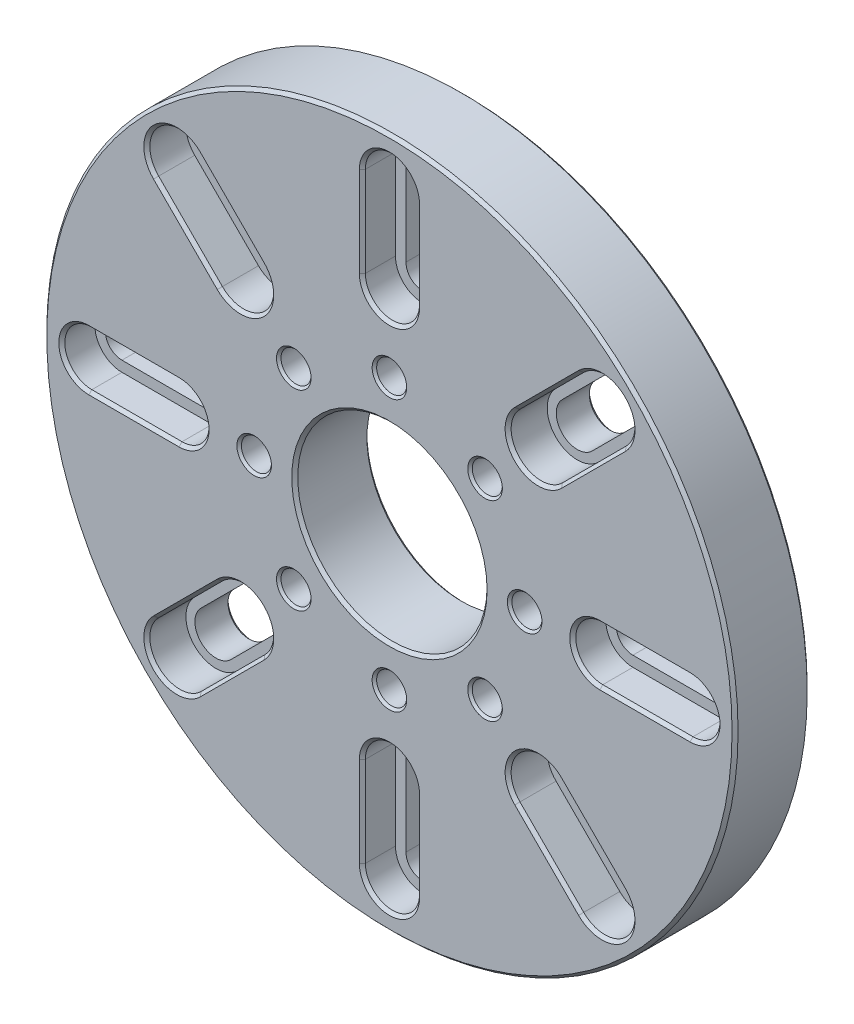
ISO-10303-21;
HEADER;
FILE_DESCRIPTION(('STEP AP214'),'2;1');
FILE_NAME('part.step','',(''),(''),'','','');
FILE_SCHEMA(('AUTOMOTIVE_DESIGN { 1 0 10303 214 1 1 1 1 }'));
ENDSEC;
DATA;
#1=APPLICATION_CONTEXT('core data for automotive mechanical design processes');
#2=APPLICATION_PROTOCOL_DEFINITION('international standard','automotive_design',2000,#1);
#3=PRODUCT_CONTEXT('',#1,'mechanical');
#4=PRODUCT('Part','Part','',(#3));
#5=PRODUCT_RELATED_PRODUCT_CATEGORY('part','',(#4));
#6=PRODUCT_DEFINITION_FORMATION('','',#4);
#7=PRODUCT_DEFINITION_CONTEXT('part definition',#1,'design');
#8=PRODUCT_DEFINITION('design','',#6,#7);
#9=PRODUCT_DEFINITION_SHAPE('','',#8);
#10=(LENGTH_UNIT() NAMED_UNIT(*) SI_UNIT(.MILLI.,.METRE.));
#11=(NAMED_UNIT(*) PLANE_ANGLE_UNIT() SI_UNIT($,.RADIAN.));
#12=(NAMED_UNIT(*) SI_UNIT($,.STERADIAN.) SOLID_ANGLE_UNIT());
#13=UNCERTAINTY_MEASURE_WITH_UNIT(LENGTH_MEASURE(1.E-05),#10,'distance_accuracy_value','');
#14=(GEOMETRIC_REPRESENTATION_CONTEXT(3) GLOBAL_UNCERTAINTY_ASSIGNED_CONTEXT((#13)) GLOBAL_UNIT_ASSIGNED_CONTEXT((#10,
#11,#12)) REPRESENTATION_CONTEXT('',''));
#15=CARTESIAN_POINT('',(0.,0.,0.));
#16=DIRECTION('',(0.,0.,1.));
#17=DIRECTION('',(1.,0.,0.));
#18=AXIS2_PLACEMENT_3D('',#15,#16,#17);
#19=CARTESIAN_POINT('',(49.4974746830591,49.4974746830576,0.));
#20=DIRECTION('',(0.,0.,1.));
#21=DIRECTION('',(1.,0.,0.));
#22=AXIS2_PLACEMENT_3D('',#19,#20,#21);
#23=CYLINDRICAL_SURFACE('',#22,7.);
#24=DIRECTION('',(0.,0.,1.));
#25=VECTOR('',#24,1.);
#26=CARTESIAN_POINT('',(54.4472221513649,44.5477272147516,0.));
#27=LINE('',#26,#25);
#28=CARTESIAN_POINT('',(54.4472221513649,44.5477272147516,0.999999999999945));
#29=VERTEX_POINT('',#28);
#30=CARTESIAN_POINT('',(54.4472221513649,44.5477272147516,12.));
#31=VERTEX_POINT('',#30);
#32=EDGE_CURVE('E723',#29,#31,#27,.T.);
#33=ORIENTED_EDGE('',*,*,#32,.F.);
#34=CARTESIAN_POINT('',(49.4974746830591,49.4974746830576,0.999999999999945));
#35=DIRECTION('',(0.,0.,1.));
#36=DIRECTION('',(1.,0.,0.));
#37=AXIS2_PLACEMENT_3D('',#34,#35,#36);
#38=CIRCLE('',#37,7.);
#39=CARTESIAN_POINT('',(44.5477272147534,54.4472221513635,0.999999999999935));
#40=VERTEX_POINT('',#39);
#41=EDGE_CURVE('E1134',#29,#40,#38,.F.);
#42=ORIENTED_EDGE('',*,*,#41,.T.);
#43=DIRECTION('',(0.,0.,1.));
#44=VECTOR('',#43,1.);
#45=CARTESIAN_POINT('',(44.5477272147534,54.4472221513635,0.));
#46=LINE('',#45,#44);
#47=CARTESIAN_POINT('',(44.5477272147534,54.4472221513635,12.));
#48=VERTEX_POINT('',#47);
#49=EDGE_CURVE('E724',#40,#48,#46,.T.);
#50=ORIENTED_EDGE('',*,*,#49,.T.);
#51=CARTESIAN_POINT('',(49.4974746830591,49.4974746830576,12.));
#52=DIRECTION('',(0.,0.,1.));
#53=DIRECTION('',(1.,0.,0.));
#54=AXIS2_PLACEMENT_3D('',#51,#52,#53);
#55=CIRCLE('',#54,7.);
#56=EDGE_CURVE('E654',#31,#48,#55,.F.);
#57=ORIENTED_EDGE('',*,*,#56,.F.);
#58=EDGE_LOOP('',(#33,#42,#50,#57));
#59=FACE_BOUND('',#58,.T.);
#60=ADVANCED_FACE('F14',(#59),#23,.F.);
#61=CARTESIAN_POINT('',(44.5477272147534,54.4472221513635,0.));
#62=DIRECTION('',(-0.707106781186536,0.707106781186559,0.));
#63=DIRECTION('',(-0.707106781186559,-0.707106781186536,0.));
#64=AXIS2_PLACEMENT_3D('',#61,#62,#63);
#65=PLANE('',#64);
#66=ORIENTED_EDGE('',*,*,#49,.F.);
#67=DIRECTION('',(0.707106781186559,0.707106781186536,0.));
#68=VECTOR('',#67,1.);
#69=CARTESIAN_POINT('',(44.5477272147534,54.4472221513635,0.999999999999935));
#70=LINE('',#69,#68);
#71=CARTESIAN_POINT('',(65.7609306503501,75.6604255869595,0.999999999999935));
#72=VERTEX_POINT('',#71);
#73=EDGE_CURVE('E1136',#40,#72,#70,.T.);
#74=ORIENTED_EDGE('',*,*,#73,.T.);
#75=DIRECTION('',(0.,0.,1.));
#76=VECTOR('',#75,1.);
#77=CARTESIAN_POINT('',(65.7609306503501,75.6604255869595,0.));
#78=LINE('',#77,#76);
#79=CARTESIAN_POINT('',(65.7609306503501,75.6604255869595,12.));
#80=VERTEX_POINT('',#79);
#81=EDGE_CURVE('E727',#72,#80,#78,.T.);
#82=ORIENTED_EDGE('',*,*,#81,.T.);
#83=DIRECTION('',(0.707106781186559,0.707106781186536,0.));
#84=VECTOR('',#83,1.);
#85=CARTESIAN_POINT('',(44.5477272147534,54.4472221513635,12.));
#86=LINE('',#85,#84);
#87=EDGE_CURVE('E651',#48,#80,#86,.T.);
#88=ORIENTED_EDGE('',*,*,#87,.F.);
#89=EDGE_LOOP('',(#66,#74,#82,#88));
#90=FACE_BOUND('',#89,.T.);
#91=ADVANCED_FACE('F1559',(#90),#65,.F.);
#92=CARTESIAN_POINT('',(70.7106781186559,70.7106781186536,0.));
#93=DIRECTION('',(0.,0.,1.));
#94=DIRECTION('',(1.,0.,0.));
#95=AXIS2_PLACEMENT_3D('',#92,#93,#94);
#96=CYLINDRICAL_SURFACE('',#95,7.);
#97=ORIENTED_EDGE('',*,*,#81,.F.);
#98=CARTESIAN_POINT('',(70.7106781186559,70.7106781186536,0.999999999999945));
#99=DIRECTION('',(0.,0.,1.));
#100=DIRECTION('',(1.,0.,0.));
#101=AXIS2_PLACEMENT_3D('',#98,#99,#100);
#102=CIRCLE('',#101,7.);
#103=CARTESIAN_POINT('',(75.6604255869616,65.7609306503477,0.99999999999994));
#104=VERTEX_POINT('',#103);
#105=EDGE_CURVE('E1129',#72,#104,#102,.F.);
#106=ORIENTED_EDGE('',*,*,#105,.T.);
#107=DIRECTION('',(0.,0.,1.));
#108=VECTOR('',#107,1.);
#109=CARTESIAN_POINT('',(75.6604255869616,65.7609306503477,0.));
#110=LINE('',#109,#108);
#111=CARTESIAN_POINT('',(75.6604255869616,65.7609306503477,12.));
#112=VERTEX_POINT('',#111);
#113=EDGE_CURVE('E729',#104,#112,#110,.T.);
#114=ORIENTED_EDGE('',*,*,#113,.T.);
#115=CARTESIAN_POINT('',(70.7106781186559,70.7106781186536,12.));
#116=DIRECTION('',(0.,0.,1.));
#117=DIRECTION('',(1.,0.,0.));
#118=AXIS2_PLACEMENT_3D('',#115,#116,#117);
#119=CIRCLE('',#118,7.);
#120=EDGE_CURVE('E645',#80,#112,#119,.F.);
#121=ORIENTED_EDGE('',*,*,#120,.F.);
#122=EDGE_LOOP('',(#97,#106,#114,#121));
#123=FACE_BOUND('',#122,.T.);
#124=ADVANCED_FACE('F1566',(#123),#96,.F.);
#125=CARTESIAN_POINT('',(54.4472221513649,44.5477272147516,0.));
#126=DIRECTION('',(0.707106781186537,-0.707106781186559,0.));
#127=DIRECTION('',(0.707106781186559,0.707106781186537,0.));
#128=AXIS2_PLACEMENT_3D('',#125,#126,#127);
#129=PLANE('',#128);
#130=ORIENTED_EDGE('',*,*,#113,.F.);
#131=DIRECTION('',(-0.707106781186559,-0.707106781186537,0.));
#132=VECTOR('',#131,1.);
#133=CARTESIAN_POINT('',(54.4472221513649,44.5477272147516,0.99999999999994));
#134=LINE('',#133,#132);
#135=EDGE_CURVE('E1132',#104,#29,#134,.T.);
#136=ORIENTED_EDGE('',*,*,#135,.T.);
#137=ORIENTED_EDGE('',*,*,#32,.T.);
#138=DIRECTION('',(-0.707106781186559,-0.707106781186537,0.));
#139=VECTOR('',#138,1.);
#140=CARTESIAN_POINT('',(54.4472221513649,44.5477272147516,12.));
#141=LINE('',#140,#139);
#142=EDGE_CURVE('E973',#112,#31,#141,.T.);
#143=ORIENTED_EDGE('',*,*,#142,.F.);
#144=EDGE_LOOP('',(#130,#136,#137,#143));
#145=FACE_BOUND('',#144,.T.);
#146=ADVANCED_FACE('F1572',(#145),#129,.F.);
#147=CARTESIAN_POINT('',(-49.4974746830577,49.4974746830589,0.));
#148=DIRECTION('',(0.,0.,1.));
#149=DIRECTION('',(1.,0.,0.));
#150=AXIS2_PLACEMENT_3D('',#147,#148,#149);
#151=CYLINDRICAL_SURFACE('',#150,7.);
#152=DIRECTION('',(0.,0.,1.));
#153=VECTOR('',#152,1.);
#154=CARTESIAN_POINT('',(-44.5477272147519,54.4472221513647,0.));
#155=LINE('',#154,#153);
#156=CARTESIAN_POINT('',(-44.5477272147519,54.4472221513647,0.999999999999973));
#157=VERTEX_POINT('',#156);
#158=CARTESIAN_POINT('',(-44.5477272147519,54.4472221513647,12.));
#159=VERTEX_POINT('',#158);
#160=EDGE_CURVE('E726',#157,#159,#155,.T.);
#161=ORIENTED_EDGE('',*,*,#160,.F.);
#162=CARTESIAN_POINT('',(-49.4974746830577,49.4974746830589,0.999999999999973));
#163=DIRECTION('',(0.,0.,1.));
#164=DIRECTION('',(1.,0.,0.));
#165=AXIS2_PLACEMENT_3D('',#162,#163,#164);
#166=CIRCLE('',#165,7.);
#167=CARTESIAN_POINT('',(-54.4472221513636,44.5477272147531,0.999999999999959));
#168=VERTEX_POINT('',#167);
#169=EDGE_CURVE('E1125',#157,#168,#166,.F.);
#170=ORIENTED_EDGE('',*,*,#169,.T.);
#171=DIRECTION('',(0.,0.,1.));
#172=VECTOR('',#171,1.);
#173=CARTESIAN_POINT('',(-54.4472221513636,44.5477272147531,0.));
#174=LINE('',#173,#172);
#175=CARTESIAN_POINT('',(-54.4472221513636,44.5477272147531,12.));
#176=VERTEX_POINT('',#175);
#177=EDGE_CURVE('E732',#168,#176,#174,.T.);
#178=ORIENTED_EDGE('',*,*,#177,.T.);
#179=CARTESIAN_POINT('',(-49.4974746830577,49.4974746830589,12.));
#180=DIRECTION('',(0.,0.,1.));
#181=DIRECTION('',(1.,0.,0.));
#182=AXIS2_PLACEMENT_3D('',#179,#180,#181);
#183=CIRCLE('',#182,7.);
#184=EDGE_CURVE('E687',#159,#176,#183,.F.);
#185=ORIENTED_EDGE('',*,*,#184,.F.);
#186=EDGE_LOOP('',(#161,#170,#178,#185));
#187=FACE_BOUND('',#186,.T.);
#188=ADVANCED_FACE('F1578',(#187),#151,.F.);
#189=CARTESIAN_POINT('',(-54.4472221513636,44.5477272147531,0.));
#190=DIRECTION('',(-0.707106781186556,-0.707106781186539,0.));
#191=DIRECTION('',(0.707106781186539,-0.707106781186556,0.));
#192=AXIS2_PLACEMENT_3D('',#189,#190,#191);
#193=PLANE('',#192);
#194=ORIENTED_EDGE('',*,*,#177,.F.);
#195=DIRECTION('',(-0.707106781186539,0.707106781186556,0.));
#196=VECTOR('',#195,1.);
#197=CARTESIAN_POINT('',(-54.4472221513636,44.5477272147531,0.999999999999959));
#198=LINE('',#197,#196);
#199=CARTESIAN_POINT('',(-75.6604255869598,65.7609306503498,0.999999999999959));
#200=VERTEX_POINT('',#199);
#201=EDGE_CURVE('E1127',#168,#200,#198,.T.);
#202=ORIENTED_EDGE('',*,*,#201,.T.);
#203=DIRECTION('',(0.,0.,1.));
#204=VECTOR('',#203,1.);
#205=CARTESIAN_POINT('',(-75.6604255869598,65.7609306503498,0.));
#206=LINE('',#205,#204);
#207=CARTESIAN_POINT('',(-75.6604255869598,65.7609306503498,12.));
#208=VERTEX_POINT('',#207);
#209=EDGE_CURVE('E735',#200,#208,#206,.T.);
#210=ORIENTED_EDGE('',*,*,#209,.T.);
#211=DIRECTION('',(-0.707106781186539,0.707106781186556,0.));
#212=VECTOR('',#211,1.);
#213=CARTESIAN_POINT('',(-54.4472221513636,44.5477272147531,12.));
#214=LINE('',#213,#212);
#215=EDGE_CURVE('E684',#176,#208,#214,.T.);
#216=ORIENTED_EDGE('',*,*,#215,.F.);
#217=EDGE_LOOP('',(#194,#202,#210,#216));
#218=FACE_BOUND('',#217,.T.);
#219=ADVANCED_FACE('F1574',(#218),#193,.F.);
#220=CARTESIAN_POINT('',(-70.7106781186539,70.7106781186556,0.));
#221=DIRECTION('',(0.,0.,1.));
#222=DIRECTION('',(1.,0.,0.));
#223=AXIS2_PLACEMENT_3D('',#220,#221,#222);
#224=CYLINDRICAL_SURFACE('',#223,7.);
#225=ORIENTED_EDGE('',*,*,#209,.F.);
#226=CARTESIAN_POINT('',(-70.7106781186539,70.7106781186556,0.999999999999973));
#227=DIRECTION('',(0.,0.,1.));
#228=DIRECTION('',(1.,0.,0.));
#229=AXIS2_PLACEMENT_3D('',#226,#227,#228);
#230=CIRCLE('',#229,7.);
#231=CARTESIAN_POINT('',(-65.760930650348,75.6604255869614,0.999999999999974));
#232=VERTEX_POINT('',#231);
#233=EDGE_CURVE('E1120',#200,#232,#230,.F.);
#234=ORIENTED_EDGE('',*,*,#233,.T.);
#235=DIRECTION('',(0.,0.,1.));
#236=VECTOR('',#235,1.);
#237=CARTESIAN_POINT('',(-65.760930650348,75.6604255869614,0.));
#238=LINE('',#237,#236);
#239=CARTESIAN_POINT('',(-65.760930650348,75.6604255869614,12.));
#240=VERTEX_POINT('',#239);
#241=EDGE_CURVE('E737',#232,#240,#238,.T.);
#242=ORIENTED_EDGE('',*,*,#241,.T.);
#243=CARTESIAN_POINT('',(-70.7106781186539,70.7106781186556,12.));
#244=DIRECTION('',(0.,0.,1.));
#245=DIRECTION('',(1.,0.,0.));
#246=AXIS2_PLACEMENT_3D('',#243,#244,#245);
#247=CIRCLE('',#246,7.);
#248=EDGE_CURVE('E673',#208,#240,#247,.F.);
#249=ORIENTED_EDGE('',*,*,#248,.F.);
#250=EDGE_LOOP('',(#225,#234,#242,#249));
#251=FACE_BOUND('',#250,.T.);
#252=ADVANCED_FACE('F1577',(#251),#224,.F.);
#253=CARTESIAN_POINT('',(-44.5477272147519,54.4472221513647,0.));
#254=DIRECTION('',(0.707106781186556,0.707106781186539,0.));
#255=DIRECTION('',(-0.707106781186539,0.707106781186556,0.));
#256=AXIS2_PLACEMENT_3D('',#253,#254,#255);
#257=PLANE('',#256);
#258=ORIENTED_EDGE('',*,*,#241,.F.);
#259=DIRECTION('',(0.707106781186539,-0.707106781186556,0.));
#260=VECTOR('',#259,1.);
#261=CARTESIAN_POINT('',(-44.5477272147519,54.4472221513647,0.999999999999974));
#262=LINE('',#261,#260);
#263=EDGE_CURVE('E1123',#232,#157,#262,.T.);
#264=ORIENTED_EDGE('',*,*,#263,.T.);
#265=ORIENTED_EDGE('',*,*,#160,.T.);
#266=DIRECTION('',(0.707106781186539,-0.707106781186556,0.));
#267=VECTOR('',#266,1.);
#268=CARTESIAN_POINT('',(-44.5477272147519,54.4472221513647,12.));
#269=LINE('',#268,#267);
#270=EDGE_CURVE('E970',#240,#159,#269,.T.);
#271=ORIENTED_EDGE('',*,*,#270,.F.);
#272=EDGE_LOOP('',(#258,#264,#265,#271));
#273=FACE_BOUND('',#272,.T.);
#274=ADVANCED_FACE('F1582',(#273),#257,.F.);
#275=CARTESIAN_POINT('',(-49.4974746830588,-49.4974746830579,0.));
#276=DIRECTION('',(0.,0.,1.));
#277=DIRECTION('',(1.,0.,0.));
#278=AXIS2_PLACEMENT_3D('',#275,#276,#277);
#279=CYLINDRICAL_SURFACE('',#278,7.);
#280=DIRECTION('',(0.,0.,1.));
#281=VECTOR('',#280,1.);
#282=CARTESIAN_POINT('',(-54.4472221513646,-44.547727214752,0.));
#283=LINE('',#282,#281);
#284=CARTESIAN_POINT('',(-54.4472221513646,-44.547727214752,0.999999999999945));
#285=VERTEX_POINT('',#284);
#286=CARTESIAN_POINT('',(-54.4472221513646,-44.547727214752,12.));
#287=VERTEX_POINT('',#286);
#288=EDGE_CURVE('E734',#285,#287,#283,.T.);
#289=ORIENTED_EDGE('',*,*,#288,.F.);
#290=CARTESIAN_POINT('',(-49.4974746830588,-49.4974746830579,0.999999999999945));
#291=DIRECTION('',(0.,0.,1.));
#292=DIRECTION('',(1.,0.,0.));
#293=AXIS2_PLACEMENT_3D('',#290,#291,#292);
#294=CIRCLE('',#293,7.);
#295=CARTESIAN_POINT('',(-44.547727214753,-54.4472221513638,0.999999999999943));
#296=VERTEX_POINT('',#295);
#297=EDGE_CURVE('E1116',#285,#296,#294,.F.);
#298=ORIENTED_EDGE('',*,*,#297,.T.);
#299=DIRECTION('',(0.,0.,1.));
#300=VECTOR('',#299,1.);
#301=CARTESIAN_POINT('',(-44.547727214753,-54.4472221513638,0.));
#302=LINE('',#301,#300);
#303=CARTESIAN_POINT('',(-44.547727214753,-54.4472221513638,12.));
#304=VERTEX_POINT('',#303);
#305=EDGE_CURVE('E740',#296,#304,#302,.T.);
#306=ORIENTED_EDGE('',*,*,#305,.T.);
#307=CARTESIAN_POINT('',(-49.4974746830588,-49.4974746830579,12.));
#308=DIRECTION('',(0.,0.,1.));
#309=DIRECTION('',(1.,0.,0.));
#310=AXIS2_PLACEMENT_3D('',#307,#308,#309);
#311=CIRCLE('',#310,7.);
#312=EDGE_CURVE('E720',#287,#304,#311,.F.);
#313=ORIENTED_EDGE('',*,*,#312,.F.);
#314=EDGE_LOOP('',(#289,#298,#306,#313));
#315=FACE_BOUND('',#314,.T.);
#316=ADVANCED_FACE('F1586',(#315),#279,.F.);
#317=CARTESIAN_POINT('',(-44.547727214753,-54.4472221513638,0.));
#318=DIRECTION('',(0.707106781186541,-0.707106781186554,0.));
#319=DIRECTION('',(0.707106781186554,0.707106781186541,0.));
#320=AXIS2_PLACEMENT_3D('',#317,#318,#319);
#321=PLANE('',#320);
#322=ORIENTED_EDGE('',*,*,#305,.F.);
#323=DIRECTION('',(-0.707106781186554,-0.707106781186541,0.));
#324=VECTOR('',#323,1.);
#325=CARTESIAN_POINT('',(-44.547727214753,-54.4472221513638,0.999999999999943));
#326=LINE('',#325,#324);
#327=CARTESIAN_POINT('',(-65.7609306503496,-75.66042558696,0.999999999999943));
#328=VERTEX_POINT('',#327);
#329=EDGE_CURVE('E1118',#296,#328,#326,.T.);
#330=ORIENTED_EDGE('',*,*,#329,.T.);
#331=DIRECTION('',(0.,0.,1.));
#332=VECTOR('',#331,1.);
#333=CARTESIAN_POINT('',(-65.7609306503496,-75.66042558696,0.));
#334=LINE('',#333,#332);
#335=CARTESIAN_POINT('',(-65.7609306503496,-75.66042558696,12.));
#336=VERTEX_POINT('',#335);
#337=EDGE_CURVE('E743',#328,#336,#334,.T.);
#338=ORIENTED_EDGE('',*,*,#337,.T.);
#339=DIRECTION('',(-0.707106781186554,-0.707106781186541,0.));
#340=VECTOR('',#339,1.);
#341=CARTESIAN_POINT('',(-44.547727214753,-54.4472221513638,12.));
#342=LINE('',#341,#340);
#343=EDGE_CURVE('E717',#304,#336,#342,.T.);
#344=ORIENTED_EDGE('',*,*,#343,.F.);
#345=EDGE_LOOP('',(#322,#330,#338,#344));
#346=FACE_BOUND('',#345,.T.);
#347=ADVANCED_FACE('F1591',(#346),#321,.F.);
#348=CARTESIAN_POINT('',(-70.7106781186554,-70.7106781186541,0.));
#349=DIRECTION('',(0.,0.,1.));
#350=DIRECTION('',(1.,0.,0.));
#351=AXIS2_PLACEMENT_3D('',#348,#349,#350);
#352=CYLINDRICAL_SURFACE('',#351,7.);
#353=ORIENTED_EDGE('',*,*,#337,.F.);
#354=CARTESIAN_POINT('',(-70.7106781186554,-70.7106781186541,0.999999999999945));
#355=DIRECTION('',(0.,0.,1.));
#356=DIRECTION('',(1.,0.,0.));
#357=AXIS2_PLACEMENT_3D('',#354,#355,#356);
#358=CIRCLE('',#357,7.);
#359=CARTESIAN_POINT('',(-75.6604255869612,-65.7609306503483,0.999999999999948));
#360=VERTEX_POINT('',#359);
#361=EDGE_CURVE('E1111',#328,#360,#358,.F.);
#362=ORIENTED_EDGE('',*,*,#361,.T.);
#363=DIRECTION('',(0.,0.,1.));
#364=VECTOR('',#363,1.);
#365=CARTESIAN_POINT('',(-75.6604255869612,-65.7609306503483,0.));
#366=LINE('',#365,#364);
#367=CARTESIAN_POINT('',(-75.6604255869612,-65.7609306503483,12.));
#368=VERTEX_POINT('',#367);
#369=EDGE_CURVE('E745',#360,#368,#366,.T.);
#370=ORIENTED_EDGE('',*,*,#369,.T.);
#371=CARTESIAN_POINT('',(-70.7106781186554,-70.7106781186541,12.));
#372=DIRECTION('',(0.,0.,1.));
#373=DIRECTION('',(1.,0.,0.));
#374=AXIS2_PLACEMENT_3D('',#371,#372,#373);
#375=CIRCLE('',#374,7.);
#376=EDGE_CURVE('E706',#336,#368,#375,.F.);
#377=ORIENTED_EDGE('',*,*,#376,.F.);
#378=EDGE_LOOP('',(#353,#362,#370,#377));
#379=FACE_BOUND('',#378,.T.);
#380=ADVANCED_FACE('F1594',(#379),#352,.F.);
#381=CARTESIAN_POINT('',(-54.4472221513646,-44.547727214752,0.));
#382=DIRECTION('',(-0.707106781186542,0.707106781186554,0.));
#383=DIRECTION('',(-0.707106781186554,-0.707106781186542,0.));
#384=AXIS2_PLACEMENT_3D('',#381,#382,#383);
#385=PLANE('',#384);
#386=ORIENTED_EDGE('',*,*,#369,.F.);
#387=DIRECTION('',(0.707106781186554,0.707106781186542,0.));
#388=VECTOR('',#387,1.);
#389=CARTESIAN_POINT('',(-54.4472221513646,-44.547727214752,0.999999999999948));
#390=LINE('',#389,#388);
#391=EDGE_CURVE('E1114',#360,#285,#390,.T.);
#392=ORIENTED_EDGE('',*,*,#391,.T.);
#393=ORIENTED_EDGE('',*,*,#288,.T.);
#394=DIRECTION('',(0.707106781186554,0.707106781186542,0.));
#395=VECTOR('',#394,1.);
#396=CARTESIAN_POINT('',(-54.4472221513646,-44.547727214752,12.));
#397=LINE('',#396,#395);
#398=EDGE_CURVE('E967',#368,#287,#397,.T.);
#399=ORIENTED_EDGE('',*,*,#398,.F.);
#400=EDGE_LOOP('',(#386,#392,#393,#399));
#401=FACE_BOUND('',#400,.T.);
#402=ADVANCED_FACE('F1598',(#401),#385,.F.);
#403=CARTESIAN_POINT('',(70.,-7.31430458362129E-13,0.));
#404=DIRECTION('',(0.,0.,1.));
#405=DIRECTION('',(1.,0.,0.));
#406=AXIS2_PLACEMENT_3D('',#403,#404,#405);
#407=CYLINDRICAL_SURFACE('',#406,5.5);
#408=DIRECTION('',(0.,0.,1.));
#409=VECTOR('',#408,1.);
#410=CARTESIAN_POINT('',(70.,-5.50000000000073,0.));
#411=LINE('',#410,#409);
#412=CARTESIAN_POINT('',(70.,-5.50000000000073,1.00000000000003));
#413=VERTEX_POINT('',#412);
#414=CARTESIAN_POINT('',(70.,-5.50000000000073,14.));
#415=VERTEX_POINT('',#414);
#416=EDGE_CURVE('E846',#413,#415,#411,.T.);
#417=ORIENTED_EDGE('',*,*,#416,.F.);
#418=CARTESIAN_POINT('',(70.,-7.31430458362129E-13,1.00000000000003));
#419=DIRECTION('',(0.,0.,1.));
#420=DIRECTION('',(1.,0.,0.));
#421=AXIS2_PLACEMENT_3D('',#418,#419,#420);
#422=CIRCLE('',#421,5.5);
#423=CARTESIAN_POINT('',(70.,5.49999999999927,1.00000000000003));
#424=VERTEX_POINT('',#423);
#425=EDGE_CURVE('E1107',#413,#424,#422,.F.);
#426=ORIENTED_EDGE('',*,*,#425,.T.);
#427=DIRECTION('',(0.,0.,1.));
#428=VECTOR('',#427,1.);
#429=CARTESIAN_POINT('',(70.,5.49999999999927,0.));
#430=LINE('',#429,#428);
#431=CARTESIAN_POINT('',(70.,5.49999999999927,14.));
#432=VERTEX_POINT('',#431);
#433=EDGE_CURVE('E847',#424,#432,#430,.T.);
#434=ORIENTED_EDGE('',*,*,#433,.T.);
#435=CARTESIAN_POINT('',(70.,-7.31430458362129E-13,14.));
#436=DIRECTION('',(0.,0.,1.));
#437=DIRECTION('',(1.,0.,0.));
#438=AXIS2_PLACEMENT_3D('',#435,#436,#437);
#439=CIRCLE('',#438,5.5);
#440=EDGE_CURVE('E777',#415,#432,#439,.F.);
#441=ORIENTED_EDGE('',*,*,#440,.F.);
#442=EDGE_LOOP('',(#417,#426,#434,#441));
#443=FACE_BOUND('',#442,.T.);
#444=ADVANCED_FACE('F1602',(#443),#407,.F.);
#445=CARTESIAN_POINT('',(70.,5.49999999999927,0.));
#446=DIRECTION('',(0.,1.,0.));
#447=DIRECTION('',(-1.,0.,0.));
#448=AXIS2_PLACEMENT_3D('',#445,#446,#447);
#449=PLANE('',#448);
#450=ORIENTED_EDGE('',*,*,#433,.F.);
#451=DIRECTION('',(1.,0.,0.));
#452=VECTOR('',#451,1.);
#453=CARTESIAN_POINT('',(70.,5.49999999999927,1.00000000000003));
#454=LINE('',#453,#452);
#455=CARTESIAN_POINT('',(100.,5.49999999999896,1.00000000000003));
#456=VERTEX_POINT('',#455);
#457=EDGE_CURVE('E1109',#424,#456,#454,.T.);
#458=ORIENTED_EDGE('',*,*,#457,.T.);
#459=DIRECTION('',(0.,0.,1.));
#460=VECTOR('',#459,1.);
#461=CARTESIAN_POINT('',(100.,5.49999999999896,0.));
#462=LINE('',#461,#460);
#463=CARTESIAN_POINT('',(100.,5.49999999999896,14.));
#464=VERTEX_POINT('',#463);
#465=EDGE_CURVE('E850',#456,#464,#462,.T.);
#466=ORIENTED_EDGE('',*,*,#465,.T.);
#467=DIRECTION('',(1.,0.,0.));
#468=VECTOR('',#467,1.);
#469=CARTESIAN_POINT('',(70.,5.49999999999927,14.));
#470=LINE('',#469,#468);
#471=EDGE_CURVE('E774',#432,#464,#470,.T.);
#472=ORIENTED_EDGE('',*,*,#471,.F.);
#473=EDGE_LOOP('',(#450,#458,#466,#472));
#474=FACE_BOUND('',#473,.T.);
#475=ADVANCED_FACE('F1669',(#474),#449,.F.);
#476=CARTESIAN_POINT('',(100.,-1.04377106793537E-12,0.));
#477=DIRECTION('',(0.,0.,1.));
#478=DIRECTION('',(1.,0.,0.));
#479=AXIS2_PLACEMENT_3D('',#476,#477,#478);
#480=CYLINDRICAL_SURFACE('',#479,5.5);
#481=ORIENTED_EDGE('',*,*,#465,.F.);
#482=CARTESIAN_POINT('',(100.,-1.04377106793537E-12,1.00000000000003));
#483=DIRECTION('',(0.,0.,1.));
#484=DIRECTION('',(1.,0.,0.));
#485=AXIS2_PLACEMENT_3D('',#482,#483,#484);
#486=CIRCLE('',#485,5.5);
#487=CARTESIAN_POINT('',(100.,-5.50000000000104,1.00000000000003));
#488=VERTEX_POINT('',#487);
#489=EDGE_CURVE('E1102',#456,#488,#486,.F.);
#490=ORIENTED_EDGE('',*,*,#489,.T.);
#491=DIRECTION('',(0.,0.,1.));
#492=VECTOR('',#491,1.);
#493=CARTESIAN_POINT('',(100.,-5.50000000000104,0.));
#494=LINE('',#493,#492);
#495=CARTESIAN_POINT('',(100.,-5.50000000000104,14.));
#496=VERTEX_POINT('',#495);
#497=EDGE_CURVE('E852',#488,#496,#494,.T.);
#498=ORIENTED_EDGE('',*,*,#497,.T.);
#499=CARTESIAN_POINT('',(100.,-1.04377106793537E-12,14.));
#500=DIRECTION('',(0.,0.,1.));
#501=DIRECTION('',(1.,0.,0.));
#502=AXIS2_PLACEMENT_3D('',#499,#500,#501);
#503=CIRCLE('',#502,5.5);
#504=EDGE_CURVE('E763',#464,#496,#503,.F.);
#505=ORIENTED_EDGE('',*,*,#504,.F.);
#506=EDGE_LOOP('',(#481,#490,#498,#505));
#507=FACE_BOUND('',#506,.T.);
#508=ADVANCED_FACE('F1672',(#507),#480,.F.);
#509=CARTESIAN_POINT('',(70.,-5.50000000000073,0.));
#510=DIRECTION('',(0.,-1.,0.));
#511=DIRECTION('',(1.,0.,0.));
#512=AXIS2_PLACEMENT_3D('',#509,#510,#511);
#513=PLANE('',#512);
#514=ORIENTED_EDGE('',*,*,#497,.F.);
#515=DIRECTION('',(-1.,0.,0.));
#516=VECTOR('',#515,1.);
#517=CARTESIAN_POINT('',(70.,-5.50000000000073,1.00000000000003));
#518=LINE('',#517,#516);
#519=EDGE_CURVE('E1105',#488,#413,#518,.T.);
#520=ORIENTED_EDGE('',*,*,#519,.T.);
#521=ORIENTED_EDGE('',*,*,#416,.T.);
#522=DIRECTION('',(-1.,0.,0.));
#523=VECTOR('',#522,1.);
#524=CARTESIAN_POINT('',(70.,-5.50000000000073,14.));
#525=LINE('',#524,#523);
#526=EDGE_CURVE('E964',#496,#415,#525,.T.);
#527=ORIENTED_EDGE('',*,*,#526,.F.);
#528=EDGE_LOOP('',(#514,#520,#521,#527));
#529=FACE_BOUND('',#528,.T.);
#530=ADVANCED_FACE('F1676',(#529),#513,.F.);
#531=CARTESIAN_POINT('',(4.87026623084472E-13,70.,0.));
#532=DIRECTION('',(0.,0.,1.));
#533=DIRECTION('',(1.,0.,0.));
#534=AXIS2_PLACEMENT_3D('',#531,#532,#533);
#535=CYLINDRICAL_SURFACE('',#534,5.5);
#536=DIRECTION('',(0.,0.,1.));
#537=VECTOR('',#536,1.);
#538=CARTESIAN_POINT('',(5.50000000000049,70.,0.));
#539=LINE('',#538,#537);
#540=CARTESIAN_POINT('',(5.50000000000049,70.,1.00000000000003));
#541=VERTEX_POINT('',#540);
#542=CARTESIAN_POINT('',(5.50000000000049,70.,14.));
#543=VERTEX_POINT('',#542);
#544=EDGE_CURVE('E849',#541,#543,#539,.T.);
#545=ORIENTED_EDGE('',*,*,#544,.F.);
#546=CARTESIAN_POINT('',(4.87026623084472E-13,70.,1.00000000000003));
#547=DIRECTION('',(0.,0.,1.));
#548=DIRECTION('',(1.,0.,0.));
#549=AXIS2_PLACEMENT_3D('',#546,#547,#548);
#550=CIRCLE('',#549,5.5);
#551=CARTESIAN_POINT('',(-5.49999999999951,70.,1.00000000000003));
#552=VERTEX_POINT('',#551);
#553=EDGE_CURVE('E1098',#541,#552,#550,.F.);
#554=ORIENTED_EDGE('',*,*,#553,.T.);
#555=DIRECTION('',(0.,0.,1.));
#556=VECTOR('',#555,1.);
#557=CARTESIAN_POINT('',(-5.49999999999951,70.,0.));
#558=LINE('',#557,#556);
#559=CARTESIAN_POINT('',(-5.49999999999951,70.,14.));
#560=VERTEX_POINT('',#559);
#561=EDGE_CURVE('E855',#552,#560,#558,.T.);
#562=ORIENTED_EDGE('',*,*,#561,.T.);
#563=CARTESIAN_POINT('',(4.87026623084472E-13,70.,14.));
#564=DIRECTION('',(0.,0.,1.));
#565=DIRECTION('',(1.,0.,0.));
#566=AXIS2_PLACEMENT_3D('',#563,#564,#565);
#567=CIRCLE('',#566,5.5);
#568=EDGE_CURVE('E810',#543,#560,#567,.F.);
#569=ORIENTED_EDGE('',*,*,#568,.F.);
#570=EDGE_LOOP('',(#545,#554,#562,#569));
#571=FACE_BOUND('',#570,.T.);
#572=ADVANCED_FACE('F1680',(#571),#535,.F.);
#573=CARTESIAN_POINT('',(-5.49999999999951,70.,0.));
#574=DIRECTION('',(-1.,0.,0.));
#575=DIRECTION('',(0.,-1.,0.));
#576=AXIS2_PLACEMENT_3D('',#573,#574,#575);
#577=PLANE('',#576);
#578=ORIENTED_EDGE('',*,*,#561,.F.);
#579=DIRECTION('',(0.,1.,0.));
#580=VECTOR('',#579,1.);
#581=CARTESIAN_POINT('',(-5.49999999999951,70.,1.00000000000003));
#582=LINE('',#581,#580);
#583=CARTESIAN_POINT('',(-5.4999999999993,100.,1.00000000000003));
#584=VERTEX_POINT('',#583);
#585=EDGE_CURVE('E1100',#552,#584,#582,.T.);
#586=ORIENTED_EDGE('',*,*,#585,.T.);
#587=DIRECTION('',(0.,0.,1.));
#588=VECTOR('',#587,1.);
#589=CARTESIAN_POINT('',(-5.4999999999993,100.,0.));
#590=LINE('',#589,#588);
#591=CARTESIAN_POINT('',(-5.4999999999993,100.,14.));
#592=VERTEX_POINT('',#591);
#593=EDGE_CURVE('E858',#584,#592,#590,.T.);
#594=ORIENTED_EDGE('',*,*,#593,.T.);
#595=DIRECTION('',(0.,1.,0.));
#596=VECTOR('',#595,1.);
#597=CARTESIAN_POINT('',(-5.49999999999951,70.,14.));
#598=LINE('',#597,#596);
#599=EDGE_CURVE('E807',#560,#592,#598,.T.);
#600=ORIENTED_EDGE('',*,*,#599,.F.);
#601=EDGE_LOOP('',(#578,#586,#594,#600));
#602=FACE_BOUND('',#601,.T.);
#603=ADVANCED_FACE('F1685',(#602),#577,.F.);
#604=CARTESIAN_POINT('',(6.94622731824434E-13,100.,0.));
#605=DIRECTION('',(0.,0.,1.));
#606=DIRECTION('',(1.,0.,0.));
#607=AXIS2_PLACEMENT_3D('',#604,#605,#606);
#608=CYLINDRICAL_SURFACE('',#607,5.5);
#609=ORIENTED_EDGE('',*,*,#593,.F.);
#610=CARTESIAN_POINT('',(6.94622731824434E-13,100.,1.00000000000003));
#611=DIRECTION('',(0.,0.,1.));
#612=DIRECTION('',(1.,0.,0.));
#613=AXIS2_PLACEMENT_3D('',#610,#611,#612);
#614=CIRCLE('',#613,5.5);
#615=CARTESIAN_POINT('',(5.50000000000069,100.,1.00000000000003));
#616=VERTEX_POINT('',#615);
#617=EDGE_CURVE('E1093',#584,#616,#614,.F.);
#618=ORIENTED_EDGE('',*,*,#617,.T.);
#619=DIRECTION('',(0.,0.,1.));
#620=VECTOR('',#619,1.);
#621=CARTESIAN_POINT('',(5.50000000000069,100.,0.));
#622=LINE('',#621,#620);
#623=CARTESIAN_POINT('',(5.50000000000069,100.,14.));
#624=VERTEX_POINT('',#623);
#625=EDGE_CURVE('E860',#616,#624,#622,.T.);
#626=ORIENTED_EDGE('',*,*,#625,.T.);
#627=CARTESIAN_POINT('',(6.94622731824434E-13,100.,14.));
#628=DIRECTION('',(0.,0.,1.));
#629=DIRECTION('',(1.,0.,0.));
#630=AXIS2_PLACEMENT_3D('',#627,#628,#629);
#631=CIRCLE('',#630,5.5);
#632=EDGE_CURVE('E796',#592,#624,#631,.F.);
#633=ORIENTED_EDGE('',*,*,#632,.F.);
#634=EDGE_LOOP('',(#609,#618,#626,#633));
#635=FACE_BOUND('',#634,.T.);
#636=ADVANCED_FACE('F1688',(#635),#608,.F.);
#637=CARTESIAN_POINT('',(5.50000000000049,70.,0.));
#638=DIRECTION('',(1.,0.,0.));
#639=DIRECTION('',(0.,1.,0.));
#640=AXIS2_PLACEMENT_3D('',#637,#638,#639);
#641=PLANE('',#640);
#642=ORIENTED_EDGE('',*,*,#625,.F.);
#643=DIRECTION('',(0.,-1.,0.));
#644=VECTOR('',#643,1.);
#645=CARTESIAN_POINT('',(5.50000000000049,70.,1.00000000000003));
#646=LINE('',#645,#644);
#647=EDGE_CURVE('E1096',#616,#541,#646,.T.);
#648=ORIENTED_EDGE('',*,*,#647,.T.);
#649=ORIENTED_EDGE('',*,*,#544,.T.);
#650=DIRECTION('',(0.,-1.,0.));
#651=VECTOR('',#650,1.);
#652=CARTESIAN_POINT('',(5.50000000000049,70.,14.));
#653=LINE('',#652,#651);
#654=EDGE_CURVE('E961',#624,#543,#653,.T.);
#655=ORIENTED_EDGE('',*,*,#654,.F.);
#656=EDGE_LOOP('',(#642,#648,#649,#655));
#657=FACE_BOUND('',#656,.T.);
#658=ADVANCED_FACE('F1692',(#657),#641,.F.);
#659=CARTESIAN_POINT('',(-70.,2.42622787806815E-13,0.));
#660=DIRECTION('',(0.,0.,1.));
#661=DIRECTION('',(1.,0.,0.));
#662=AXIS2_PLACEMENT_3D('',#659,#660,#661);
#663=CYLINDRICAL_SURFACE('',#662,5.5);
#664=DIRECTION('',(0.,0.,1.));
#665=VECTOR('',#664,1.);
#666=CARTESIAN_POINT('',(-70.,5.50000000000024,0.));
#667=LINE('',#666,#665);
#668=CARTESIAN_POINT('',(-70.,5.50000000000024,1.));
#669=VERTEX_POINT('',#668);
#670=CARTESIAN_POINT('',(-70.,5.50000000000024,14.));
#671=VERTEX_POINT('',#670);
#672=EDGE_CURVE('E857',#669,#671,#667,.T.);
#673=ORIENTED_EDGE('',*,*,#672,.F.);
#674=CARTESIAN_POINT('',(-70.,2.42622787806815E-13,1.));
#675=DIRECTION('',(0.,0.,1.));
#676=DIRECTION('',(1.,0.,0.));
#677=AXIS2_PLACEMENT_3D('',#674,#675,#676);
#678=CIRCLE('',#677,5.5);
#679=CARTESIAN_POINT('',(-70.,-5.49999999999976,1.));
#680=VERTEX_POINT('',#679);
#681=EDGE_CURVE('E1089',#669,#680,#678,.F.);
#682=ORIENTED_EDGE('',*,*,#681,.T.);
#683=DIRECTION('',(0.,0.,1.));
#684=VECTOR('',#683,1.);
#685=CARTESIAN_POINT('',(-70.,-5.49999999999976,0.));
#686=LINE('',#685,#684);
#687=CARTESIAN_POINT('',(-70.,-5.49999999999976,14.));
#688=VERTEX_POINT('',#687);
#689=EDGE_CURVE('E863',#680,#688,#686,.T.);
#690=ORIENTED_EDGE('',*,*,#689,.T.);
#691=CARTESIAN_POINT('',(-70.,2.42622787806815E-13,14.));
#692=DIRECTION('',(0.,0.,1.));
#693=DIRECTION('',(1.,0.,0.));
#694=AXIS2_PLACEMENT_3D('',#691,#692,#693);
#695=CIRCLE('',#694,5.5);
#696=EDGE_CURVE('E843',#671,#688,#695,.F.);
#697=ORIENTED_EDGE('',*,*,#696,.F.);
#698=EDGE_LOOP('',(#673,#682,#690,#697));
#699=FACE_BOUND('',#698,.T.);
#700=ADVANCED_FACE('F1696',(#699),#663,.F.);
#701=CARTESIAN_POINT('',(-70.,-5.49999999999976,0.));
#702=DIRECTION('',(0.,-1.,0.));
#703=DIRECTION('',(1.,0.,0.));
#704=AXIS2_PLACEMENT_3D('',#701,#702,#703);
#705=PLANE('',#704);
#706=ORIENTED_EDGE('',*,*,#689,.F.);
#707=DIRECTION('',(-1.,0.,0.));
#708=VECTOR('',#707,1.);
#709=CARTESIAN_POINT('',(-70.,-5.49999999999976,1.));
#710=LINE('',#709,#708);
#711=CARTESIAN_POINT('',(-100.,-5.49999999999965,1.));
#712=VERTEX_POINT('',#711);
#713=EDGE_CURVE('E1091',#680,#712,#710,.T.);
#714=ORIENTED_EDGE('',*,*,#713,.T.);
#715=DIRECTION('',(0.,0.,1.));
#716=VECTOR('',#715,1.);
#717=CARTESIAN_POINT('',(-100.,-5.49999999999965,0.));
#718=LINE('',#717,#716);
#719=CARTESIAN_POINT('',(-100.,-5.49999999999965,14.));
#720=VERTEX_POINT('',#719);
#721=EDGE_CURVE('E866',#712,#720,#718,.T.);
#722=ORIENTED_EDGE('',*,*,#721,.T.);
#723=DIRECTION('',(-1.,0.,0.));
#724=VECTOR('',#723,1.);
#725=CARTESIAN_POINT('',(-70.,-5.49999999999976,14.));
#726=LINE('',#725,#724);
#727=EDGE_CURVE('E840',#688,#720,#726,.T.);
#728=ORIENTED_EDGE('',*,*,#727,.F.);
#729=EDGE_LOOP('',(#706,#714,#722,#728));
#730=FACE_BOUND('',#729,.T.);
#731=ADVANCED_FACE('F1701',(#730),#705,.F.);
#732=CARTESIAN_POINT('',(-100.,3.45474395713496E-13,0.));
#733=DIRECTION('',(0.,0.,1.));
#734=DIRECTION('',(1.,0.,0.));
#735=AXIS2_PLACEMENT_3D('',#732,#733,#734);
#736=CYLINDRICAL_SURFACE('',#735,5.5);
#737=ORIENTED_EDGE('',*,*,#721,.F.);
#738=CARTESIAN_POINT('',(-100.,3.45474395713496E-13,1.));
#739=DIRECTION('',(0.,0.,1.));
#740=DIRECTION('',(1.,0.,0.));
#741=AXIS2_PLACEMENT_3D('',#738,#739,#740);
#742=CIRCLE('',#741,5.5);
#743=CARTESIAN_POINT('',(-100.,5.50000000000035,1.));
#744=VERTEX_POINT('',#743);
#745=EDGE_CURVE('E1084',#712,#744,#742,.F.);
#746=ORIENTED_EDGE('',*,*,#745,.T.);
#747=DIRECTION('',(0.,0.,1.));
#748=VECTOR('',#747,1.);
#749=CARTESIAN_POINT('',(-100.,5.50000000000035,0.));
#750=LINE('',#749,#748);
#751=CARTESIAN_POINT('',(-100.,5.50000000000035,14.));
#752=VERTEX_POINT('',#751);
#753=EDGE_CURVE('E868',#744,#752,#750,.T.);
#754=ORIENTED_EDGE('',*,*,#753,.T.);
#755=CARTESIAN_POINT('',(-100.,3.45474395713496E-13,14.));
#756=DIRECTION('',(0.,0.,1.));
#757=DIRECTION('',(1.,0.,0.));
#758=AXIS2_PLACEMENT_3D('',#755,#756,#757);
#759=CIRCLE('',#758,5.5);
#760=EDGE_CURVE('E829',#720,#752,#759,.F.);
#761=ORIENTED_EDGE('',*,*,#760,.F.);
#762=EDGE_LOOP('',(#737,#746,#754,#761));
#763=FACE_BOUND('',#762,.T.);
#764=ADVANCED_FACE('F1704',(#763),#736,.F.);
#765=CARTESIAN_POINT('',(-70.,5.50000000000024,0.));
#766=DIRECTION('',(0.,1.,0.));
#767=DIRECTION('',(-1.,0.,0.));
#768=AXIS2_PLACEMENT_3D('',#765,#766,#767);
#769=PLANE('',#768);
#770=ORIENTED_EDGE('',*,*,#753,.F.);
#771=DIRECTION('',(1.,0.,0.));
#772=VECTOR('',#771,1.);
#773=CARTESIAN_POINT('',(-70.,5.50000000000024,1.));
#774=LINE('',#773,#772);
#775=EDGE_CURVE('E1087',#744,#669,#774,.T.);
#776=ORIENTED_EDGE('',*,*,#775,.T.);
#777=ORIENTED_EDGE('',*,*,#672,.T.);
#778=DIRECTION('',(1.,0.,0.));
#779=VECTOR('',#778,1.);
#780=CARTESIAN_POINT('',(-70.,5.50000000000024,14.));
#781=LINE('',#780,#779);
#782=EDGE_CURVE('E958',#752,#671,#781,.T.);
#783=ORIENTED_EDGE('',*,*,#782,.F.);
#784=EDGE_LOOP('',(#770,#776,#777,#783));
#785=FACE_BOUND('',#784,.T.);
#786=ADVANCED_FACE('F1708',(#785),#769,.F.);
#787=CARTESIAN_POINT('',(49.4974746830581,-49.4974746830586,0.));
#788=DIRECTION('',(0.,0.,1.));
#789=DIRECTION('',(1.,0.,0.));
#790=AXIS2_PLACEMENT_3D('',#787,#788,#789);
#791=CYLINDRICAL_SURFACE('',#790,7.);
#792=DIRECTION('',(0.,0.,1.));
#793=VECTOR('',#792,1.);
#794=CARTESIAN_POINT('',(44.5477272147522,-54.4472221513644,0.));
#795=LINE('',#794,#793);
#796=CARTESIAN_POINT('',(44.5477272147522,-54.4472221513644,0.999999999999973));
#797=VERTEX_POINT('',#796);
#798=CARTESIAN_POINT('',(44.5477272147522,-54.4472221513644,12.));
#799=VERTEX_POINT('',#798);
#800=EDGE_CURVE('E903',#797,#799,#795,.T.);
#801=ORIENTED_EDGE('',*,*,#800,.F.);
#802=CARTESIAN_POINT('',(49.4974746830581,-49.4974746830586,0.999999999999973));
#803=DIRECTION('',(0.,0.,1.));
#804=DIRECTION('',(1.,0.,0.));
#805=AXIS2_PLACEMENT_3D('',#802,#803,#804);
#806=CIRCLE('',#805,7.);
#807=CARTESIAN_POINT('',(54.447222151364,-44.5477272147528,0.999999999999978));
#808=VERTEX_POINT('',#807);
#809=EDGE_CURVE('E1080',#797,#808,#806,.F.);
#810=ORIENTED_EDGE('',*,*,#809,.T.);
#811=DIRECTION('',(0.,0.,1.));
#812=VECTOR('',#811,1.);
#813=CARTESIAN_POINT('',(54.447222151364,-44.5477272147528,0.));
#814=LINE('',#813,#812);
#815=CARTESIAN_POINT('',(54.447222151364,-44.5477272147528,12.));
#816=VERTEX_POINT('',#815);
#817=EDGE_CURVE('E904',#808,#816,#814,.T.);
#818=ORIENTED_EDGE('',*,*,#817,.T.);
#819=CARTESIAN_POINT('',(49.4974746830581,-49.4974746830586,12.));
#820=DIRECTION('',(0.,0.,1.));
#821=DIRECTION('',(1.,0.,0.));
#822=AXIS2_PLACEMENT_3D('',#819,#820,#821);
#823=CIRCLE('',#822,7.);
#824=EDGE_CURVE('E900',#799,#816,#823,.F.);
#825=ORIENTED_EDGE('',*,*,#824,.F.);
#826=EDGE_LOOP('',(#801,#810,#818,#825));
#827=FACE_BOUND('',#826,.T.);
#828=ADVANCED_FACE('F1712',(#827),#791,.F.);
#829=CARTESIAN_POINT('',(54.447222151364,-44.5477272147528,0.));
#830=DIRECTION('',(0.707106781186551,0.707106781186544,0.));
#831=DIRECTION('',(-0.707106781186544,0.707106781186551,0.));
#832=AXIS2_PLACEMENT_3D('',#829,#830,#831);
#833=PLANE('',#832);
#834=ORIENTED_EDGE('',*,*,#817,.F.);
#835=DIRECTION('',(0.707106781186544,-0.707106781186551,0.));
#836=VECTOR('',#835,1.);
#837=CARTESIAN_POINT('',(54.447222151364,-44.5477272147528,0.999999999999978));
#838=LINE('',#837,#836);
#839=CARTESIAN_POINT('',(75.6604255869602,-65.7609306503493,0.999999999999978));
#840=VERTEX_POINT('',#839);
#841=EDGE_CURVE('E1082',#808,#840,#838,.T.);
#842=ORIENTED_EDGE('',*,*,#841,.T.);
#843=DIRECTION('',(0.,0.,1.));
#844=VECTOR('',#843,1.);
#845=CARTESIAN_POINT('',(75.6604255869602,-65.7609306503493,0.));
#846=LINE('',#845,#844);
#847=CARTESIAN_POINT('',(75.6604255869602,-65.7609306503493,12.));
#848=VERTEX_POINT('',#847);
#849=EDGE_CURVE('E907',#840,#848,#846,.T.);
#850=ORIENTED_EDGE('',*,*,#849,.T.);
#851=DIRECTION('',(0.707106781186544,-0.707106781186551,0.));
#852=VECTOR('',#851,1.);
#853=CARTESIAN_POINT('',(54.447222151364,-44.5477272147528,12.));
#854=LINE('',#853,#852);
#855=EDGE_CURVE('E897',#816,#848,#854,.T.);
#856=ORIENTED_EDGE('',*,*,#855,.F.);
#857=EDGE_LOOP('',(#834,#842,#850,#856));
#858=FACE_BOUND('',#857,.T.);
#859=ADVANCED_FACE('F1737',(#858),#833,.F.);
#860=CARTESIAN_POINT('',(70.7106781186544,-70.7106781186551,0.));
#861=DIRECTION('',(0.,0.,1.));
#862=DIRECTION('',(1.,0.,0.));
#863=AXIS2_PLACEMENT_3D('',#860,#861,#862);
#864=CYLINDRICAL_SURFACE('',#863,7.);
#865=ORIENTED_EDGE('',*,*,#849,.F.);
#866=CARTESIAN_POINT('',(70.7106781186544,-70.7106781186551,0.999999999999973));
#867=DIRECTION('',(0.,0.,1.));
#868=DIRECTION('',(1.,0.,0.));
#869=AXIS2_PLACEMENT_3D('',#866,#867,#868);
#870=CIRCLE('',#869,7.);
#871=CARTESIAN_POINT('',(65.7609306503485,-75.6604255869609,0.999999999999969));
#872=VERTEX_POINT('',#871);
#873=EDGE_CURVE('E1075',#840,#872,#870,.F.);
#874=ORIENTED_EDGE('',*,*,#873,.T.);
#875=DIRECTION('',(0.,0.,1.));
#876=VECTOR('',#875,1.);
#877=CARTESIAN_POINT('',(65.7609306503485,-75.6604255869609,0.));
#878=LINE('',#877,#876);
#879=CARTESIAN_POINT('',(65.7609306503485,-75.6604255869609,12.));
#880=VERTEX_POINT('',#879);
#881=EDGE_CURVE('E909',#872,#880,#878,.T.);
#882=ORIENTED_EDGE('',*,*,#881,.T.);
#883=CARTESIAN_POINT('',(70.7106781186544,-70.7106781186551,12.));
#884=DIRECTION('',(0.,0.,1.));
#885=DIRECTION('',(1.,0.,0.));
#886=AXIS2_PLACEMENT_3D('',#883,#884,#885);
#887=CIRCLE('',#886,7.);
#888=EDGE_CURVE('E886',#848,#880,#887,.F.);
#889=ORIENTED_EDGE('',*,*,#888,.F.);
#890=EDGE_LOOP('',(#865,#874,#882,#889));
#891=FACE_BOUND('',#890,.T.);
#892=ADVANCED_FACE('F1740',(#891),#864,.F.);
#893=CARTESIAN_POINT('',(44.5477272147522,-54.4472221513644,0.));
#894=DIRECTION('',(-0.707106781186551,-0.707106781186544,0.));
#895=DIRECTION('',(0.707106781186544,-0.707106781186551,0.));
#896=AXIS2_PLACEMENT_3D('',#893,#894,#895);
#897=PLANE('',#896);
#898=ORIENTED_EDGE('',*,*,#881,.F.);
#899=DIRECTION('',(-0.707106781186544,0.707106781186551,0.));
#900=VECTOR('',#899,1.);
#901=CARTESIAN_POINT('',(44.5477272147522,-54.4472221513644,0.999999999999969));
#902=LINE('',#901,#900);
#903=EDGE_CURVE('E1078',#872,#797,#902,.T.);
#904=ORIENTED_EDGE('',*,*,#903,.T.);
#905=ORIENTED_EDGE('',*,*,#800,.T.);
#906=DIRECTION('',(-0.707106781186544,0.707106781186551,0.));
#907=VECTOR('',#906,1.);
#908=CARTESIAN_POINT('',(44.5477272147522,-54.4472221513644,12.));
#909=LINE('',#908,#907);
#910=EDGE_CURVE('E955',#880,#799,#909,.T.);
#911=ORIENTED_EDGE('',*,*,#910,.F.);
#912=EDGE_LOOP('',(#898,#904,#905,#911));
#913=FACE_BOUND('',#912,.T.);
#914=ADVANCED_FACE('F1744',(#913),#897,.F.);
#915=CARTESIAN_POINT('',(0.,-70.,0.));
#916=DIRECTION('',(0.,0.,1.));
#917=DIRECTION('',(1.,0.,0.));
#918=AXIS2_PLACEMENT_3D('',#915,#916,#917);
#919=CYLINDRICAL_SURFACE('',#918,5.5);
#920=DIRECTION('',(0.,0.,1.));
#921=VECTOR('',#920,1.);
#922=CARTESIAN_POINT('',(-5.5,-70.,0.));
#923=LINE('',#922,#921);
#924=CARTESIAN_POINT('',(-5.5,-70.,1.));
#925=VERTEX_POINT('',#924);
#926=CARTESIAN_POINT('',(-5.5,-70.,14.));
#927=VERTEX_POINT('',#926);
#928=EDGE_CURVE('E944',#925,#927,#923,.T.);
#929=ORIENTED_EDGE('',*,*,#928,.F.);
#930=CARTESIAN_POINT('',(0.,-70.,1.));
#931=DIRECTION('',(0.,0.,1.));
#932=DIRECTION('',(1.,0.,0.));
#933=AXIS2_PLACEMENT_3D('',#930,#931,#932);
#934=CIRCLE('',#933,5.5);
#935=CARTESIAN_POINT('',(5.5,-70.,1.));
#936=VERTEX_POINT('',#935);
#937=EDGE_CURVE('E1071',#925,#936,#934,.F.);
#938=ORIENTED_EDGE('',*,*,#937,.T.);
#939=DIRECTION('',(0.,0.,1.));
#940=VECTOR('',#939,1.);
#941=CARTESIAN_POINT('',(5.5,-70.,0.));
#942=LINE('',#941,#940);
#943=CARTESIAN_POINT('',(5.5,-70.,14.));
#944=VERTEX_POINT('',#943);
#945=EDGE_CURVE('E945',#936,#944,#942,.T.);
#946=ORIENTED_EDGE('',*,*,#945,.T.);
#947=CARTESIAN_POINT('',(0.,-70.,14.));
#948=DIRECTION('',(0.,0.,1.));
#949=DIRECTION('',(1.,0.,0.));
#950=AXIS2_PLACEMENT_3D('',#947,#948,#949);
#951=CIRCLE('',#950,5.5);
#952=EDGE_CURVE('E941',#927,#944,#951,.F.);
#953=ORIENTED_EDGE('',*,*,#952,.F.);
#954=EDGE_LOOP('',(#929,#938,#946,#953));
#955=FACE_BOUND('',#954,.T.);
#956=ADVANCED_FACE('F1748',(#955),#919,.F.);
#957=CARTESIAN_POINT('',(5.5,-70.,0.));
#958=DIRECTION('',(1.,0.,0.));
#959=DIRECTION('',(0.,1.,0.));
#960=AXIS2_PLACEMENT_3D('',#957,#958,#959);
#961=PLANE('',#960);
#962=ORIENTED_EDGE('',*,*,#945,.F.);
#963=DIRECTION('',(0.,-1.,0.));
#964=VECTOR('',#963,1.);
#965=CARTESIAN_POINT('',(5.5,-70.,1.));
#966=LINE('',#965,#964);
#967=CARTESIAN_POINT('',(5.5,-100.,1.));
#968=VERTEX_POINT('',#967);
#969=EDGE_CURVE('E1073',#936,#968,#966,.T.);
#970=ORIENTED_EDGE('',*,*,#969,.T.);
#971=DIRECTION('',(0.,0.,1.));
#972=VECTOR('',#971,1.);
#973=CARTESIAN_POINT('',(5.5,-100.,0.));
#974=LINE('',#973,#972);
#975=CARTESIAN_POINT('',(5.5,-100.,14.));
#976=VERTEX_POINT('',#975);
#977=EDGE_CURVE('E948',#968,#976,#974,.T.);
#978=ORIENTED_EDGE('',*,*,#977,.T.);
#979=DIRECTION('',(0.,-1.,0.));
#980=VECTOR('',#979,1.);
#981=CARTESIAN_POINT('',(5.5,-70.,14.));
#982=LINE('',#981,#980);
#983=EDGE_CURVE('E938',#944,#976,#982,.T.);
#984=ORIENTED_EDGE('',*,*,#983,.F.);
#985=EDGE_LOOP('',(#962,#970,#978,#984));
#986=FACE_BOUND('',#985,.T.);
#987=ADVANCED_FACE('F1773',(#986),#961,.F.);
#988=CARTESIAN_POINT('',(0.,-100.,0.));
#989=DIRECTION('',(0.,0.,1.));
#990=DIRECTION('',(1.,0.,0.));
#991=AXIS2_PLACEMENT_3D('',#988,#989,#990);
#992=CYLINDRICAL_SURFACE('',#991,5.5);
#993=ORIENTED_EDGE('',*,*,#977,.F.);
#994=CARTESIAN_POINT('',(0.,-100.,1.));
#995=DIRECTION('',(0.,0.,1.));
#996=DIRECTION('',(1.,0.,0.));
#997=AXIS2_PLACEMENT_3D('',#994,#995,#996);
#998=CIRCLE('',#997,5.5);
#999=CARTESIAN_POINT('',(-5.5,-100.,1.));
#1000=VERTEX_POINT('',#999);
#1001=EDGE_CURVE('E1066',#968,#1000,#998,.F.);
#1002=ORIENTED_EDGE('',*,*,#1001,.T.);
#1003=DIRECTION('',(0.,0.,1.));
#1004=VECTOR('',#1003,1.);
#1005=CARTESIAN_POINT('',(-5.5,-100.,0.));
#1006=LINE('',#1005,#1004);
#1007=CARTESIAN_POINT('',(-5.5,-100.,14.));
#1008=VERTEX_POINT('',#1007);
#1009=EDGE_CURVE('E950',#1000,#1008,#1006,.T.);
#1010=ORIENTED_EDGE('',*,*,#1009,.T.);
#1011=CARTESIAN_POINT('',(0.,-100.,14.));
#1012=DIRECTION('',(0.,0.,1.));
#1013=DIRECTION('',(1.,0.,0.));
#1014=AXIS2_PLACEMENT_3D('',#1011,#1012,#1013);
#1015=CIRCLE('',#1014,5.5);
#1016=EDGE_CURVE('E927',#976,#1008,#1015,.F.);
#1017=ORIENTED_EDGE('',*,*,#1016,.F.);
#1018=EDGE_LOOP('',(#993,#1002,#1010,#1017));
#1019=FACE_BOUND('',#1018,.T.);
#1020=ADVANCED_FACE('F1776',(#1019),#992,.F.);
#1021=CARTESIAN_POINT('',(-5.5,-70.,0.));
#1022=DIRECTION('',(-1.,0.,0.));
#1023=DIRECTION('',(0.,-1.,0.));
#1024=AXIS2_PLACEMENT_3D('',#1021,#1022,#1023);
#1025=PLANE('',#1024);
#1026=ORIENTED_EDGE('',*,*,#1009,.F.);
#1027=DIRECTION('',(0.,1.,0.));
#1028=VECTOR('',#1027,1.);
#1029=CARTESIAN_POINT('',(-5.5,-70.,1.));
#1030=LINE('',#1029,#1028);
#1031=EDGE_CURVE('E1069',#1000,#925,#1030,.T.);
#1032=ORIENTED_EDGE('',*,*,#1031,.T.);
#1033=ORIENTED_EDGE('',*,*,#928,.T.);
#1034=DIRECTION('',(0.,1.,0.));
#1035=VECTOR('',#1034,1.);
#1036=CARTESIAN_POINT('',(-5.5,-70.,14.));
#1037=LINE('',#1036,#1035);
#1038=EDGE_CURVE('E947',#1008,#927,#1037,.T.);
#1039=ORIENTED_EDGE('',*,*,#1038,.F.);
#1040=EDGE_LOOP('',(#1026,#1032,#1033,#1039));
#1041=FACE_BOUND('',#1040,.T.);
#1042=ADVANCED_FACE('F1780',(#1041),#1025,.F.);
#1043=CARTESIAN_POINT('',(0.,0.,25.));
#1044=DIRECTION('',(0.,0.,1.));
#1045=DIRECTION('',(1.,0.,0.));
#1046=AXIS2_PLACEMENT_3D('',#1043,#1044,#1045);
#1047=PLANE('',#1046);
#1048=CARTESIAN_POINT('',(0.,-45.,25.));
#1049=DIRECTION('',(0.,0.,1.));
#1050=DIRECTION('',(0.,-1.,0.));
#1051=AXIS2_PLACEMENT_3D('',#1048,#1049,#1050);
#1052=CIRCLE('',#1051,5.75);
#1053=CARTESIAN_POINT('',(0.,-50.75,25.));
#1054=VERTEX_POINT('',#1053);
#1055=EDGE_CURVE('E1488',#1054,#1054,#1052,.T.);
#1056=ORIENTED_EDGE('',*,*,#1055,.F.);
#1057=EDGE_LOOP('',(#1056));
#1058=FACE_BOUND('',#1057,.T.);
#1059=CARTESIAN_POINT('',(-31.8198051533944,-31.8198051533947,25.));
#1060=DIRECTION('',(0.,0.,1.));
#1061=DIRECTION('',(0.,-1.,0.));
#1062=AXIS2_PLACEMENT_3D('',#1059,#1060,#1061);
#1063=CIRCLE('',#1062,5.75);
#1064=CARTESIAN_POINT('',(-31.8198051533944,-37.5698051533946,25.));
#1065=VERTEX_POINT('',#1064);
#1066=EDGE_CURVE('E1494',#1065,#1065,#1063,.T.);
#1067=ORIENTED_EDGE('',*,*,#1066,.F.);
#1068=EDGE_LOOP('',(#1067));
#1069=FACE_BOUND('',#1068,.T.);
#1070=CARTESIAN_POINT('',(-45.,-1.83880688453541E-13,25.));
#1071=DIRECTION('',(0.,0.,1.));
#1072=DIRECTION('',(0.,-1.,0.));
#1073=AXIS2_PLACEMENT_3D('',#1070,#1071,#1072);
#1074=CIRCLE('',#1073,5.75);
#1075=CARTESIAN_POINT('',(-45.,-5.75000000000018,25.));
#1076=VERTEX_POINT('',#1075);
#1077=EDGE_CURVE('E1500',#1076,#1076,#1074,.T.);
#1078=ORIENTED_EDGE('',*,*,#1077,.F.);
#1079=EDGE_LOOP('',(#1078));
#1080=FACE_BOUND('',#1079,.T.);
#1081=CARTESIAN_POINT('',(-31.8198051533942,31.8198051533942,25.));
#1082=DIRECTION('',(0.,0.,1.));
#1083=DIRECTION('',(0.,-1.,0.));
#1084=AXIS2_PLACEMENT_3D('',#1081,#1082,#1083);
#1085=CIRCLE('',#1084,5.75);
#1086=CARTESIAN_POINT('',(-31.8198051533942,26.0698051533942,25.));
#1087=VERTEX_POINT('',#1086);
#1088=EDGE_CURVE('E1506',#1087,#1087,#1085,.T.);
#1089=ORIENTED_EDGE('',*,*,#1088,.F.);
#1090=EDGE_LOOP('',(#1089));
#1091=FACE_BOUND('',#1090,.T.);
#1092=CARTESIAN_POINT('',(2.2291196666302E-13,44.9999999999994,25.));
#1093=DIRECTION('',(0.,0.,1.));
#1094=DIRECTION('',(0.,-1.,0.));
#1095=AXIS2_PLACEMENT_3D('',#1092,#1093,#1094);
#1096=CIRCLE('',#1095,5.75);
#1097=CARTESIAN_POINT('',(2.2291196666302E-13,39.2499999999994,25.));
#1098=VERTEX_POINT('',#1097);
#1099=EDGE_CURVE('E1512',#1098,#1098,#1096,.T.);
#1100=ORIENTED_EDGE('',*,*,#1099,.F.);
#1101=EDGE_LOOP('',(#1100));
#1102=FACE_BOUND('',#1101,.T.);
#1103=CARTESIAN_POINT('',(31.8198051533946,31.8198051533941,25.));
#1104=DIRECTION('',(0.,0.,1.));
#1105=DIRECTION('',(0.,-1.,0.));
#1106=AXIS2_PLACEMENT_3D('',#1103,#1104,#1105);
#1107=CIRCLE('',#1106,5.75);
#1108=CARTESIAN_POINT('',(31.8198051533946,26.0698051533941,25.));
#1109=VERTEX_POINT('',#1108);
#1110=EDGE_CURVE('E1518',#1109,#1109,#1107,.T.);
#1111=ORIENTED_EDGE('',*,*,#1110,.F.);
#1112=EDGE_LOOP('',(#1111));
#1113=FACE_BOUND('',#1112,.T.);
#1114=CARTESIAN_POINT('',(45.,-3.98986399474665E-13,25.));
#1115=DIRECTION('',(0.,0.,1.));
#1116=DIRECTION('',(0.,-1.,0.));
#1117=AXIS2_PLACEMENT_3D('',#1114,#1115,#1116);
#1118=CIRCLE('',#1117,5.75);
#1119=CARTESIAN_POINT('',(45.,-5.7500000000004,25.));
#1120=VERTEX_POINT('',#1119);
#1121=EDGE_CURVE('E1524',#1120,#1120,#1118,.T.);
#1122=ORIENTED_EDGE('',*,*,#1121,.F.);
#1123=EDGE_LOOP('',(#1122));
#1124=FACE_BOUND('',#1123,.T.);
#1125=CARTESIAN_POINT('',(31.8198051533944,-31.8198051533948,25.));
#1126=DIRECTION('',(0.,0.,1.));
#1127=DIRECTION('',(0.,-1.,0.));
#1128=AXIS2_PLACEMENT_3D('',#1125,#1126,#1127);
#1129=CIRCLE('',#1128,5.75);
#1130=CARTESIAN_POINT('',(31.8198051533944,-37.5698051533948,25.));
#1131=VERTEX_POINT('',#1130);
#1132=EDGE_CURVE('E1529',#1131,#1131,#1129,.T.);
#1133=ORIENTED_EDGE('',*,*,#1132,.F.);
#1134=EDGE_LOOP('',(#1133));
#1135=FACE_BOUND('',#1134,.T.);
#1136=CARTESIAN_POINT('',(0.,0.,25.));
#1137=DIRECTION('',(0.,0.,1.));
#1138=DIRECTION('',(1.,0.,0.));
#1139=AXIS2_PLACEMENT_3D('',#1136,#1137,#1138);
#1140=CIRCLE('',#1139,32.5);
#1141=CARTESIAN_POINT('',(32.5,0.,25.));
#1142=VERTEX_POINT('',#1141);
#1143=EDGE_CURVE('E1213',#1142,#1142,#1140,.F.);
#1144=ORIENTED_EDGE('',*,*,#1143,.T.);
#1145=EDGE_LOOP('',(#1144));
#1146=FACE_BOUND('',#1145,.T.);
#1147=CARTESIAN_POINT('',(0.,0.,25.));
#1148=DIRECTION('',(0.,0.,1.));
#1149=DIRECTION('',(1.,0.,0.));
#1150=AXIS2_PLACEMENT_3D('',#1147,#1148,#1149);
#1151=CIRCLE('',#1150,114.);
#1152=CARTESIAN_POINT('',(114.,0.,25.));
#1153=VERTEX_POINT('',#1152);
#1154=EDGE_CURVE('E1210',#1153,#1153,#1151,.T.);
#1155=ORIENTED_EDGE('',*,*,#1154,.T.);
#1156=EDGE_LOOP('',(#1155));
#1157=FACE_BOUND('',#1156,.T.);
#1158=CARTESIAN_POINT('',(0.,-70.,25.));
#1159=DIRECTION('',(0.,0.,1.));
#1160=DIRECTION('',(1.,0.,0.));
#1161=AXIS2_PLACEMENT_3D('',#1158,#1159,#1160);
#1162=CIRCLE('',#1161,10.);
#1163=CARTESIAN_POINT('',(-10.,-70.,25.));
#1164=VERTEX_POINT('',#1163);
#1165=CARTESIAN_POINT('',(10.,-70.,25.));
#1166=VERTEX_POINT('',#1165);
#1167=EDGE_CURVE('E1205',#1164,#1166,#1162,.F.);
#1168=ORIENTED_EDGE('',*,*,#1167,.T.);
#1169=DIRECTION('',(0.,-1.,0.));
#1170=VECTOR('',#1169,1.);
#1171=CARTESIAN_POINT('',(10.,-100.,25.));
#1172=LINE('',#1171,#1170);
#1173=CARTESIAN_POINT('',(10.,-100.,25.));
#1174=VERTEX_POINT('',#1173);
#1175=EDGE_CURVE('E1207',#1166,#1174,#1172,.T.);
#1176=ORIENTED_EDGE('',*,*,#1175,.T.);
#1177=CARTESIAN_POINT('',(0.,-100.,25.));
#1178=DIRECTION('',(0.,0.,1.));
#1179=DIRECTION('',(1.,0.,0.));
#1180=AXIS2_PLACEMENT_3D('',#1177,#1178,#1179);
#1181=CIRCLE('',#1180,10.);
#1182=CARTESIAN_POINT('',(-10.,-100.,25.));
#1183=VERTEX_POINT('',#1182);
#1184=EDGE_CURVE('E1201',#1174,#1183,#1181,.F.);
#1185=ORIENTED_EDGE('',*,*,#1184,.T.);
#1186=DIRECTION('',(0.,1.,0.));
#1187=VECTOR('',#1186,1.);
#1188=CARTESIAN_POINT('',(-10.,-70.,25.));
#1189=LINE('',#1188,#1187);
#1190=EDGE_CURVE('E1203',#1183,#1164,#1189,.T.);
#1191=ORIENTED_EDGE('',*,*,#1190,.T.);
#1192=EDGE_LOOP('',(#1168,#1176,#1185,#1191));
#1193=FACE_BOUND('',#1192,.T.);
#1194=CARTESIAN_POINT('',(49.4974746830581,-49.4974746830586,25.));
#1195=DIRECTION('',(0.,0.,1.));
#1196=DIRECTION('',(1.,0.,0.));
#1197=AXIS2_PLACEMENT_3D('',#1194,#1195,#1196);
#1198=CIRCLE('',#1197,11.);
#1199=CARTESIAN_POINT('',(41.7193000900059,-57.2756492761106,25.));
#1200=VERTEX_POINT('',#1199);
#1201=CARTESIAN_POINT('',(57.2756492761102,-41.7193000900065,25.));
#1202=VERTEX_POINT('',#1201);
#1203=EDGE_CURVE('E1196',#1200,#1202,#1198,.F.);
#1204=ORIENTED_EDGE('',*,*,#1203,.T.);
#1205=DIRECTION('',(0.707106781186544,-0.707106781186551,0.));
#1206=VECTOR('',#1205,1.);
#1207=CARTESIAN_POINT('',(78.4888527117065,-62.9325035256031,25.));
#1208=LINE('',#1207,#1206);
#1209=CARTESIAN_POINT('',(78.4888527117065,-62.9325035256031,25.));
#1210=VERTEX_POINT('',#1209);
#1211=EDGE_CURVE('E1198',#1202,#1210,#1208,.T.);
#1212=ORIENTED_EDGE('',*,*,#1211,.T.);
#1213=CARTESIAN_POINT('',(70.7106781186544,-70.7106781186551,25.));
#1214=DIRECTION('',(0.,0.,1.));
#1215=DIRECTION('',(1.,0.,0.));
#1216=AXIS2_PLACEMENT_3D('',#1213,#1214,#1215);
#1217=CIRCLE('',#1216,11.);
#1218=CARTESIAN_POINT('',(62.9325035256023,-78.4888527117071,25.));
#1219=VERTEX_POINT('',#1218);
#1220=EDGE_CURVE('E1192',#1210,#1219,#1217,.F.);
#1221=ORIENTED_EDGE('',*,*,#1220,.T.);
#1222=DIRECTION('',(-0.707106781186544,0.707106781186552,0.));
#1223=VECTOR('',#1222,1.);
#1224=CARTESIAN_POINT('',(41.7193000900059,-57.2756492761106,25.));
#1225=LINE('',#1224,#1223);
#1226=EDGE_CURVE('E1194',#1219,#1200,#1225,.T.);
#1227=ORIENTED_EDGE('',*,*,#1226,.T.);
#1228=EDGE_LOOP('',(#1204,#1212,#1221,#1227));
#1229=FACE_BOUND('',#1228,.T.);
#1230=CARTESIAN_POINT('',(-70.,2.42622787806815E-13,25.));
#1231=DIRECTION('',(0.,0.,1.));
#1232=DIRECTION('',(1.,0.,0.));
#1233=AXIS2_PLACEMENT_3D('',#1230,#1231,#1232);
#1234=CIRCLE('',#1233,10.);
#1235=CARTESIAN_POINT('',(-70.,10.0000000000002,25.));
#1236=VERTEX_POINT('',#1235);
#1237=CARTESIAN_POINT('',(-70.,-9.99999999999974,25.));
#1238=VERTEX_POINT('',#1237);
#1239=EDGE_CURVE('E1187',#1236,#1238,#1234,.F.);
#1240=ORIENTED_EDGE('',*,*,#1239,.T.);
#1241=DIRECTION('',(-1.,0.,0.));
#1242=VECTOR('',#1241,1.);
#1243=CARTESIAN_POINT('',(-100.,-9.99999999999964,25.));
#1244=LINE('',#1243,#1242);
#1245=CARTESIAN_POINT('',(-100.,-9.99999999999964,25.));
#1246=VERTEX_POINT('',#1245);
#1247=EDGE_CURVE('E1189',#1238,#1246,#1244,.T.);
#1248=ORIENTED_EDGE('',*,*,#1247,.T.);
#1249=CARTESIAN_POINT('',(-100.,3.45474395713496E-13,25.));
#1250=DIRECTION('',(0.,0.,1.));
#1251=DIRECTION('',(1.,0.,0.));
#1252=AXIS2_PLACEMENT_3D('',#1249,#1250,#1251);
#1253=CIRCLE('',#1252,10.);
#1254=CARTESIAN_POINT('',(-100.,10.0000000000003,25.));
#1255=VERTEX_POINT('',#1254);
#1256=EDGE_CURVE('E1183',#1246,#1255,#1253,.F.);
#1257=ORIENTED_EDGE('',*,*,#1256,.T.);
#1258=DIRECTION('',(1.,0.,0.));
#1259=VECTOR('',#1258,1.);
#1260=CARTESIAN_POINT('',(-70.,10.0000000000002,25.));
#1261=LINE('',#1260,#1259);
#1262=EDGE_CURVE('E1185',#1255,#1236,#1261,.T.);
#1263=ORIENTED_EDGE('',*,*,#1262,.T.);
#1264=EDGE_LOOP('',(#1240,#1248,#1257,#1263));
#1265=FACE_BOUND('',#1264,.T.);
#1266=CARTESIAN_POINT('',(4.87026623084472E-13,70.,25.));
#1267=DIRECTION('',(0.,0.,1.));
#1268=DIRECTION('',(1.,0.,0.));
#1269=AXIS2_PLACEMENT_3D('',#1266,#1267,#1268);
#1270=CIRCLE('',#1269,10.);
#1271=CARTESIAN_POINT('',(10.0000000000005,70.,25.));
#1272=VERTEX_POINT('',#1271);
#1273=CARTESIAN_POINT('',(-9.9999999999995,70.,25.));
#1274=VERTEX_POINT('',#1273);
#1275=EDGE_CURVE('E1178',#1272,#1274,#1270,.F.);
#1276=ORIENTED_EDGE('',*,*,#1275,.T.);
#1277=DIRECTION('',(0.,1.,0.));
#1278=VECTOR('',#1277,1.);
#1279=CARTESIAN_POINT('',(-9.99999999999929,100.,25.));
#1280=LINE('',#1279,#1278);
#1281=CARTESIAN_POINT('',(-9.99999999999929,100.,25.));
#1282=VERTEX_POINT('',#1281);
#1283=EDGE_CURVE('E1180',#1274,#1282,#1280,.T.);
#1284=ORIENTED_EDGE('',*,*,#1283,.T.);
#1285=CARTESIAN_POINT('',(6.94622731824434E-13,100.,25.));
#1286=DIRECTION('',(0.,0.,1.));
#1287=DIRECTION('',(1.,0.,0.));
#1288=AXIS2_PLACEMENT_3D('',#1285,#1286,#1287);
#1289=CIRCLE('',#1288,10.);
#1290=CARTESIAN_POINT('',(10.0000000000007,100.,25.));
#1291=VERTEX_POINT('',#1290);
#1292=EDGE_CURVE('E1174',#1282,#1291,#1289,.F.);
#1293=ORIENTED_EDGE('',*,*,#1292,.T.);
#1294=DIRECTION('',(0.,-1.,0.));
#1295=VECTOR('',#1294,1.);
#1296=CARTESIAN_POINT('',(10.0000000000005,70.,25.));
#1297=LINE('',#1296,#1295);
#1298=EDGE_CURVE('E1176',#1291,#1272,#1297,.T.);
#1299=ORIENTED_EDGE('',*,*,#1298,.T.);
#1300=EDGE_LOOP('',(#1276,#1284,#1293,#1299));
#1301=FACE_BOUND('',#1300,.T.);
#1302=CARTESIAN_POINT('',(70.,-7.31430458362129E-13,25.));
#1303=DIRECTION('',(0.,0.,1.));
#1304=DIRECTION('',(1.,0.,0.));
#1305=AXIS2_PLACEMENT_3D('',#1302,#1303,#1304);
#1306=CIRCLE('',#1305,10.);
#1307=CARTESIAN_POINT('',(70.,-10.0000000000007,25.));
#1308=VERTEX_POINT('',#1307);
#1309=CARTESIAN_POINT('',(70.,9.99999999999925,25.));
#1310=VERTEX_POINT('',#1309);
#1311=EDGE_CURVE('E1169',#1308,#1310,#1306,.F.);
#1312=ORIENTED_EDGE('',*,*,#1311,.T.);
#1313=DIRECTION('',(1.,0.,0.));
#1314=VECTOR('',#1313,1.);
#1315=CARTESIAN_POINT('',(100.,9.99999999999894,25.));
#1316=LINE('',#1315,#1314);
#1317=CARTESIAN_POINT('',(100.,9.99999999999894,25.));
#1318=VERTEX_POINT('',#1317);
#1319=EDGE_CURVE('E1171',#1310,#1318,#1316,.T.);
#1320=ORIENTED_EDGE('',*,*,#1319,.T.);
#1321=CARTESIAN_POINT('',(100.,-1.04377106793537E-12,25.));
#1322=DIRECTION('',(0.,0.,1.));
#1323=DIRECTION('',(1.,0.,0.));
#1324=AXIS2_PLACEMENT_3D('',#1321,#1322,#1323);
#1325=CIRCLE('',#1324,10.);
#1326=CARTESIAN_POINT('',(100.,-10.000000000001,25.));
#1327=VERTEX_POINT('',#1326);
#1328=EDGE_CURVE('E1165',#1318,#1327,#1325,.F.);
#1329=ORIENTED_EDGE('',*,*,#1328,.T.);
#1330=DIRECTION('',(-1.,0.,0.));
#1331=VECTOR('',#1330,1.);
#1332=CARTESIAN_POINT('',(70.,-10.0000000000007,25.));
#1333=LINE('',#1332,#1331);
#1334=EDGE_CURVE('E1167',#1327,#1308,#1333,.T.);
#1335=ORIENTED_EDGE('',*,*,#1334,.T.);
#1336=EDGE_LOOP('',(#1312,#1320,#1329,#1335));
#1337=FACE_BOUND('',#1336,.T.);
#1338=CARTESIAN_POINT('',(-49.4974746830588,-49.4974746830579,25.));
#1339=DIRECTION('',(0.,0.,1.));
#1340=DIRECTION('',(1.,0.,0.));
#1341=AXIS2_PLACEMENT_3D('',#1338,#1339,#1340);
#1342=CIRCLE('',#1341,11.);
#1343=CARTESIAN_POINT('',(-57.2756492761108,-41.7193000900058,25.));
#1344=VERTEX_POINT('',#1343);
#1345=CARTESIAN_POINT('',(-41.7193000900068,-57.2756492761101,25.));
#1346=VERTEX_POINT('',#1345);
#1347=EDGE_CURVE('E1160',#1344,#1346,#1342,.F.);
#1348=ORIENTED_EDGE('',*,*,#1347,.T.);
#1349=DIRECTION('',(-0.707106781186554,-0.707106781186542,0.));
#1350=VECTOR('',#1349,1.);
#1351=CARTESIAN_POINT('',(-62.9325035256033,-78.4888527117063,25.));
#1352=LINE('',#1351,#1350);
#1353=CARTESIAN_POINT('',(-62.9325035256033,-78.4888527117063,25.));
#1354=VERTEX_POINT('',#1353);
#1355=EDGE_CURVE('E1162',#1346,#1354,#1352,.T.);
#1356=ORIENTED_EDGE('',*,*,#1355,.T.);
#1357=CARTESIAN_POINT('',(-70.7106781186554,-70.7106781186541,25.));
#1358=DIRECTION('',(0.,0.,1.));
#1359=DIRECTION('',(1.,0.,0.));
#1360=AXIS2_PLACEMENT_3D('',#1357,#1358,#1359);
#1361=CIRCLE('',#1360,11.);
#1362=CARTESIAN_POINT('',(-78.4888527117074,-62.932503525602,25.));
#1363=VERTEX_POINT('',#1362);
#1364=EDGE_CURVE('E1156',#1354,#1363,#1361,.F.);
#1365=ORIENTED_EDGE('',*,*,#1364,.T.);
#1366=DIRECTION('',(0.707106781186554,0.707106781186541,0.));
#1367=VECTOR('',#1366,1.);
#1368=CARTESIAN_POINT('',(-57.2756492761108,-41.7193000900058,25.));
#1369=LINE('',#1368,#1367);
#1370=EDGE_CURVE('E1158',#1363,#1344,#1369,.T.);
#1371=ORIENTED_EDGE('',*,*,#1370,.T.);
#1372=EDGE_LOOP('',(#1348,#1356,#1365,#1371));
#1373=FACE_BOUND('',#1372,.T.);
#1374=CARTESIAN_POINT('',(-49.4974746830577,49.4974746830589,25.));
#1375=DIRECTION('',(0.,0.,1.));
#1376=DIRECTION('',(1.,0.,0.));
#1377=AXIS2_PLACEMENT_3D('',#1374,#1375,#1376);
#1378=CIRCLE('',#1377,11.);
#1379=CARTESIAN_POINT('',(-41.7193000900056,57.2756492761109,25.));
#1380=VERTEX_POINT('',#1379);
#1381=CARTESIAN_POINT('',(-57.2756492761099,41.719300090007,25.));
#1382=VERTEX_POINT('',#1381);
#1383=EDGE_CURVE('E1151',#1380,#1382,#1378,.F.);
#1384=ORIENTED_EDGE('',*,*,#1383,.T.);
#1385=DIRECTION('',(-0.707106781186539,0.707106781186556,0.));
#1386=VECTOR('',#1385,1.);
#1387=CARTESIAN_POINT('',(-78.4888527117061,62.9325035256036,25.));
#1388=LINE('',#1387,#1386);
#1389=CARTESIAN_POINT('',(-78.4888527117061,62.9325035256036,25.));
#1390=VERTEX_POINT('',#1389);
#1391=EDGE_CURVE('E1153',#1382,#1390,#1388,.T.);
#1392=ORIENTED_EDGE('',*,*,#1391,.T.);
#1393=CARTESIAN_POINT('',(-70.7106781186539,70.7106781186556,25.));
#1394=DIRECTION('',(0.,0.,1.));
#1395=DIRECTION('',(1.,0.,0.));
#1396=AXIS2_PLACEMENT_3D('',#1393,#1394,#1395);
#1397=CIRCLE('',#1396,11.);
#1398=CARTESIAN_POINT('',(-62.9325035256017,78.4888527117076,25.));
#1399=VERTEX_POINT('',#1398);
#1400=EDGE_CURVE('E1147',#1390,#1399,#1397,.F.);
#1401=ORIENTED_EDGE('',*,*,#1400,.T.);
#1402=DIRECTION('',(0.707106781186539,-0.707106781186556,0.));
#1403=VECTOR('',#1402,1.);
#1404=CARTESIAN_POINT('',(-41.7193000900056,57.2756492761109,25.));
#1405=LINE('',#1404,#1403);
#1406=EDGE_CURVE('E1149',#1399,#1380,#1405,.T.);
#1407=ORIENTED_EDGE('',*,*,#1406,.T.);
#1408=EDGE_LOOP('',(#1384,#1392,#1401,#1407));
#1409=FACE_BOUND('',#1408,.T.);
#1410=CARTESIAN_POINT('',(49.4974746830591,49.4974746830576,25.));
#1411=DIRECTION('',(0.,0.,1.));
#1412=DIRECTION('',(1.,0.,0.));
#1413=AXIS2_PLACEMENT_3D('',#1410,#1411,#1412);
#1414=CIRCLE('',#1413,11.);
#1415=CARTESIAN_POINT('',(57.2756492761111,41.7193000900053,25.));
#1416=VERTEX_POINT('',#1415);
#1417=CARTESIAN_POINT('',(41.7193000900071,57.2756492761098,25.));
#1418=VERTEX_POINT('',#1417);
#1419=EDGE_CURVE('E1142',#1416,#1418,#1414,.F.);
#1420=ORIENTED_EDGE('',*,*,#1419,.T.);
#1421=DIRECTION('',(0.707106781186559,0.707106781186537,0.));
#1422=VECTOR('',#1421,1.);
#1423=CARTESIAN_POINT('',(62.9325035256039,78.4888527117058,25.));
#1424=LINE('',#1423,#1422);
#1425=CARTESIAN_POINT('',(62.9325035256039,78.4888527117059,25.));
#1426=VERTEX_POINT('',#1425);
#1427=EDGE_CURVE('E1144',#1418,#1426,#1424,.T.);
#1428=ORIENTED_EDGE('',*,*,#1427,.T.);
#1429=CARTESIAN_POINT('',(70.7106781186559,70.7106781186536,25.));
#1430=DIRECTION('',(0.,0.,1.));
#1431=DIRECTION('',(1.,0.,0.));
#1432=AXIS2_PLACEMENT_3D('',#1429,#1430,#1431);
#1433=CIRCLE('',#1432,11.0000000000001);
#1434=CARTESIAN_POINT('',(78.4888527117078,62.9325035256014,25.));
#1435=VERTEX_POINT('',#1434);
#1436=EDGE_CURVE('E1138',#1426,#1435,#1433,.F.);
#1437=ORIENTED_EDGE('',*,*,#1436,.T.);
#1438=DIRECTION('',(-0.707106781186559,-0.707106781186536,0.));
#1439=VECTOR('',#1438,1.);
#1440=CARTESIAN_POINT('',(57.2756492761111,41.7193000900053,25.));
#1441=LINE('',#1440,#1439);
#1442=EDGE_CURVE('E1140',#1435,#1416,#1441,.T.);
#1443=ORIENTED_EDGE('',*,*,#1442,.T.);
#1444=EDGE_LOOP('',(#1420,#1428,#1437,#1443));
#1445=FACE_BOUND('',#1444,.T.);
#1446=ADVANCED_FACE('F1784',(#1058,#1069,#1080,#1091,#1102,#1113,#1124,#1135,#1146,#1157,#1193,
#1229,#1265,#1301,#1337,#1373,#1409,#1445),#1047,.T.);
#1447=CARTESIAN_POINT('',(0.,0.,0.));
#1448=DIRECTION('',(0.,0.,1.));
#1449=DIRECTION('',(1.,0.,0.));
#1450=AXIS2_PLACEMENT_3D('',#1447,#1448,#1449);
#1451=PLANE('',#1450);
#1452=CARTESIAN_POINT('',(0.,-45.,0.));
#1453=DIRECTION('',(0.,0.,1.));
#1454=DIRECTION('',(0.,-1.,0.));
#1455=AXIS2_PLACEMENT_3D('',#1452,#1453,#1454);
#1456=CIRCLE('',#1455,5.75);
#1457=CARTESIAN_POINT('',(0.,-50.75,0.));
#1458=VERTEX_POINT('',#1457);
#1459=EDGE_CURVE('E1491',#1458,#1458,#1456,.T.);
#1460=ORIENTED_EDGE('',*,*,#1459,.T.);
#1461=EDGE_LOOP('',(#1460));
#1462=FACE_BOUND('',#1461,.T.);
#1463=CARTESIAN_POINT('',(-31.8198051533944,-31.8198051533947,0.));
#1464=DIRECTION('',(0.,0.,1.));
#1465=DIRECTION('',(0.,-1.,0.));
#1466=AXIS2_PLACEMENT_3D('',#1463,#1464,#1465);
#1467=CIRCLE('',#1466,5.75);
#1468=CARTESIAN_POINT('',(-31.8198051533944,-37.5698051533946,0.));
#1469=VERTEX_POINT('',#1468);
#1470=EDGE_CURVE('E1497',#1469,#1469,#1467,.T.);
#1471=ORIENTED_EDGE('',*,*,#1470,.T.);
#1472=EDGE_LOOP('',(#1471));
#1473=FACE_BOUND('',#1472,.T.);
#1474=CARTESIAN_POINT('',(-45.,-1.85411446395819E-13,0.));
#1475=DIRECTION('',(0.,0.,1.));
#1476=DIRECTION('',(0.,-1.,0.));
#1477=AXIS2_PLACEMENT_3D('',#1474,#1475,#1476);
#1478=CIRCLE('',#1477,5.75);
#1479=CARTESIAN_POINT('',(-45.,-5.75000000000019,0.));
#1480=VERTEX_POINT('',#1479);
#1481=EDGE_CURVE('E1503',#1480,#1480,#1478,.T.);
#1482=ORIENTED_EDGE('',*,*,#1481,.T.);
#1483=EDGE_LOOP('',(#1482));
#1484=FACE_BOUND('',#1483,.T.);
#1485=CARTESIAN_POINT('',(-31.8198051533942,31.8198051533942,0.));
#1486=DIRECTION('',(0.,0.,1.));
#1487=DIRECTION('',(0.,-1.,0.));
#1488=AXIS2_PLACEMENT_3D('',#1485,#1486,#1487);
#1489=CIRCLE('',#1488,5.75);
#1490=CARTESIAN_POINT('',(-31.8198051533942,26.0698051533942,0.));
#1491=VERTEX_POINT('',#1490);
#1492=EDGE_CURVE('E1509',#1491,#1491,#1489,.T.);
#1493=ORIENTED_EDGE('',*,*,#1492,.T.);
#1494=EDGE_LOOP('',(#1493));
#1495=FACE_BOUND('',#1494,.T.);
#1496=CARTESIAN_POINT('',(2.2291196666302E-13,44.9999999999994,0.));
#1497=DIRECTION('',(0.,0.,1.));
#1498=DIRECTION('',(0.,-1.,0.));
#1499=AXIS2_PLACEMENT_3D('',#1496,#1497,#1498);
#1500=CIRCLE('',#1499,5.75);
#1501=CARTESIAN_POINT('',(2.2291196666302E-13,39.2499999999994,0.));
#1502=VERTEX_POINT('',#1501);
#1503=EDGE_CURVE('E1515',#1502,#1502,#1500,.T.);
#1504=ORIENTED_EDGE('',*,*,#1503,.T.);
#1505=EDGE_LOOP('',(#1504));
#1506=FACE_BOUND('',#1505,.T.);
#1507=CARTESIAN_POINT('',(31.8198051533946,31.8198051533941,0.));
#1508=DIRECTION('',(0.,0.,1.));
#1509=DIRECTION('',(0.,-1.,0.));
#1510=AXIS2_PLACEMENT_3D('',#1507,#1508,#1509);
#1511=CIRCLE('',#1510,5.75);
#1512=CARTESIAN_POINT('',(31.8198051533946,26.0698051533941,0.));
#1513=VERTEX_POINT('',#1512);
#1514=EDGE_CURVE('E1521',#1513,#1513,#1511,.T.);
#1515=ORIENTED_EDGE('',*,*,#1514,.T.);
#1516=EDGE_LOOP('',(#1515));
#1517=FACE_BOUND('',#1516,.T.);
#1518=CARTESIAN_POINT('',(45.,-4.00517157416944E-13,0.));
#1519=DIRECTION('',(0.,0.,1.));
#1520=DIRECTION('',(0.,-1.,0.));
#1521=AXIS2_PLACEMENT_3D('',#1518,#1519,#1520);
#1522=CIRCLE('',#1521,5.75);
#1523=CARTESIAN_POINT('',(45.,-5.7500000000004,0.));
#1524=VERTEX_POINT('',#1523);
#1525=EDGE_CURVE('E1527',#1524,#1524,#1522,.T.);
#1526=ORIENTED_EDGE('',*,*,#1525,.T.);
#1527=EDGE_LOOP('',(#1526));
#1528=FACE_BOUND('',#1527,.T.);
#1529=CARTESIAN_POINT('',(31.8198051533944,-31.8198051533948,0.));
#1530=DIRECTION('',(0.,0.,1.));
#1531=DIRECTION('',(0.,-1.,0.));
#1532=AXIS2_PLACEMENT_3D('',#1529,#1530,#1531);
#1533=CIRCLE('',#1532,5.75);
#1534=CARTESIAN_POINT('',(31.8198051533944,-37.5698051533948,0.));
#1535=VERTEX_POINT('',#1534);
#1536=EDGE_CURVE('E638',#1535,#1535,#1533,.T.);
#1537=ORIENTED_EDGE('',*,*,#1536,.T.);
#1538=EDGE_LOOP('',(#1537));
#1539=FACE_BOUND('',#1538,.T.);
#1540=CARTESIAN_POINT('',(0.,0.,0.));
#1541=DIRECTION('',(0.,0.,1.));
#1542=DIRECTION('',(1.,0.,0.));
#1543=AXIS2_PLACEMENT_3D('',#1540,#1541,#1542);
#1544=CIRCLE('',#1543,32.5);
#1545=CARTESIAN_POINT('',(32.5,0.,0.));
#1546=VERTEX_POINT('',#1545);
#1547=EDGE_CURVE('E1051',#1546,#1546,#1544,.T.);
#1548=ORIENTED_EDGE('',*,*,#1547,.T.);
#1549=EDGE_LOOP('',(#1548));
#1550=FACE_BOUND('',#1549,.T.);
#1551=CARTESIAN_POINT('',(0.,0.,0.));
#1552=DIRECTION('',(0.,0.,1.));
#1553=DIRECTION('',(1.,0.,0.));
#1554=AXIS2_PLACEMENT_3D('',#1551,#1552,#1553);
#1555=CIRCLE('',#1554,114.);
#1556=CARTESIAN_POINT('',(114.,0.,0.));
#1557=VERTEX_POINT('',#1556);
#1558=EDGE_CURVE('E1048',#1557,#1557,#1555,.F.);
#1559=ORIENTED_EDGE('',*,*,#1558,.T.);
#1560=EDGE_LOOP('',(#1559));
#1561=FACE_BOUND('',#1560,.T.);
#1562=DIRECTION('',(0.,-1.,0.));
#1563=VECTOR('',#1562,1.);
#1564=CARTESIAN_POINT('',(-6.5,0.,0.));
#1565=LINE('',#1564,#1563);
#1566=CARTESIAN_POINT('',(-6.5,-70.,0.));
#1567=VERTEX_POINT('',#1566);
#1568=CARTESIAN_POINT('',(-6.5,-100.,0.));
#1569=VERTEX_POINT('',#1568);
#1570=EDGE_CURVE('E1043',#1567,#1569,#1565,.T.);
#1571=ORIENTED_EDGE('',*,*,#1570,.T.);
#1572=CARTESIAN_POINT('',(0.,-100.,0.));
#1573=DIRECTION('',(0.,0.,1.));
#1574=DIRECTION('',(1.,0.,0.));
#1575=AXIS2_PLACEMENT_3D('',#1572,#1573,#1574);
#1576=CIRCLE('',#1575,6.5);
#1577=CARTESIAN_POINT('',(6.5,-100.,0.));
#1578=VERTEX_POINT('',#1577);
#1579=EDGE_CURVE('E1045',#1569,#1578,#1576,.T.);
#1580=ORIENTED_EDGE('',*,*,#1579,.T.);
#1581=DIRECTION('',(0.,1.,0.));
#1582=VECTOR('',#1581,1.);
#1583=CARTESIAN_POINT('',(6.5,0.,0.));
#1584=LINE('',#1583,#1582);
#1585=CARTESIAN_POINT('',(6.5,-70.,0.));
#1586=VERTEX_POINT('',#1585);
#1587=EDGE_CURVE('E1039',#1578,#1586,#1584,.T.);
#1588=ORIENTED_EDGE('',*,*,#1587,.T.);
#1589=CARTESIAN_POINT('',(0.,-70.,0.));
#1590=DIRECTION('',(0.,0.,1.));
#1591=DIRECTION('',(1.,0.,0.));
#1592=AXIS2_PLACEMENT_3D('',#1589,#1590,#1591);
#1593=CIRCLE('',#1592,6.5);
#1594=EDGE_CURVE('E1041',#1586,#1567,#1593,.T.);
#1595=ORIENTED_EDGE('',*,*,#1594,.T.);
#1596=EDGE_LOOP('',(#1571,#1580,#1588,#1595));
#1597=FACE_BOUND('',#1596,.T.);
#1598=DIRECTION('',(0.707106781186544,-0.707106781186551,0.));
#1599=VECTOR('',#1598,1.);
#1600=CARTESIAN_POINT('',(-5.65685424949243,-5.65685424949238,0.));
#1601=LINE('',#1600,#1599);
#1602=CARTESIAN_POINT('',(43.8406204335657,-55.154328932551,0.));
#1603=VERTEX_POINT('',#1602);
#1604=CARTESIAN_POINT('',(65.053823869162,-76.3675323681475,0.));
#1605=VERTEX_POINT('',#1604);
#1606=EDGE_CURVE('E1034',#1603,#1605,#1601,.T.);
#1607=ORIENTED_EDGE('',*,*,#1606,.T.);
#1608=CARTESIAN_POINT('',(70.7106781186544,-70.7106781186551,0.));
#1609=DIRECTION('',(0.,0.,1.));
#1610=DIRECTION('',(1.,0.,0.));
#1611=AXIS2_PLACEMENT_3D('',#1608,#1609,#1610);
#1612=CIRCLE('',#1611,8.);
#1613=CARTESIAN_POINT('',(76.3675323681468,-65.0538238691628,0.));
#1614=VERTEX_POINT('',#1613);
#1615=EDGE_CURVE('E1036',#1605,#1614,#1612,.T.);
#1616=ORIENTED_EDGE('',*,*,#1615,.T.);
#1617=DIRECTION('',(-0.707106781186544,0.707106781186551,0.));
#1618=VECTOR('',#1617,1.);
#1619=CARTESIAN_POINT('',(5.65685424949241,5.65685424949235,0.));
#1620=LINE('',#1619,#1618);
#1621=CARTESIAN_POINT('',(55.1543289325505,-43.8406204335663,0.));
#1622=VERTEX_POINT('',#1621);
#1623=EDGE_CURVE('E1030',#1614,#1622,#1620,.T.);
#1624=ORIENTED_EDGE('',*,*,#1623,.T.);
#1625=CARTESIAN_POINT('',(49.4974746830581,-49.4974746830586,0.));
#1626=DIRECTION('',(0.,0.,1.));
#1627=DIRECTION('',(1.,0.,0.));
#1628=AXIS2_PLACEMENT_3D('',#1625,#1626,#1627);
#1629=CIRCLE('',#1628,8.);
#1630=EDGE_CURVE('E1032',#1622,#1603,#1629,.T.);
#1631=ORIENTED_EDGE('',*,*,#1630,.T.);
#1632=EDGE_LOOP('',(#1607,#1616,#1624,#1631));
#1633=FACE_BOUND('',#1632,.T.);
#1634=DIRECTION('',(-1.,0.,0.));
#1635=VECTOR('',#1634,1.);
#1636=CARTESIAN_POINT('',(0.,6.5,0.));
#1637=LINE('',#1636,#1635);
#1638=CARTESIAN_POINT('',(-70.,6.50000000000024,0.));
#1639=VERTEX_POINT('',#1638);
#1640=CARTESIAN_POINT('',(-100.,6.50000000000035,0.));
#1641=VERTEX_POINT('',#1640);
#1642=EDGE_CURVE('E1025',#1639,#1641,#1637,.T.);
#1643=ORIENTED_EDGE('',*,*,#1642,.T.);
#1644=CARTESIAN_POINT('',(-100.,3.45474395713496E-13,0.));
#1645=DIRECTION('',(0.,0.,1.));
#1646=DIRECTION('',(1.,0.,0.));
#1647=AXIS2_PLACEMENT_3D('',#1644,#1645,#1646);
#1648=CIRCLE('',#1647,6.5);
#1649=CARTESIAN_POINT('',(-100.,-6.49999999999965,0.));
#1650=VERTEX_POINT('',#1649);
#1651=EDGE_CURVE('E1027',#1641,#1650,#1648,.T.);
#1652=ORIENTED_EDGE('',*,*,#1651,.T.);
#1653=DIRECTION('',(1.,0.,0.));
#1654=VECTOR('',#1653,1.);
#1655=CARTESIAN_POINT('',(0.,-6.5,0.));
#1656=LINE('',#1655,#1654);
#1657=CARTESIAN_POINT('',(-70.,-6.49999999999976,0.));
#1658=VERTEX_POINT('',#1657);
#1659=EDGE_CURVE('E1021',#1650,#1658,#1656,.T.);
#1660=ORIENTED_EDGE('',*,*,#1659,.T.);
#1661=CARTESIAN_POINT('',(-70.,2.42622787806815E-13,0.));
#1662=DIRECTION('',(0.,0.,1.));
#1663=DIRECTION('',(1.,0.,0.));
#1664=AXIS2_PLACEMENT_3D('',#1661,#1662,#1663);
#1665=CIRCLE('',#1664,6.5);
#1666=EDGE_CURVE('E1023',#1658,#1639,#1665,.T.);
#1667=ORIENTED_EDGE('',*,*,#1666,.T.);
#1668=EDGE_LOOP('',(#1643,#1652,#1660,#1667));
#1669=FACE_BOUND('',#1668,.T.);
#1670=DIRECTION('',(0.,1.,0.));
#1671=VECTOR('',#1670,1.);
#1672=CARTESIAN_POINT('',(6.5,0.,0.));
#1673=LINE('',#1672,#1671);
#1674=CARTESIAN_POINT('',(6.50000000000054,70.,0.));
#1675=VERTEX_POINT('',#1674);
#1676=CARTESIAN_POINT('',(6.50000000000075,100.,0.));
#1677=VERTEX_POINT('',#1676);
#1678=EDGE_CURVE('E1016',#1675,#1677,#1673,.T.);
#1679=ORIENTED_EDGE('',*,*,#1678,.T.);
#1680=CARTESIAN_POINT('',(6.94622731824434E-13,100.,0.));
#1681=DIRECTION('',(0.,0.,1.));
#1682=DIRECTION('',(1.,0.,0.));
#1683=AXIS2_PLACEMENT_3D('',#1680,#1681,#1682);
#1684=CIRCLE('',#1683,6.5);
#1685=CARTESIAN_POINT('',(-6.49999999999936,100.,0.));
#1686=VERTEX_POINT('',#1685);
#1687=EDGE_CURVE('E1018',#1677,#1686,#1684,.T.);
#1688=ORIENTED_EDGE('',*,*,#1687,.T.);
#1689=DIRECTION('',(0.,-1.,0.));
#1690=VECTOR('',#1689,1.);
#1691=CARTESIAN_POINT('',(-6.5,0.,0.));
#1692=LINE('',#1691,#1690);
#1693=CARTESIAN_POINT('',(-6.49999999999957,70.,0.));
#1694=VERTEX_POINT('',#1693);
#1695=EDGE_CURVE('E1012',#1686,#1694,#1692,.T.);
#1696=ORIENTED_EDGE('',*,*,#1695,.T.);
#1697=CARTESIAN_POINT('',(4.87026623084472E-13,70.,0.));
#1698=DIRECTION('',(0.,0.,1.));
#1699=DIRECTION('',(1.,0.,0.));
#1700=AXIS2_PLACEMENT_3D('',#1697,#1698,#1699);
#1701=CIRCLE('',#1700,6.5);
#1702=EDGE_CURVE('E1014',#1694,#1675,#1701,.T.);
#1703=ORIENTED_EDGE('',*,*,#1702,.T.);
#1704=EDGE_LOOP('',(#1679,#1688,#1696,#1703));
#1705=FACE_BOUND('',#1704,.T.);
#1706=DIRECTION('',(1.,0.,0.));
#1707=VECTOR('',#1706,1.);
#1708=CARTESIAN_POINT('',(0.,-6.5,0.));
#1709=LINE('',#1708,#1707);
#1710=CARTESIAN_POINT('',(70.,-6.50000000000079,0.));
#1711=VERTEX_POINT('',#1710);
#1712=CARTESIAN_POINT('',(100.,-6.5000000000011,0.));
#1713=VERTEX_POINT('',#1712);
#1714=EDGE_CURVE('E1007',#1711,#1713,#1709,.T.);
#1715=ORIENTED_EDGE('',*,*,#1714,.T.);
#1716=CARTESIAN_POINT('',(100.,-1.04377106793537E-12,0.));
#1717=DIRECTION('',(0.,0.,1.));
#1718=DIRECTION('',(1.,0.,0.));
#1719=AXIS2_PLACEMENT_3D('',#1716,#1717,#1718);
#1720=CIRCLE('',#1719,6.5);
#1721=CARTESIAN_POINT('',(100.,6.49999999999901,0.));
#1722=VERTEX_POINT('',#1721);
#1723=EDGE_CURVE('E1009',#1713,#1722,#1720,.T.);
#1724=ORIENTED_EDGE('',*,*,#1723,.T.);
#1725=DIRECTION('',(-1.,0.,0.));
#1726=VECTOR('',#1725,1.);
#1727=CARTESIAN_POINT('',(0.,6.5,0.));
#1728=LINE('',#1727,#1726);
#1729=CARTESIAN_POINT('',(70.,6.49999999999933,0.));
#1730=VERTEX_POINT('',#1729);
#1731=EDGE_CURVE('E1003',#1722,#1730,#1728,.T.);
#1732=ORIENTED_EDGE('',*,*,#1731,.T.);
#1733=CARTESIAN_POINT('',(70.,-7.31430458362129E-13,0.));
#1734=DIRECTION('',(0.,0.,1.));
#1735=DIRECTION('',(1.,0.,0.));
#1736=AXIS2_PLACEMENT_3D('',#1733,#1734,#1735);
#1737=CIRCLE('',#1736,6.5);
#1738=EDGE_CURVE('E1005',#1730,#1711,#1737,.T.);
#1739=ORIENTED_EDGE('',*,*,#1738,.T.);
#1740=EDGE_LOOP('',(#1715,#1724,#1732,#1739));
#1741=FACE_BOUND('',#1740,.T.);
#1742=DIRECTION('',(-0.707106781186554,-0.707106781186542,0.));
#1743=VECTOR('',#1742,1.);
#1744=CARTESIAN_POINT('',(-5.65685424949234,5.65685424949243,0.));
#1745=LINE('',#1744,#1743);
#1746=CARTESIAN_POINT('',(-55.1543289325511,-43.8406204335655,0.));
#1747=VERTEX_POINT('',#1746);
#1748=CARTESIAN_POINT('',(-76.3675323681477,-65.0538238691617,0.));
#1749=VERTEX_POINT('',#1748);
#1750=EDGE_CURVE('E998',#1747,#1749,#1745,.T.);
#1751=ORIENTED_EDGE('',*,*,#1750,.T.);
#1752=CARTESIAN_POINT('',(-70.7106781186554,-70.7106781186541,0.));
#1753=DIRECTION('',(0.,0.,1.));
#1754=DIRECTION('',(1.,0.,0.));
#1755=AXIS2_PLACEMENT_3D('',#1752,#1753,#1754);
#1756=CIRCLE('',#1755,8.);
#1757=CARTESIAN_POINT('',(-65.053823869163,-76.3675323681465,0.));
#1758=VERTEX_POINT('',#1757);
#1759=EDGE_CURVE('E1000',#1749,#1758,#1756,.T.);
#1760=ORIENTED_EDGE('',*,*,#1759,.T.);
#1761=DIRECTION('',(0.707106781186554,0.707106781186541,0.));
#1762=VECTOR('',#1761,1.);
#1763=CARTESIAN_POINT('',(5.65685424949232,-5.65685424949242,0.));
#1764=LINE('',#1763,#1762);
#1765=CARTESIAN_POINT('',(-43.8406204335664,-55.1543289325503,0.));
#1766=VERTEX_POINT('',#1765);
#1767=EDGE_CURVE('E994',#1758,#1766,#1764,.T.);
#1768=ORIENTED_EDGE('',*,*,#1767,.T.);
#1769=CARTESIAN_POINT('',(-49.4974746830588,-49.4974746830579,0.));
#1770=DIRECTION('',(0.,0.,1.));
#1771=DIRECTION('',(1.,0.,0.));
#1772=AXIS2_PLACEMENT_3D('',#1769,#1770,#1771);
#1773=CIRCLE('',#1772,8.);
#1774=EDGE_CURVE('E996',#1766,#1747,#1773,.T.);
#1775=ORIENTED_EDGE('',*,*,#1774,.T.);
#1776=EDGE_LOOP('',(#1751,#1760,#1768,#1775));
#1777=FACE_BOUND('',#1776,.T.);
#1778=DIRECTION('',(-0.707106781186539,0.707106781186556,0.));
#1779=VECTOR('',#1778,1.);
#1780=CARTESIAN_POINT('',(5.65685424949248,5.65685424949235,0.));
#1781=LINE('',#1780,#1779);
#1782=CARTESIAN_POINT('',(-43.8406204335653,55.1543289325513,0.));
#1783=VERTEX_POINT('',#1782);
#1784=CARTESIAN_POINT('',(-65.0538238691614,76.3675323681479,0.));
#1785=VERTEX_POINT('',#1784);
#1786=EDGE_CURVE('E989',#1783,#1785,#1781,.T.);
#1787=ORIENTED_EDGE('',*,*,#1786,.T.);
#1788=CARTESIAN_POINT('',(-70.7106781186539,70.7106781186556,0.));
#1789=DIRECTION('',(0.,0.,1.));
#1790=DIRECTION('',(1.,0.,0.));
#1791=AXIS2_PLACEMENT_3D('',#1788,#1789,#1790);
#1792=CIRCLE('',#1791,8.);
#1793=CARTESIAN_POINT('',(-76.3675323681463,65.0538238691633,0.));
#1794=VERTEX_POINT('',#1793);
#1795=EDGE_CURVE('E991',#1785,#1794,#1792,.T.);
#1796=ORIENTED_EDGE('',*,*,#1795,.T.);
#1797=DIRECTION('',(0.707106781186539,-0.707106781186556,0.));
#1798=VECTOR('',#1797,1.);
#1799=CARTESIAN_POINT('',(-5.65685424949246,-5.65685424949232,0.));
#1800=LINE('',#1799,#1798);
#1801=CARTESIAN_POINT('',(-55.1543289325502,43.8406204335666,0.));
#1802=VERTEX_POINT('',#1801);
#1803=EDGE_CURVE('E985',#1794,#1802,#1800,.T.);
#1804=ORIENTED_EDGE('',*,*,#1803,.T.);
#1805=CARTESIAN_POINT('',(-49.4974746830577,49.4974746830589,0.));
#1806=DIRECTION('',(0.,0.,1.));
#1807=DIRECTION('',(1.,0.,0.));
#1808=AXIS2_PLACEMENT_3D('',#1805,#1806,#1807);
#1809=CIRCLE('',#1808,8.);
#1810=EDGE_CURVE('E987',#1802,#1783,#1809,.T.);
#1811=ORIENTED_EDGE('',*,*,#1810,.T.);
#1812=EDGE_LOOP('',(#1787,#1796,#1804,#1811));
#1813=FACE_BOUND('',#1812,.T.);
#1814=DIRECTION('',(0.707106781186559,0.707106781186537,0.));
#1815=VECTOR('',#1814,1.);
#1816=CARTESIAN_POINT('',(5.65685424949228,-5.65685424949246,0.));
#1817=LINE('',#1816,#1815);
#1818=CARTESIAN_POINT('',(55.1543289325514,43.8406204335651,0.));
#1819=VERTEX_POINT('',#1818);
#1820=CARTESIAN_POINT('',(76.3675323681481,65.0538238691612,0.));
#1821=VERTEX_POINT('',#1820);
#1822=EDGE_CURVE('E980',#1819,#1821,#1817,.T.);
#1823=ORIENTED_EDGE('',*,*,#1822,.T.);
#1824=CARTESIAN_POINT('',(70.7106781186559,70.7106781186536,0.));
#1825=DIRECTION('',(0.,0.,1.));
#1826=DIRECTION('',(1.,0.,0.));
#1827=AXIS2_PLACEMENT_3D('',#1824,#1825,#1826);
#1828=CIRCLE('',#1827,8.);
#1829=CARTESIAN_POINT('',(65.0538238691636,76.3675323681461,0.));
#1830=VERTEX_POINT('',#1829);
#1831=EDGE_CURVE('E982',#1821,#1830,#1828,.T.);
#1832=ORIENTED_EDGE('',*,*,#1831,.T.);
#1833=DIRECTION('',(-0.707106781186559,-0.707106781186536,0.));
#1834=VECTOR('',#1833,1.);
#1835=CARTESIAN_POINT('',(-5.65685424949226,5.65685424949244,0.));
#1836=LINE('',#1835,#1834);
#1837=CARTESIAN_POINT('',(43.8406204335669,55.15432893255,0.));
#1838=VERTEX_POINT('',#1837);
#1839=EDGE_CURVE('E976',#1830,#1838,#1836,.T.);
#1840=ORIENTED_EDGE('',*,*,#1839,.T.);
#1841=CARTESIAN_POINT('',(49.4974746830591,49.4974746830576,0.));
#1842=DIRECTION('',(0.,0.,1.));
#1843=DIRECTION('',(1.,0.,0.));
#1844=AXIS2_PLACEMENT_3D('',#1841,#1842,#1843);
#1845=CIRCLE('',#1844,8.);
#1846=EDGE_CURVE('E978',#1838,#1819,#1845,.T.);
#1847=ORIENTED_EDGE('',*,*,#1846,.T.);
#1848=EDGE_LOOP('',(#1823,#1832,#1840,#1847));
#1849=FACE_BOUND('',#1848,.T.);
#1850=ADVANCED_FACE('F1536',(#1462,#1473,#1484,#1495,#1506,#1517,#1528,#1539,#1550,#1561,#1597,
#1633,#1669,#1705,#1741,#1777,#1813,#1849),#1451,.F.);
#1851=CARTESIAN_POINT('',(0.,0.,25.));
#1852=DIRECTION('',(0.,0.,-1.));
#1853=DIRECTION('',(-1.,0.,0.));
#1854=AXIS2_PLACEMENT_3D('',#1851,#1852,#1853);
#1855=CYLINDRICAL_SURFACE('',#1854,115.);
#1856=CARTESIAN_POINT('',(0.,0.,1.00000000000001));
#1857=DIRECTION('',(0.,0.,1.));
#1858=DIRECTION('',(1.,0.,0.));
#1859=AXIS2_PLACEMENT_3D('',#1856,#1857,#1858);
#1860=CIRCLE('',#1859,115.);
#1861=CARTESIAN_POINT('',(115.,0.,1.00000000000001));
#1862=VERTEX_POINT('',#1861);
#1863=EDGE_CURVE('E1063',#1862,#1862,#1860,.T.);
#1864=ORIENTED_EDGE('',*,*,#1863,.T.);
#1865=EDGE_LOOP('',(#1864));
#1866=FACE_BOUND('',#1865,.T.);
#1867=CARTESIAN_POINT('',(0.,0.,24.));
#1868=DIRECTION('',(0.,0.,1.));
#1869=DIRECTION('',(1.,0.,0.));
#1870=AXIS2_PLACEMENT_3D('',#1867,#1868,#1869);
#1871=CIRCLE('',#1870,115.);
#1872=CARTESIAN_POINT('',(115.,0.,24.));
#1873=VERTEX_POINT('',#1872);
#1874=EDGE_CURVE('E1060',#1873,#1873,#1871,.F.);
#1875=ORIENTED_EDGE('',*,*,#1874,.T.);
#1876=EDGE_LOOP('',(#1875));
#1877=FACE_BOUND('',#1876,.T.);
#1878=ADVANCED_FACE('F1791',(#1866,#1877),#1855,.T.);
#1879=CARTESIAN_POINT('',(0.,0.,25.));
#1880=DIRECTION('',(0.,0.,-1.));
#1881=DIRECTION('',(-1.,0.,0.));
#1882=AXIS2_PLACEMENT_3D('',#1879,#1880,#1881);
#1883=CYLINDRICAL_SURFACE('',#1882,31.5);
#1884=CARTESIAN_POINT('',(0.,0.,0.99999999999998));
#1885=DIRECTION('',(0.,0.,1.));
#1886=DIRECTION('',(1.,0.,0.));
#1887=AXIS2_PLACEMENT_3D('',#1884,#1885,#1886);
#1888=CIRCLE('',#1887,31.5);
#1889=CARTESIAN_POINT('',(31.5,0.,0.99999999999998));
#1890=VERTEX_POINT('',#1889);
#1891=EDGE_CURVE('E1057',#1890,#1890,#1888,.F.);
#1892=ORIENTED_EDGE('',*,*,#1891,.T.);
#1893=EDGE_LOOP('',(#1892));
#1894=FACE_BOUND('',#1893,.T.);
#1895=CARTESIAN_POINT('',(0.,0.,24.));
#1896=DIRECTION('',(0.,0.,1.));
#1897=DIRECTION('',(1.,0.,0.));
#1898=AXIS2_PLACEMENT_3D('',#1895,#1896,#1897);
#1899=CIRCLE('',#1898,31.5);
#1900=CARTESIAN_POINT('',(31.5,0.,24.));
#1901=VERTEX_POINT('',#1900);
#1902=EDGE_CURVE('E1054',#1901,#1901,#1899,.T.);
#1903=ORIENTED_EDGE('',*,*,#1902,.T.);
#1904=EDGE_LOOP('',(#1903));
#1905=FACE_BOUND('',#1904,.T.);
#1906=ADVANCED_FACE('F1757',(#1894,#1905),#1883,.F.);
#1907=CARTESIAN_POINT('',(0.,-100.,14.));
#1908=DIRECTION('',(0.,0.,1.));
#1909=DIRECTION('',(1.,0.,0.));
#1910=AXIS2_PLACEMENT_3D('',#1907,#1908,#1909);
#1911=PLANE('',#1910);
#1912=CARTESIAN_POINT('',(0.,-100.,14.));
#1913=DIRECTION('',(0.,0.,1.));
#1914=DIRECTION('',(1.,0.,0.));
#1915=AXIS2_PLACEMENT_3D('',#1912,#1913,#1914);
#1916=CIRCLE('',#1915,9.);
#1917=CARTESIAN_POINT('',(-9.,-100.,14.));
#1918=VERTEX_POINT('',#1917);
#1919=CARTESIAN_POINT('',(9.,-100.,14.));
#1920=VERTEX_POINT('',#1919);
#1921=EDGE_CURVE('E906',#1918,#1920,#1916,.T.);
#1922=ORIENTED_EDGE('',*,*,#1921,.T.);
#1923=DIRECTION('',(0.,1.,0.));
#1924=VECTOR('',#1923,1.);
#1925=CARTESIAN_POINT('',(9.,-100.,14.));
#1926=LINE('',#1925,#1924);
#1927=CARTESIAN_POINT('',(9.,-70.,14.));
#1928=VERTEX_POINT('',#1927);
#1929=EDGE_CURVE('E914',#1920,#1928,#1926,.T.);
#1930=ORIENTED_EDGE('',*,*,#1929,.T.);
#1931=CARTESIAN_POINT('',(0.,-70.,14.));
#1932=DIRECTION('',(0.,0.,1.));
#1933=DIRECTION('',(1.,0.,0.));
#1934=AXIS2_PLACEMENT_3D('',#1931,#1932,#1933);
#1935=CIRCLE('',#1934,9.);
#1936=CARTESIAN_POINT('',(-9.,-70.,14.));
#1937=VERTEX_POINT('',#1936);
#1938=EDGE_CURVE('E917',#1928,#1937,#1935,.T.);
#1939=ORIENTED_EDGE('',*,*,#1938,.T.);
#1940=DIRECTION('',(0.,-1.,0.));
#1941=VECTOR('',#1940,1.);
#1942=CARTESIAN_POINT('',(-9.,-70.,14.));
#1943=LINE('',#1942,#1941);
#1944=EDGE_CURVE('E920',#1937,#1918,#1943,.T.);
#1945=ORIENTED_EDGE('',*,*,#1944,.T.);
#1946=EDGE_LOOP('',(#1922,#1930,#1939,#1945));
#1947=FACE_BOUND('',#1946,.T.);
#1948=ORIENTED_EDGE('',*,*,#952,.T.);
#1949=ORIENTED_EDGE('',*,*,#983,.T.);
#1950=ORIENTED_EDGE('',*,*,#1016,.T.);
#1951=ORIENTED_EDGE('',*,*,#1038,.T.);
#1952=EDGE_LOOP('',(#1948,#1949,#1950,#1951));
#1953=FACE_BOUND('',#1952,.T.);
#1954=ADVANCED_FACE('F1753',(#1947,#1953),#1911,.T.);
#1955=CARTESIAN_POINT('',(0.,-100.,14.));
#1956=DIRECTION('',(0.,0.,1.));
#1957=DIRECTION('',(1.,0.,0.));
#1958=AXIS2_PLACEMENT_3D('',#1955,#1956,#1957);
#1959=CYLINDRICAL_SURFACE('',#1958,9.);
#1960=DIRECTION('',(0.,0.,1.));
#1961=VECTOR('',#1960,1.);
#1962=CARTESIAN_POINT('',(-9.,-100.,14.));
#1963=LINE('',#1962,#1961);
#1964=CARTESIAN_POINT('',(-9.,-100.,24.));
#1965=VERTEX_POINT('',#1964);
#1966=EDGE_CURVE('E924',#1918,#1965,#1963,.T.);
#1967=ORIENTED_EDGE('',*,*,#1966,.T.);
#1968=CARTESIAN_POINT('',(0.,-100.,24.));
#1969=DIRECTION('',(0.,0.,1.));
#1970=DIRECTION('',(1.,0.,0.));
#1971=AXIS2_PLACEMENT_3D('',#1968,#1969,#1970);
#1972=CIRCLE('',#1971,9.);
#1973=CARTESIAN_POINT('',(9.,-100.,24.));
#1974=VERTEX_POINT('',#1973);
#1975=EDGE_CURVE('E1223',#1965,#1974,#1972,.T.);
#1976=ORIENTED_EDGE('',*,*,#1975,.T.);
#1977=DIRECTION('',(0.,0.,1.));
#1978=VECTOR('',#1977,1.);
#1979=CARTESIAN_POINT('',(9.,-100.,14.));
#1980=LINE('',#1979,#1978);
#1981=EDGE_CURVE('E923',#1920,#1974,#1980,.T.);
#1982=ORIENTED_EDGE('',*,*,#1981,.F.);
#1983=ORIENTED_EDGE('',*,*,#1921,.F.);
#1984=EDGE_LOOP('',(#1967,#1976,#1982,#1983));
#1985=FACE_BOUND('',#1984,.T.);
#1986=ADVANCED_FACE('F1756',(#1985),#1959,.F.);
#1987=CARTESIAN_POINT('',(-9.,-70.,14.));
#1988=DIRECTION('',(-1.,0.,0.));
#1989=DIRECTION('',(0.,-1.,0.));
#1990=AXIS2_PLACEMENT_3D('',#1987,#1988,#1989);
#1991=PLANE('',#1990);
#1992=DIRECTION('',(0.,0.,1.));
#1993=VECTOR('',#1992,1.);
#1994=CARTESIAN_POINT('',(-9.,-70.,14.));
#1995=LINE('',#1994,#1993);
#1996=CARTESIAN_POINT('',(-9.,-70.,24.));
#1997=VERTEX_POINT('',#1996);
#1998=EDGE_CURVE('E928',#1937,#1997,#1995,.T.);
#1999=ORIENTED_EDGE('',*,*,#1998,.T.);
#2000=DIRECTION('',(0.,-1.,0.));
#2001=VECTOR('',#2000,1.);
#2002=CARTESIAN_POINT('',(-9.,-100.,24.));
#2003=LINE('',#2002,#2001);
#2004=EDGE_CURVE('E1221',#1997,#1965,#2003,.T.);
#2005=ORIENTED_EDGE('',*,*,#2004,.T.);
#2006=ORIENTED_EDGE('',*,*,#1966,.F.);
#2007=ORIENTED_EDGE('',*,*,#1944,.F.);
#2008=EDGE_LOOP('',(#1999,#2005,#2006,#2007));
#2009=FACE_BOUND('',#2008,.T.);
#2010=ADVANCED_FACE('F1759',(#2009),#1991,.F.);
#2011=CARTESIAN_POINT('',(0.,-70.,14.));
#2012=DIRECTION('',(0.,0.,1.));
#2013=DIRECTION('',(1.,0.,0.));
#2014=AXIS2_PLACEMENT_3D('',#2011,#2012,#2013);
#2015=CYLINDRICAL_SURFACE('',#2014,9.);
#2016=DIRECTION('',(0.,0.,1.));
#2017=VECTOR('',#2016,1.);
#2018=CARTESIAN_POINT('',(9.,-70.,14.));
#2019=LINE('',#2018,#2017);
#2020=CARTESIAN_POINT('',(9.,-70.,24.));
#2021=VERTEX_POINT('',#2020);
#2022=EDGE_CURVE('E931',#1928,#2021,#2019,.T.);
#2023=ORIENTED_EDGE('',*,*,#2022,.T.);
#2024=CARTESIAN_POINT('',(0.,-70.,24.));
#2025=DIRECTION('',(0.,0.,1.));
#2026=DIRECTION('',(1.,0.,0.));
#2027=AXIS2_PLACEMENT_3D('',#2024,#2025,#2026);
#2028=CIRCLE('',#2027,9.);
#2029=EDGE_CURVE('E1219',#2021,#1997,#2028,.T.);
#2030=ORIENTED_EDGE('',*,*,#2029,.T.);
#2031=ORIENTED_EDGE('',*,*,#1998,.F.);
#2032=ORIENTED_EDGE('',*,*,#1938,.F.);
#2033=EDGE_LOOP('',(#2023,#2030,#2031,#2032));
#2034=FACE_BOUND('',#2033,.T.);
#2035=ADVANCED_FACE('F1762',(#2034),#2015,.F.);
#2036=CARTESIAN_POINT('',(9.,-100.,14.));
#2037=DIRECTION('',(1.,0.,0.));
#2038=DIRECTION('',(0.,1.,0.));
#2039=AXIS2_PLACEMENT_3D('',#2036,#2037,#2038);
#2040=PLANE('',#2039);
#2041=ORIENTED_EDGE('',*,*,#1981,.T.);
#2042=DIRECTION('',(0.,1.,0.));
#2043=VECTOR('',#2042,1.);
#2044=CARTESIAN_POINT('',(9.,-70.,24.));
#2045=LINE('',#2044,#2043);
#2046=EDGE_CURVE('E1216',#1974,#2021,#2045,.T.);
#2047=ORIENTED_EDGE('',*,*,#2046,.T.);
#2048=ORIENTED_EDGE('',*,*,#2022,.F.);
#2049=ORIENTED_EDGE('',*,*,#1929,.F.);
#2050=EDGE_LOOP('',(#2041,#2047,#2048,#2049));
#2051=FACE_BOUND('',#2050,.T.);
#2052=ADVANCED_FACE('F1721',(#2051),#2040,.F.);
#2053=CARTESIAN_POINT('',(70.7106781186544,-70.7106781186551,12.));
#2054=DIRECTION('',(0.,0.,1.));
#2055=DIRECTION('',(1.,0.,0.));
#2056=AXIS2_PLACEMENT_3D('',#2053,#2054,#2055);
#2057=PLANE('',#2056);
#2058=CARTESIAN_POINT('',(70.7106781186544,-70.7106781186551,12.));
#2059=DIRECTION('',(0.,0.,1.));
#2060=DIRECTION('',(1.,0.,0.));
#2061=AXIS2_PLACEMENT_3D('',#2058,#2059,#2060);
#2062=CIRCLE('',#2061,10.);
#2063=CARTESIAN_POINT('',(63.6396103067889,-77.7817459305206,12.));
#2064=VERTEX_POINT('',#2063);
#2065=CARTESIAN_POINT('',(77.7817459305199,-63.6396103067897,12.));
#2066=VERTEX_POINT('',#2065);
#2067=EDGE_CURVE('E865',#2064,#2066,#2062,.T.);
#2068=ORIENTED_EDGE('',*,*,#2067,.T.);
#2069=DIRECTION('',(-0.707106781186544,0.707106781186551,0.));
#2070=VECTOR('',#2069,1.);
#2071=CARTESIAN_POINT('',(77.7817459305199,-63.6396103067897,12.));
#2072=LINE('',#2071,#2070);
#2073=CARTESIAN_POINT('',(56.5685424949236,-42.4264068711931,12.));
#2074=VERTEX_POINT('',#2073);
#2075=EDGE_CURVE('E873',#2066,#2074,#2072,.T.);
#2076=ORIENTED_EDGE('',*,*,#2075,.T.);
#2077=CARTESIAN_POINT('',(49.4974746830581,-49.4974746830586,12.));
#2078=DIRECTION('',(0.,0.,1.));
#2079=DIRECTION('',(1.,0.,0.));
#2080=AXIS2_PLACEMENT_3D('',#2077,#2078,#2079);
#2081=CIRCLE('',#2080,10.);
#2082=CARTESIAN_POINT('',(42.4264068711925,-56.568542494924,12.));
#2083=VERTEX_POINT('',#2082);
#2084=EDGE_CURVE('E876',#2074,#2083,#2081,.T.);
#2085=ORIENTED_EDGE('',*,*,#2084,.T.);
#2086=DIRECTION('',(0.707106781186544,-0.707106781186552,0.));
#2087=VECTOR('',#2086,1.);
#2088=CARTESIAN_POINT('',(42.4264068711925,-56.568542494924,12.));
#2089=LINE('',#2088,#2087);
#2090=EDGE_CURVE('E879',#2083,#2064,#2089,.T.);
#2091=ORIENTED_EDGE('',*,*,#2090,.T.);
#2092=EDGE_LOOP('',(#2068,#2076,#2085,#2091));
#2093=FACE_BOUND('',#2092,.T.);
#2094=ORIENTED_EDGE('',*,*,#824,.T.);
#2095=ORIENTED_EDGE('',*,*,#855,.T.);
#2096=ORIENTED_EDGE('',*,*,#888,.T.);
#2097=ORIENTED_EDGE('',*,*,#910,.T.);
#2098=EDGE_LOOP('',(#2094,#2095,#2096,#2097));
#2099=FACE_BOUND('',#2098,.T.);
#2100=ADVANCED_FACE('F1717',(#2093,#2099),#2057,.T.);
#2101=CARTESIAN_POINT('',(70.7106781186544,-70.7106781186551,12.));
#2102=DIRECTION('',(0.,0.,1.));
#2103=DIRECTION('',(1.,0.,0.));
#2104=AXIS2_PLACEMENT_3D('',#2101,#2102,#2103);
#2105=CYLINDRICAL_SURFACE('',#2104,10.);
#2106=DIRECTION('',(0.,0.,1.));
#2107=VECTOR('',#2106,1.);
#2108=CARTESIAN_POINT('',(63.6396103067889,-77.7817459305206,12.));
#2109=LINE('',#2108,#2107);
#2110=CARTESIAN_POINT('',(63.6396103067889,-77.7817459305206,24.));
#2111=VERTEX_POINT('',#2110);
#2112=EDGE_CURVE('E883',#2064,#2111,#2109,.T.);
#2113=ORIENTED_EDGE('',*,*,#2112,.T.);
#2114=CARTESIAN_POINT('',(70.7106781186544,-70.7106781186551,24.));
#2115=DIRECTION('',(0.,0.,1.));
#2116=DIRECTION('',(1.,0.,0.));
#2117=AXIS2_PLACEMENT_3D('',#2114,#2115,#2116);
#2118=CIRCLE('',#2117,10.);
#2119=CARTESIAN_POINT('',(77.7817459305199,-63.6396103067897,24.));
#2120=VERTEX_POINT('',#2119);
#2121=EDGE_CURVE('E1232',#2111,#2120,#2118,.T.);
#2122=ORIENTED_EDGE('',*,*,#2121,.T.);
#2123=DIRECTION('',(0.,0.,1.));
#2124=VECTOR('',#2123,1.);
#2125=CARTESIAN_POINT('',(77.7817459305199,-63.6396103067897,12.));
#2126=LINE('',#2125,#2124);
#2127=EDGE_CURVE('E882',#2066,#2120,#2126,.T.);
#2128=ORIENTED_EDGE('',*,*,#2127,.F.);
#2129=ORIENTED_EDGE('',*,*,#2067,.F.);
#2130=EDGE_LOOP('',(#2113,#2122,#2128,#2129));
#2131=FACE_BOUND('',#2130,.T.);
#2132=ADVANCED_FACE('F1720',(#2131),#2105,.F.);
#2133=CARTESIAN_POINT('',(42.4264068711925,-56.568542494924,12.));
#2134=DIRECTION('',(-0.707106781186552,-0.707106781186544,0.));
#2135=DIRECTION('',(0.707106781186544,-0.707106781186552,0.));
#2136=AXIS2_PLACEMENT_3D('',#2133,#2134,#2135);
#2137=PLANE('',#2136);
#2138=DIRECTION('',(0.,0.,1.));
#2139=VECTOR('',#2138,1.);
#2140=CARTESIAN_POINT('',(42.4264068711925,-56.568542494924,12.));
#2141=LINE('',#2140,#2139);
#2142=CARTESIAN_POINT('',(42.4264068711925,-56.568542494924,24.));
#2143=VERTEX_POINT('',#2142);
#2144=EDGE_CURVE('E887',#2083,#2143,#2141,.T.);
#2145=ORIENTED_EDGE('',*,*,#2144,.T.);
#2146=DIRECTION('',(0.707106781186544,-0.707106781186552,0.));
#2147=VECTOR('',#2146,1.);
#2148=CARTESIAN_POINT('',(63.6396103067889,-77.7817459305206,24.));
#2149=LINE('',#2148,#2147);
#2150=EDGE_CURVE('E1230',#2143,#2111,#2149,.T.);
#2151=ORIENTED_EDGE('',*,*,#2150,.T.);
#2152=ORIENTED_EDGE('',*,*,#2112,.F.);
#2153=ORIENTED_EDGE('',*,*,#2090,.F.);
#2154=EDGE_LOOP('',(#2145,#2151,#2152,#2153));
#2155=FACE_BOUND('',#2154,.T.);
#2156=ADVANCED_FACE('F1723',(#2155),#2137,.F.);
#2157=CARTESIAN_POINT('',(49.4974746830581,-49.4974746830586,12.));
#2158=DIRECTION('',(0.,0.,1.));
#2159=DIRECTION('',(1.,0.,0.));
#2160=AXIS2_PLACEMENT_3D('',#2157,#2158,#2159);
#2161=CYLINDRICAL_SURFACE('',#2160,10.);
#2162=DIRECTION('',(0.,0.,1.));
#2163=VECTOR('',#2162,1.);
#2164=CARTESIAN_POINT('',(56.5685424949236,-42.4264068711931,12.));
#2165=LINE('',#2164,#2163);
#2166=CARTESIAN_POINT('',(56.5685424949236,-42.4264068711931,24.));
#2167=VERTEX_POINT('',#2166);
#2168=EDGE_CURVE('E890',#2074,#2167,#2165,.T.);
#2169=ORIENTED_EDGE('',*,*,#2168,.T.);
#2170=CARTESIAN_POINT('',(49.4974746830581,-49.4974746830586,24.));
#2171=DIRECTION('',(0.,0.,1.));
#2172=DIRECTION('',(1.,0.,0.));
#2173=AXIS2_PLACEMENT_3D('',#2170,#2171,#2172);
#2174=CIRCLE('',#2173,10.);
#2175=EDGE_CURVE('E1228',#2167,#2143,#2174,.T.);
#2176=ORIENTED_EDGE('',*,*,#2175,.T.);
#2177=ORIENTED_EDGE('',*,*,#2144,.F.);
#2178=ORIENTED_EDGE('',*,*,#2084,.F.);
#2179=EDGE_LOOP('',(#2169,#2176,#2177,#2178));
#2180=FACE_BOUND('',#2179,.T.);
#2181=ADVANCED_FACE('F1726',(#2180),#2161,.F.);
#2182=CARTESIAN_POINT('',(77.7817459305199,-63.6396103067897,12.));
#2183=DIRECTION('',(0.707106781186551,0.707106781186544,0.));
#2184=DIRECTION('',(-0.707106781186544,0.707106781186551,0.));
#2185=AXIS2_PLACEMENT_3D('',#2182,#2183,#2184);
#2186=PLANE('',#2185);
#2187=ORIENTED_EDGE('',*,*,#2127,.T.);
#2188=DIRECTION('',(-0.707106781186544,0.707106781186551,0.));
#2189=VECTOR('',#2188,1.);
#2190=CARTESIAN_POINT('',(56.5685424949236,-42.4264068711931,24.));
#2191=LINE('',#2190,#2189);
#2192=EDGE_CURVE('E1225',#2120,#2167,#2191,.T.);
#2193=ORIENTED_EDGE('',*,*,#2192,.T.);
#2194=ORIENTED_EDGE('',*,*,#2168,.F.);
#2195=ORIENTED_EDGE('',*,*,#2075,.F.);
#2196=EDGE_LOOP('',(#2187,#2193,#2194,#2195));
#2197=FACE_BOUND('',#2196,.T.);
#2198=ADVANCED_FACE('F1653',(#2197),#2186,.F.);
#2199=CARTESIAN_POINT('',(-100.,3.45474395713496E-13,14.));
#2200=DIRECTION('',(0.,0.,1.));
#2201=DIRECTION('',(0.,-1.,0.));
#2202=AXIS2_PLACEMENT_3D('',#2199,#2200,#2201);
#2203=PLANE('',#2202);
#2204=CARTESIAN_POINT('',(-100.,3.45474395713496E-13,14.));
#2205=DIRECTION('',(0.,0.,1.));
#2206=DIRECTION('',(0.,-1.,0.));
#2207=AXIS2_PLACEMENT_3D('',#2204,#2205,#2206);
#2208=CIRCLE('',#2207,9.);
#2209=CARTESIAN_POINT('',(-100.,9.00000000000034,14.));
#2210=VERTEX_POINT('',#2209);
#2211=CARTESIAN_POINT('',(-100.,-8.99999999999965,14.));
#2212=VERTEX_POINT('',#2211);
#2213=EDGE_CURVE('E813',#2210,#2212,#2208,.T.);
#2214=ORIENTED_EDGE('',*,*,#2213,.T.);
#2215=DIRECTION('',(1.,0.,0.));
#2216=VECTOR('',#2215,1.);
#2217=CARTESIAN_POINT('',(-100.,-8.99999999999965,14.));
#2218=LINE('',#2217,#2216);
#2219=CARTESIAN_POINT('',(-70.,-8.99999999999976,14.));
#2220=VERTEX_POINT('',#2219);
#2221=EDGE_CURVE('E816',#2212,#2220,#2218,.T.);
#2222=ORIENTED_EDGE('',*,*,#2221,.T.);
#2223=CARTESIAN_POINT('',(-70.,2.42622787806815E-13,14.));
#2224=DIRECTION('',(0.,0.,1.));
#2225=DIRECTION('',(0.,-1.,0.));
#2226=AXIS2_PLACEMENT_3D('',#2223,#2224,#2225);
#2227=CIRCLE('',#2226,9.);
#2228=CARTESIAN_POINT('',(-70.,9.00000000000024,14.));
#2229=VERTEX_POINT('',#2228);
#2230=EDGE_CURVE('E819',#2220,#2229,#2227,.T.);
#2231=ORIENTED_EDGE('',*,*,#2230,.T.);
#2232=DIRECTION('',(-1.,0.,0.));
#2233=VECTOR('',#2232,1.);
#2234=CARTESIAN_POINT('',(-70.,9.00000000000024,14.));
#2235=LINE('',#2234,#2233);
#2236=EDGE_CURVE('E822',#2229,#2210,#2235,.T.);
#2237=ORIENTED_EDGE('',*,*,#2236,.T.);
#2238=EDGE_LOOP('',(#2214,#2222,#2231,#2237));
#2239=FACE_BOUND('',#2238,.T.);
#2240=ORIENTED_EDGE('',*,*,#696,.T.);
#2241=ORIENTED_EDGE('',*,*,#727,.T.);
#2242=ORIENTED_EDGE('',*,*,#760,.T.);
#2243=ORIENTED_EDGE('',*,*,#782,.T.);
#2244=EDGE_LOOP('',(#2240,#2241,#2242,#2243));
#2245=FACE_BOUND('',#2244,.T.);
#2246=ADVANCED_FACE('F1649',(#2239,#2245),#2203,.T.);
#2247=CARTESIAN_POINT('',(-100.,3.45474395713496E-13,14.));
#2248=DIRECTION('',(0.,0.,1.));
#2249=DIRECTION('',(1.,0.,0.));
#2250=AXIS2_PLACEMENT_3D('',#2247,#2248,#2249);
#2251=CYLINDRICAL_SURFACE('',#2250,9.);
#2252=DIRECTION('',(0.,0.,1.));
#2253=VECTOR('',#2252,1.);
#2254=CARTESIAN_POINT('',(-100.,9.00000000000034,14.));
#2255=LINE('',#2254,#2253);
#2256=CARTESIAN_POINT('',(-100.,9.00000000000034,24.));
#2257=VERTEX_POINT('',#2256);
#2258=EDGE_CURVE('E826',#2210,#2257,#2255,.T.);
#2259=ORIENTED_EDGE('',*,*,#2258,.T.);
#2260=CARTESIAN_POINT('',(-100.,3.45474395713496E-13,24.));
#2261=DIRECTION('',(0.,0.,1.));
#2262=DIRECTION('',(1.,0.,0.));
#2263=AXIS2_PLACEMENT_3D('',#2260,#2261,#2262);
#2264=CIRCLE('',#2263,9.);
#2265=CARTESIAN_POINT('',(-100.,-8.99999999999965,24.));
#2266=VERTEX_POINT('',#2265);
#2267=EDGE_CURVE('E1241',#2257,#2266,#2264,.T.);
#2268=ORIENTED_EDGE('',*,*,#2267,.T.);
#2269=DIRECTION('',(0.,0.,1.));
#2270=VECTOR('',#2269,1.);
#2271=CARTESIAN_POINT('',(-100.,-8.99999999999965,14.));
#2272=LINE('',#2271,#2270);
#2273=EDGE_CURVE('E825',#2212,#2266,#2272,.T.);
#2274=ORIENTED_EDGE('',*,*,#2273,.F.);
#2275=ORIENTED_EDGE('',*,*,#2213,.F.);
#2276=EDGE_LOOP('',(#2259,#2268,#2274,#2275));
#2277=FACE_BOUND('',#2276,.T.);
#2278=ADVANCED_FACE('F1652',(#2277),#2251,.F.);
#2279=CARTESIAN_POINT('',(-70.,9.00000000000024,14.));
#2280=DIRECTION('',(0.,1.,0.));
#2281=DIRECTION('',(-1.,0.,0.));
#2282=AXIS2_PLACEMENT_3D('',#2279,#2280,#2281);
#2283=PLANE('',#2282);
#2284=DIRECTION('',(0.,0.,1.));
#2285=VECTOR('',#2284,1.);
#2286=CARTESIAN_POINT('',(-70.,9.00000000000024,14.));
#2287=LINE('',#2286,#2285);
#2288=CARTESIAN_POINT('',(-70.,9.00000000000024,24.));
#2289=VERTEX_POINT('',#2288);
#2290=EDGE_CURVE('E830',#2229,#2289,#2287,.T.);
#2291=ORIENTED_EDGE('',*,*,#2290,.T.);
#2292=DIRECTION('',(-1.,0.,0.));
#2293=VECTOR('',#2292,1.);
#2294=CARTESIAN_POINT('',(-100.,9.00000000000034,24.));
#2295=LINE('',#2294,#2293);
#2296=EDGE_CURVE('E1239',#2289,#2257,#2295,.T.);
#2297=ORIENTED_EDGE('',*,*,#2296,.T.);
#2298=ORIENTED_EDGE('',*,*,#2258,.F.);
#2299=ORIENTED_EDGE('',*,*,#2236,.F.);
#2300=EDGE_LOOP('',(#2291,#2297,#2298,#2299));
#2301=FACE_BOUND('',#2300,.T.);
#2302=ADVANCED_FACE('F1655',(#2301),#2283,.F.);
#2303=CARTESIAN_POINT('',(-70.,2.42622787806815E-13,14.));
#2304=DIRECTION('',(0.,0.,1.));
#2305=DIRECTION('',(1.,0.,0.));
#2306=AXIS2_PLACEMENT_3D('',#2303,#2304,#2305);
#2307=CYLINDRICAL_SURFACE('',#2306,9.);
#2308=DIRECTION('',(0.,0.,1.));
#2309=VECTOR('',#2308,1.);
#2310=CARTESIAN_POINT('',(-70.,-8.99999999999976,14.));
#2311=LINE('',#2310,#2309);
#2312=CARTESIAN_POINT('',(-70.,-8.99999999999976,24.));
#2313=VERTEX_POINT('',#2312);
#2314=EDGE_CURVE('E833',#2220,#2313,#2311,.T.);
#2315=ORIENTED_EDGE('',*,*,#2314,.T.);
#2316=CARTESIAN_POINT('',(-70.,2.42622787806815E-13,24.));
#2317=DIRECTION('',(0.,0.,1.));
#2318=DIRECTION('',(1.,0.,0.));
#2319=AXIS2_PLACEMENT_3D('',#2316,#2317,#2318);
#2320=CIRCLE('',#2319,9.);
#2321=EDGE_CURVE('E1237',#2313,#2289,#2320,.T.);
#2322=ORIENTED_EDGE('',*,*,#2321,.T.);
#2323=ORIENTED_EDGE('',*,*,#2290,.F.);
#2324=ORIENTED_EDGE('',*,*,#2230,.F.);
#2325=EDGE_LOOP('',(#2315,#2322,#2323,#2324));
#2326=FACE_BOUND('',#2325,.T.);
#2327=ADVANCED_FACE('F1658',(#2326),#2307,.F.);
#2328=CARTESIAN_POINT('',(-100.,-8.99999999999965,14.));
#2329=DIRECTION('',(0.,-1.,0.));
#2330=DIRECTION('',(1.,0.,0.));
#2331=AXIS2_PLACEMENT_3D('',#2328,#2329,#2330);
#2332=PLANE('',#2331);
#2333=ORIENTED_EDGE('',*,*,#2273,.T.);
#2334=DIRECTION('',(1.,0.,0.));
#2335=VECTOR('',#2334,1.);
#2336=CARTESIAN_POINT('',(-70.,-8.99999999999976,24.));
#2337=LINE('',#2336,#2335);
#2338=EDGE_CURVE('E1234',#2266,#2313,#2337,.T.);
#2339=ORIENTED_EDGE('',*,*,#2338,.T.);
#2340=ORIENTED_EDGE('',*,*,#2314,.F.);
#2341=ORIENTED_EDGE('',*,*,#2221,.F.);
#2342=EDGE_LOOP('',(#2333,#2339,#2340,#2341));
#2343=FACE_BOUND('',#2342,.T.);
#2344=ADVANCED_FACE('F1633',(#2343),#2332,.F.);
#2345=CARTESIAN_POINT('',(6.94622731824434E-13,100.,14.));
#2346=DIRECTION('',(0.,0.,1.));
#2347=DIRECTION('',(-1.,0.,0.));
#2348=AXIS2_PLACEMENT_3D('',#2345,#2346,#2347);
#2349=PLANE('',#2348);
#2350=CARTESIAN_POINT('',(6.94622731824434E-13,100.,14.));
#2351=DIRECTION('',(0.,0.,1.));
#2352=DIRECTION('',(-1.,0.,0.));
#2353=AXIS2_PLACEMENT_3D('',#2350,#2351,#2352);
#2354=CIRCLE('',#2353,9.);
#2355=CARTESIAN_POINT('',(9.00000000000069,100.,14.));
#2356=VERTEX_POINT('',#2355);
#2357=CARTESIAN_POINT('',(-8.9999999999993,100.,14.));
#2358=VERTEX_POINT('',#2357);
#2359=EDGE_CURVE('E780',#2356,#2358,#2354,.T.);
#2360=ORIENTED_EDGE('',*,*,#2359,.T.);
#2361=DIRECTION('',(0.,-1.,0.));
#2362=VECTOR('',#2361,1.);
#2363=CARTESIAN_POINT('',(-8.9999999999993,100.,14.));
#2364=LINE('',#2363,#2362);
#2365=CARTESIAN_POINT('',(-8.99999999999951,70.,14.));
#2366=VERTEX_POINT('',#2365);
#2367=EDGE_CURVE('E783',#2358,#2366,#2364,.T.);
#2368=ORIENTED_EDGE('',*,*,#2367,.T.);
#2369=CARTESIAN_POINT('',(4.87026623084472E-13,70.,14.));
#2370=DIRECTION('',(0.,0.,1.));
#2371=DIRECTION('',(-1.,0.,0.));
#2372=AXIS2_PLACEMENT_3D('',#2369,#2370,#2371);
#2373=CIRCLE('',#2372,9.);
#2374=CARTESIAN_POINT('',(9.00000000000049,70.,14.));
#2375=VERTEX_POINT('',#2374);
#2376=EDGE_CURVE('E786',#2366,#2375,#2373,.T.);
#2377=ORIENTED_EDGE('',*,*,#2376,.T.);
#2378=DIRECTION('',(0.,1.,0.));
#2379=VECTOR('',#2378,1.);
#2380=CARTESIAN_POINT('',(9.00000000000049,70.,14.));
#2381=LINE('',#2380,#2379);
#2382=EDGE_CURVE('E789',#2375,#2356,#2381,.T.);
#2383=ORIENTED_EDGE('',*,*,#2382,.T.);
#2384=EDGE_LOOP('',(#2360,#2368,#2377,#2383));
#2385=FACE_BOUND('',#2384,.T.);
#2386=ORIENTED_EDGE('',*,*,#568,.T.);
#2387=ORIENTED_EDGE('',*,*,#599,.T.);
#2388=ORIENTED_EDGE('',*,*,#632,.T.);
#2389=ORIENTED_EDGE('',*,*,#654,.T.);
#2390=EDGE_LOOP('',(#2386,#2387,#2388,#2389));
#2391=FACE_BOUND('',#2390,.T.);
#2392=ADVANCED_FACE('F1629',(#2385,#2391),#2349,.T.);
#2393=CARTESIAN_POINT('',(6.94622731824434E-13,100.,14.));
#2394=DIRECTION('',(0.,0.,1.));
#2395=DIRECTION('',(1.,0.,0.));
#2396=AXIS2_PLACEMENT_3D('',#2393,#2394,#2395);
#2397=CYLINDRICAL_SURFACE('',#2396,9.);
#2398=DIRECTION('',(0.,0.,1.));
#2399=VECTOR('',#2398,1.);
#2400=CARTESIAN_POINT('',(9.00000000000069,100.,14.));
#2401=LINE('',#2400,#2399);
#2402=CARTESIAN_POINT('',(9.00000000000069,100.,24.));
#2403=VERTEX_POINT('',#2402);
#2404=EDGE_CURVE('E793',#2356,#2403,#2401,.T.);
#2405=ORIENTED_EDGE('',*,*,#2404,.T.);
#2406=CARTESIAN_POINT('',(6.94622731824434E-13,100.,24.));
#2407=DIRECTION('',(0.,0.,1.));
#2408=DIRECTION('',(1.,0.,0.));
#2409=AXIS2_PLACEMENT_3D('',#2406,#2407,#2408);
#2410=CIRCLE('',#2409,9.);
#2411=CARTESIAN_POINT('',(-8.9999999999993,100.,24.));
#2412=VERTEX_POINT('',#2411);
#2413=EDGE_CURVE('E1250',#2403,#2412,#2410,.T.);
#2414=ORIENTED_EDGE('',*,*,#2413,.T.);
#2415=DIRECTION('',(0.,0.,1.));
#2416=VECTOR('',#2415,1.);
#2417=CARTESIAN_POINT('',(-8.9999999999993,100.,14.));
#2418=LINE('',#2417,#2416);
#2419=EDGE_CURVE('E792',#2358,#2412,#2418,.T.);
#2420=ORIENTED_EDGE('',*,*,#2419,.F.);
#2421=ORIENTED_EDGE('',*,*,#2359,.F.);
#2422=EDGE_LOOP('',(#2405,#2414,#2420,#2421));
#2423=FACE_BOUND('',#2422,.T.);
#2424=ADVANCED_FACE('F1632',(#2423),#2397,.F.);
#2425=CARTESIAN_POINT('',(9.00000000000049,70.,14.));
#2426=DIRECTION('',(1.,0.,0.));
#2427=DIRECTION('',(0.,1.,0.));
#2428=AXIS2_PLACEMENT_3D('',#2425,#2426,#2427);
#2429=PLANE('',#2428);
#2430=DIRECTION('',(0.,0.,1.));
#2431=VECTOR('',#2430,1.);
#2432=CARTESIAN_POINT('',(9.00000000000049,70.,14.));
#2433=LINE('',#2432,#2431);
#2434=CARTESIAN_POINT('',(9.00000000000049,70.,24.));
#2435=VERTEX_POINT('',#2434);
#2436=EDGE_CURVE('E797',#2375,#2435,#2433,.T.);
#2437=ORIENTED_EDGE('',*,*,#2436,.T.);
#2438=DIRECTION('',(0.,1.,0.));
#2439=VECTOR('',#2438,1.);
#2440=CARTESIAN_POINT('',(9.00000000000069,100.,24.));
#2441=LINE('',#2440,#2439);
#2442=EDGE_CURVE('E1248',#2435,#2403,#2441,.T.);
#2443=ORIENTED_EDGE('',*,*,#2442,.T.);
#2444=ORIENTED_EDGE('',*,*,#2404,.F.);
#2445=ORIENTED_EDGE('',*,*,#2382,.F.);
#2446=EDGE_LOOP('',(#2437,#2443,#2444,#2445));
#2447=FACE_BOUND('',#2446,.T.);
#2448=ADVANCED_FACE('F1635',(#2447),#2429,.F.);
#2449=CARTESIAN_POINT('',(4.87026623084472E-13,70.,14.));
#2450=DIRECTION('',(0.,0.,1.));
#2451=DIRECTION('',(1.,0.,0.));
#2452=AXIS2_PLACEMENT_3D('',#2449,#2450,#2451);
#2453=CYLINDRICAL_SURFACE('',#2452,9.);
#2454=DIRECTION('',(0.,0.,1.));
#2455=VECTOR('',#2454,1.);
#2456=CARTESIAN_POINT('',(-8.99999999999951,70.,14.));
#2457=LINE('',#2456,#2455);
#2458=CARTESIAN_POINT('',(-8.99999999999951,70.,24.));
#2459=VERTEX_POINT('',#2458);
#2460=EDGE_CURVE('E800',#2366,#2459,#2457,.T.);
#2461=ORIENTED_EDGE('',*,*,#2460,.T.);
#2462=CARTESIAN_POINT('',(4.87026623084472E-13,70.,24.));
#2463=DIRECTION('',(0.,0.,1.));
#2464=DIRECTION('',(1.,0.,0.));
#2465=AXIS2_PLACEMENT_3D('',#2462,#2463,#2464);
#2466=CIRCLE('',#2465,9.);
#2467=EDGE_CURVE('E1246',#2459,#2435,#2466,.T.);
#2468=ORIENTED_EDGE('',*,*,#2467,.T.);
#2469=ORIENTED_EDGE('',*,*,#2436,.F.);
#2470=ORIENTED_EDGE('',*,*,#2376,.F.);
#2471=EDGE_LOOP('',(#2461,#2468,#2469,#2470));
#2472=FACE_BOUND('',#2471,.T.);
#2473=ADVANCED_FACE('F1638',(#2472),#2453,.F.);
#2474=CARTESIAN_POINT('',(-8.9999999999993,100.,14.));
#2475=DIRECTION('',(-1.,0.,0.));
#2476=DIRECTION('',(0.,-1.,0.));
#2477=AXIS2_PLACEMENT_3D('',#2474,#2475,#2476);
#2478=PLANE('',#2477);
#2479=ORIENTED_EDGE('',*,*,#2419,.T.);
#2480=DIRECTION('',(0.,-1.,0.));
#2481=VECTOR('',#2480,1.);
#2482=CARTESIAN_POINT('',(-8.99999999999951,70.,24.));
#2483=LINE('',#2482,#2481);
#2484=EDGE_CURVE('E1243',#2412,#2459,#2483,.T.);
#2485=ORIENTED_EDGE('',*,*,#2484,.T.);
#2486=ORIENTED_EDGE('',*,*,#2460,.F.);
#2487=ORIENTED_EDGE('',*,*,#2367,.F.);
#2488=EDGE_LOOP('',(#2479,#2485,#2486,#2487));
#2489=FACE_BOUND('',#2488,.T.);
#2490=ADVANCED_FACE('F1611',(#2489),#2478,.F.);
#2491=CARTESIAN_POINT('',(100.,-1.04377106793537E-12,14.));
#2492=DIRECTION('',(0.,0.,1.));
#2493=DIRECTION('',(0.,1.,0.));
#2494=AXIS2_PLACEMENT_3D('',#2491,#2492,#2493);
#2495=PLANE('',#2494);
#2496=CARTESIAN_POINT('',(100.,-1.04377106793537E-12,14.));
#2497=DIRECTION('',(0.,0.,1.));
#2498=DIRECTION('',(0.,1.,0.));
#2499=AXIS2_PLACEMENT_3D('',#2496,#2497,#2498);
#2500=CIRCLE('',#2499,9.);
#2501=CARTESIAN_POINT('',(100.,-9.00000000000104,14.));
#2502=VERTEX_POINT('',#2501);
#2503=CARTESIAN_POINT('',(100.,8.99999999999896,14.));
#2504=VERTEX_POINT('',#2503);
#2505=EDGE_CURVE('E742',#2502,#2504,#2500,.T.);
#2506=ORIENTED_EDGE('',*,*,#2505,.T.);
#2507=DIRECTION('',(-1.,0.,0.));
#2508=VECTOR('',#2507,1.);
#2509=CARTESIAN_POINT('',(100.,8.99999999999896,14.));
#2510=LINE('',#2509,#2508);
#2511=CARTESIAN_POINT('',(70.,8.99999999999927,14.));
#2512=VERTEX_POINT('',#2511);
#2513=EDGE_CURVE('E750',#2504,#2512,#2510,.T.);
#2514=ORIENTED_EDGE('',*,*,#2513,.T.);
#2515=CARTESIAN_POINT('',(70.,-7.31430458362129E-13,14.));
#2516=DIRECTION('',(0.,0.,1.));
#2517=DIRECTION('',(0.,1.,0.));
#2518=AXIS2_PLACEMENT_3D('',#2515,#2516,#2517);
#2519=CIRCLE('',#2518,9.);
#2520=CARTESIAN_POINT('',(70.,-9.00000000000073,14.));
#2521=VERTEX_POINT('',#2520);
#2522=EDGE_CURVE('E753',#2512,#2521,#2519,.T.);
#2523=ORIENTED_EDGE('',*,*,#2522,.T.);
#2524=DIRECTION('',(1.,0.,0.));
#2525=VECTOR('',#2524,1.);
#2526=CARTESIAN_POINT('',(70.,-9.00000000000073,14.));
#2527=LINE('',#2526,#2525);
#2528=EDGE_CURVE('E756',#2521,#2502,#2527,.T.);
#2529=ORIENTED_EDGE('',*,*,#2528,.T.);
#2530=EDGE_LOOP('',(#2506,#2514,#2523,#2529));
#2531=FACE_BOUND('',#2530,.T.);
#2532=ORIENTED_EDGE('',*,*,#440,.T.);
#2533=ORIENTED_EDGE('',*,*,#471,.T.);
#2534=ORIENTED_EDGE('',*,*,#504,.T.);
#2535=ORIENTED_EDGE('',*,*,#526,.T.);
#2536=EDGE_LOOP('',(#2532,#2533,#2534,#2535));
#2537=FACE_BOUND('',#2536,.T.);
#2538=ADVANCED_FACE('F1607',(#2531,#2537),#2495,.T.);
#2539=CARTESIAN_POINT('',(100.,-1.04377106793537E-12,14.));
#2540=DIRECTION('',(0.,0.,1.));
#2541=DIRECTION('',(1.,0.,0.));
#2542=AXIS2_PLACEMENT_3D('',#2539,#2540,#2541);
#2543=CYLINDRICAL_SURFACE('',#2542,9.);
#2544=DIRECTION('',(0.,0.,1.));
#2545=VECTOR('',#2544,1.);
#2546=CARTESIAN_POINT('',(100.,-9.00000000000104,14.));
#2547=LINE('',#2546,#2545);
#2548=CARTESIAN_POINT('',(100.,-9.00000000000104,24.));
#2549=VERTEX_POINT('',#2548);
#2550=EDGE_CURVE('E760',#2502,#2549,#2547,.T.);
#2551=ORIENTED_EDGE('',*,*,#2550,.T.);
#2552=CARTESIAN_POINT('',(100.,-1.04377106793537E-12,24.));
#2553=DIRECTION('',(0.,0.,1.));
#2554=DIRECTION('',(1.,0.,0.));
#2555=AXIS2_PLACEMENT_3D('',#2552,#2553,#2554);
#2556=CIRCLE('',#2555,9.);
#2557=CARTESIAN_POINT('',(100.,8.99999999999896,24.));
#2558=VERTEX_POINT('',#2557);
#2559=EDGE_CURVE('E1259',#2549,#2558,#2556,.T.);
#2560=ORIENTED_EDGE('',*,*,#2559,.T.);
#2561=DIRECTION('',(0.,0.,1.));
#2562=VECTOR('',#2561,1.);
#2563=CARTESIAN_POINT('',(100.,8.99999999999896,14.));
#2564=LINE('',#2563,#2562);
#2565=EDGE_CURVE('E759',#2504,#2558,#2564,.T.);
#2566=ORIENTED_EDGE('',*,*,#2565,.F.);
#2567=ORIENTED_EDGE('',*,*,#2505,.F.);
#2568=EDGE_LOOP('',(#2551,#2560,#2566,#2567));
#2569=FACE_BOUND('',#2568,.T.);
#2570=ADVANCED_FACE('F1610',(#2569),#2543,.F.);
#2571=CARTESIAN_POINT('',(70.,-9.00000000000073,14.));
#2572=DIRECTION('',(0.,-1.,0.));
#2573=DIRECTION('',(1.,0.,0.));
#2574=AXIS2_PLACEMENT_3D('',#2571,#2572,#2573);
#2575=PLANE('',#2574);
#2576=DIRECTION('',(0.,0.,1.));
#2577=VECTOR('',#2576,1.);
#2578=CARTESIAN_POINT('',(70.,-9.00000000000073,14.));
#2579=LINE('',#2578,#2577);
#2580=CARTESIAN_POINT('',(70.,-9.00000000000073,24.));
#2581=VERTEX_POINT('',#2580);
#2582=EDGE_CURVE('E764',#2521,#2581,#2579,.T.);
#2583=ORIENTED_EDGE('',*,*,#2582,.T.);
#2584=DIRECTION('',(1.,0.,0.));
#2585=VECTOR('',#2584,1.);
#2586=CARTESIAN_POINT('',(100.,-9.00000000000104,24.));
#2587=LINE('',#2586,#2585);
#2588=EDGE_CURVE('E1257',#2581,#2549,#2587,.T.);
#2589=ORIENTED_EDGE('',*,*,#2588,.T.);
#2590=ORIENTED_EDGE('',*,*,#2550,.F.);
#2591=ORIENTED_EDGE('',*,*,#2528,.F.);
#2592=EDGE_LOOP('',(#2583,#2589,#2590,#2591));
#2593=FACE_BOUND('',#2592,.T.);
#2594=ADVANCED_FACE('F1613',(#2593),#2575,.F.);
#2595=CARTESIAN_POINT('',(70.,-7.31430458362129E-13,14.));
#2596=DIRECTION('',(0.,0.,1.));
#2597=DIRECTION('',(1.,0.,0.));
#2598=AXIS2_PLACEMENT_3D('',#2595,#2596,#2597);
#2599=CYLINDRICAL_SURFACE('',#2598,9.);
#2600=DIRECTION('',(0.,0.,1.));
#2601=VECTOR('',#2600,1.);
#2602=CARTESIAN_POINT('',(70.,8.99999999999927,14.));
#2603=LINE('',#2602,#2601);
#2604=CARTESIAN_POINT('',(70.,8.99999999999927,24.));
#2605=VERTEX_POINT('',#2604);
#2606=EDGE_CURVE('E767',#2512,#2605,#2603,.T.);
#2607=ORIENTED_EDGE('',*,*,#2606,.T.);
#2608=CARTESIAN_POINT('',(70.,-7.31430458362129E-13,24.));
#2609=DIRECTION('',(0.,0.,1.));
#2610=DIRECTION('',(1.,0.,0.));
#2611=AXIS2_PLACEMENT_3D('',#2608,#2609,#2610);
#2612=CIRCLE('',#2611,9.);
#2613=EDGE_CURVE('E1255',#2605,#2581,#2612,.T.);
#2614=ORIENTED_EDGE('',*,*,#2613,.T.);
#2615=ORIENTED_EDGE('',*,*,#2582,.F.);
#2616=ORIENTED_EDGE('',*,*,#2522,.F.);
#2617=EDGE_LOOP('',(#2607,#2614,#2615,#2616));
#2618=FACE_BOUND('',#2617,.T.);
#2619=ADVANCED_FACE('F1616',(#2618),#2599,.F.);
#2620=CARTESIAN_POINT('',(100.,8.99999999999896,14.));
#2621=DIRECTION('',(0.,1.,0.));
#2622=DIRECTION('',(-1.,0.,0.));
#2623=AXIS2_PLACEMENT_3D('',#2620,#2621,#2622);
#2624=PLANE('',#2623);
#2625=ORIENTED_EDGE('',*,*,#2565,.T.);
#2626=DIRECTION('',(-1.,0.,0.));
#2627=VECTOR('',#2626,1.);
#2628=CARTESIAN_POINT('',(70.,8.99999999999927,24.));
#2629=LINE('',#2628,#2627);
#2630=EDGE_CURVE('E1252',#2558,#2605,#2629,.T.);
#2631=ORIENTED_EDGE('',*,*,#2630,.T.);
#2632=ORIENTED_EDGE('',*,*,#2606,.F.);
#2633=ORIENTED_EDGE('',*,*,#2513,.F.);
#2634=EDGE_LOOP('',(#2625,#2631,#2632,#2633));
#2635=FACE_BOUND('',#2634,.T.);
#2636=ADVANCED_FACE('F1620',(#2635),#2624,.F.);
#2637=CARTESIAN_POINT('',(-70.7106781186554,-70.7106781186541,12.));
#2638=DIRECTION('',(0.,0.,1.));
#2639=DIRECTION('',(0.,-1.,0.));
#2640=AXIS2_PLACEMENT_3D('',#2637,#2638,#2639);
#2641=PLANE('',#2640);
#2642=CARTESIAN_POINT('',(-70.7106781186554,-70.7106781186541,12.));
#2643=DIRECTION('',(0.,0.,1.));
#2644=DIRECTION('',(0.,-1.,0.));
#2645=AXIS2_PLACEMENT_3D('',#2642,#2643,#2644);
#2646=CIRCLE('',#2645,10.);
#2647=CARTESIAN_POINT('',(-77.7817459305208,-63.6396103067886,12.));
#2648=VERTEX_POINT('',#2647);
#2649=CARTESIAN_POINT('',(-63.6396103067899,-77.7817459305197,12.));
#2650=VERTEX_POINT('',#2649);
#2651=EDGE_CURVE('E690',#2648,#2650,#2646,.T.);
#2652=ORIENTED_EDGE('',*,*,#2651,.T.);
#2653=DIRECTION('',(0.707106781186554,0.707106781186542,0.));
#2654=VECTOR('',#2653,1.);
#2655=CARTESIAN_POINT('',(-63.6396103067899,-77.7817459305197,12.));
#2656=LINE('',#2655,#2654);
#2657=CARTESIAN_POINT('',(-42.4264068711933,-56.5685424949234,12.));
#2658=VERTEX_POINT('',#2657);
#2659=EDGE_CURVE('E693',#2650,#2658,#2656,.T.);
#2660=ORIENTED_EDGE('',*,*,#2659,.T.);
#2661=CARTESIAN_POINT('',(-49.4974746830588,-49.4974746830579,12.));
#2662=DIRECTION('',(0.,0.,1.));
#2663=DIRECTION('',(0.,-1.,0.));
#2664=AXIS2_PLACEMENT_3D('',#2661,#2662,#2663);
#2665=CIRCLE('',#2664,10.);
#2666=CARTESIAN_POINT('',(-56.5685424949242,-42.4264068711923,12.));
#2667=VERTEX_POINT('',#2666);
#2668=EDGE_CURVE('E696',#2658,#2667,#2665,.T.);
#2669=ORIENTED_EDGE('',*,*,#2668,.T.);
#2670=DIRECTION('',(-0.707106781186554,-0.707106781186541,0.));
#2671=VECTOR('',#2670,1.);
#2672=CARTESIAN_POINT('',(-56.5685424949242,-42.4264068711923,12.));
#2673=LINE('',#2672,#2671);
#2674=EDGE_CURVE('E699',#2667,#2648,#2673,.T.);
#2675=ORIENTED_EDGE('',*,*,#2674,.T.);
#2676=EDGE_LOOP('',(#2652,#2660,#2669,#2675));
#2677=FACE_BOUND('',#2676,.T.);
#2678=ORIENTED_EDGE('',*,*,#312,.T.);
#2679=ORIENTED_EDGE('',*,*,#343,.T.);
#2680=ORIENTED_EDGE('',*,*,#376,.T.);
#2681=ORIENTED_EDGE('',*,*,#398,.T.);
#2682=EDGE_LOOP('',(#2678,#2679,#2680,#2681));
#2683=FACE_BOUND('',#2682,.T.);
#2684=ADVANCED_FACE('F1624',(#2677,#2683),#2641,.T.);
#2685=CARTESIAN_POINT('',(-70.7106781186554,-70.7106781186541,12.));
#2686=DIRECTION('',(0.,0.,1.));
#2687=DIRECTION('',(1.,0.,0.));
#2688=AXIS2_PLACEMENT_3D('',#2685,#2686,#2687);
#2689=CYLINDRICAL_SURFACE('',#2688,10.);
#2690=DIRECTION('',(0.,0.,1.));
#2691=VECTOR('',#2690,1.);
#2692=CARTESIAN_POINT('',(-77.7817459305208,-63.6396103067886,12.));
#2693=LINE('',#2692,#2691);
#2694=CARTESIAN_POINT('',(-77.7817459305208,-63.6396103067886,24.));
#2695=VERTEX_POINT('',#2694);
#2696=EDGE_CURVE('E703',#2648,#2695,#2693,.T.);
#2697=ORIENTED_EDGE('',*,*,#2696,.T.);
#2698=CARTESIAN_POINT('',(-70.7106781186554,-70.7106781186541,24.));
#2699=DIRECTION('',(0.,0.,1.));
#2700=DIRECTION('',(1.,0.,0.));
#2701=AXIS2_PLACEMENT_3D('',#2698,#2699,#2700);
#2702=CIRCLE('',#2701,10.);
#2703=CARTESIAN_POINT('',(-63.6396103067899,-77.7817459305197,24.));
#2704=VERTEX_POINT('',#2703);
#2705=EDGE_CURVE('E1268',#2695,#2704,#2702,.T.);
#2706=ORIENTED_EDGE('',*,*,#2705,.T.);
#2707=DIRECTION('',(0.,0.,1.));
#2708=VECTOR('',#2707,1.);
#2709=CARTESIAN_POINT('',(-63.6396103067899,-77.7817459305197,12.));
#2710=LINE('',#2709,#2708);
#2711=EDGE_CURVE('E702',#2650,#2704,#2710,.T.);
#2712=ORIENTED_EDGE('',*,*,#2711,.F.);
#2713=ORIENTED_EDGE('',*,*,#2651,.F.);
#2714=EDGE_LOOP('',(#2697,#2706,#2712,#2713));
#2715=FACE_BOUND('',#2714,.T.);
#2716=ADVANCED_FACE('F2114',(#2715),#2689,.F.);
#2717=CARTESIAN_POINT('',(-56.5685424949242,-42.4264068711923,12.));
#2718=DIRECTION('',(-0.707106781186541,0.707106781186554,0.));
#2719=DIRECTION('',(-0.707106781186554,-0.707106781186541,0.));
#2720=AXIS2_PLACEMENT_3D('',#2717,#2718,#2719);
#2721=PLANE('',#2720);
#2722=DIRECTION('',(0.,0.,1.));
#2723=VECTOR('',#2722,1.);
#2724=CARTESIAN_POINT('',(-56.5685424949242,-42.4264068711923,12.));
#2725=LINE('',#2724,#2723);
#2726=CARTESIAN_POINT('',(-56.5685424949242,-42.4264068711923,24.));
#2727=VERTEX_POINT('',#2726);
#2728=EDGE_CURVE('E707',#2667,#2727,#2725,.T.);
#2729=ORIENTED_EDGE('',*,*,#2728,.T.);
#2730=DIRECTION('',(-0.707106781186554,-0.707106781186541,0.));
#2731=VECTOR('',#2730,1.);
#2732=CARTESIAN_POINT('',(-77.7817459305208,-63.6396103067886,24.));
#2733=LINE('',#2732,#2731);
#2734=EDGE_CURVE('E1266',#2727,#2695,#2733,.T.);
#2735=ORIENTED_EDGE('',*,*,#2734,.T.);
#2736=ORIENTED_EDGE('',*,*,#2696,.F.);
#2737=ORIENTED_EDGE('',*,*,#2674,.F.);
#2738=EDGE_LOOP('',(#2729,#2735,#2736,#2737));
#2739=FACE_BOUND('',#2738,.T.);
#2740=ADVANCED_FACE('F2116',(#2739),#2721,.F.);
#2741=CARTESIAN_POINT('',(-49.4974746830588,-49.4974746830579,12.));
#2742=DIRECTION('',(0.,0.,1.));
#2743=DIRECTION('',(1.,0.,0.));
#2744=AXIS2_PLACEMENT_3D('',#2741,#2742,#2743);
#2745=CYLINDRICAL_SURFACE('',#2744,10.);
#2746=DIRECTION('',(0.,0.,1.));
#2747=VECTOR('',#2746,1.);
#2748=CARTESIAN_POINT('',(-42.4264068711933,-56.5685424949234,12.));
#2749=LINE('',#2748,#2747);
#2750=CARTESIAN_POINT('',(-42.4264068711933,-56.5685424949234,24.));
#2751=VERTEX_POINT('',#2750);
#2752=EDGE_CURVE('E710',#2658,#2751,#2749,.T.);
#2753=ORIENTED_EDGE('',*,*,#2752,.T.);
#2754=CARTESIAN_POINT('',(-49.4974746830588,-49.4974746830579,24.));
#2755=DIRECTION('',(0.,0.,1.));
#2756=DIRECTION('',(1.,0.,0.));
#2757=AXIS2_PLACEMENT_3D('',#2754,#2755,#2756);
#2758=CIRCLE('',#2757,10.);
#2759=EDGE_CURVE('E1264',#2751,#2727,#2758,.T.);
#2760=ORIENTED_EDGE('',*,*,#2759,.T.);
#2761=ORIENTED_EDGE('',*,*,#2728,.F.);
#2762=ORIENTED_EDGE('',*,*,#2668,.F.);
#2763=EDGE_LOOP('',(#2753,#2760,#2761,#2762));
#2764=FACE_BOUND('',#2763,.T.);
#2765=ADVANCED_FACE('F2119',(#2764),#2745,.F.);
#2766=CARTESIAN_POINT('',(-63.6396103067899,-77.7817459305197,12.));
#2767=DIRECTION('',(0.707106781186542,-0.707106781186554,0.));
#2768=DIRECTION('',(0.707106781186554,0.707106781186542,0.));
#2769=AXIS2_PLACEMENT_3D('',#2766,#2767,#2768);
#2770=PLANE('',#2769);
#2771=ORIENTED_EDGE('',*,*,#2711,.T.);
#2772=DIRECTION('',(0.707106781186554,0.707106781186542,0.));
#2773=VECTOR('',#2772,1.);
#2774=CARTESIAN_POINT('',(-42.4264068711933,-56.5685424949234,24.));
#2775=LINE('',#2774,#2773);
#2776=EDGE_CURVE('E1261',#2704,#2751,#2775,.T.);
#2777=ORIENTED_EDGE('',*,*,#2776,.T.);
#2778=ORIENTED_EDGE('',*,*,#2752,.F.);
#2779=ORIENTED_EDGE('',*,*,#2659,.F.);
#2780=EDGE_LOOP('',(#2771,#2777,#2778,#2779));
#2781=FACE_BOUND('',#2780,.T.);
#2782=ADVANCED_FACE('F2095',(#2781),#2770,.F.);
#2783=CARTESIAN_POINT('',(-70.7106781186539,70.7106781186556,12.));
#2784=DIRECTION('',(0.,0.,1.));
#2785=DIRECTION('',(-1.,0.,0.));
#2786=AXIS2_PLACEMENT_3D('',#2783,#2784,#2785);
#2787=PLANE('',#2786);
#2788=CARTESIAN_POINT('',(-70.7106781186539,70.7106781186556,12.));
#2789=DIRECTION('',(0.,0.,1.));
#2790=DIRECTION('',(-1.,0.,0.));
#2791=AXIS2_PLACEMENT_3D('',#2788,#2789,#2790);
#2792=CIRCLE('',#2791,10.);
#2793=CARTESIAN_POINT('',(-63.6396103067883,77.781745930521,12.));
#2794=VERTEX_POINT('',#2793);
#2795=CARTESIAN_POINT('',(-77.7817459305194,63.6396103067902,12.));
#2796=VERTEX_POINT('',#2795);
#2797=EDGE_CURVE('E657',#2794,#2796,#2792,.T.);
#2798=ORIENTED_EDGE('',*,*,#2797,.T.);
#2799=DIRECTION('',(0.707106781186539,-0.707106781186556,0.));
#2800=VECTOR('',#2799,1.);
#2801=CARTESIAN_POINT('',(-77.7817459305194,63.6396103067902,12.));
#2802=LINE('',#2801,#2800);
#2803=CARTESIAN_POINT('',(-56.5685424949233,42.4264068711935,12.));
#2804=VERTEX_POINT('',#2803);
#2805=EDGE_CURVE('E660',#2796,#2804,#2802,.T.);
#2806=ORIENTED_EDGE('',*,*,#2805,.T.);
#2807=CARTESIAN_POINT('',(-49.4974746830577,49.4974746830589,12.));
#2808=DIRECTION('',(0.,0.,1.));
#2809=DIRECTION('',(-1.,0.,0.));
#2810=AXIS2_PLACEMENT_3D('',#2807,#2808,#2809);
#2811=CIRCLE('',#2810,10.);
#2812=CARTESIAN_POINT('',(-42.4264068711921,56.5685424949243,12.));
#2813=VERTEX_POINT('',#2812);
#2814=EDGE_CURVE('E663',#2804,#2813,#2811,.T.);
#2815=ORIENTED_EDGE('',*,*,#2814,.T.);
#2816=DIRECTION('',(-0.707106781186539,0.707106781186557,0.));
#2817=VECTOR('',#2816,1.);
#2818=CARTESIAN_POINT('',(-42.4264068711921,56.5685424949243,12.));
#2819=LINE('',#2818,#2817);
#2820=EDGE_CURVE('E666',#2813,#2794,#2819,.T.);
#2821=ORIENTED_EDGE('',*,*,#2820,.T.);
#2822=EDGE_LOOP('',(#2798,#2806,#2815,#2821));
#2823=FACE_BOUND('',#2822,.T.);
#2824=ORIENTED_EDGE('',*,*,#184,.T.);
#2825=ORIENTED_EDGE('',*,*,#215,.T.);
#2826=ORIENTED_EDGE('',*,*,#248,.T.);
#2827=ORIENTED_EDGE('',*,*,#270,.T.);
#2828=EDGE_LOOP('',(#2824,#2825,#2826,#2827));
#2829=FACE_BOUND('',#2828,.T.);
#2830=ADVANCED_FACE('F2091',(#2823,#2829),#2787,.T.);
#2831=CARTESIAN_POINT('',(-70.7106781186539,70.7106781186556,12.));
#2832=DIRECTION('',(0.,0.,1.));
#2833=DIRECTION('',(1.,0.,0.));
#2834=AXIS2_PLACEMENT_3D('',#2831,#2832,#2833);
#2835=CYLINDRICAL_SURFACE('',#2834,10.);
#2836=DIRECTION('',(0.,0.,1.));
#2837=VECTOR('',#2836,1.);
#2838=CARTESIAN_POINT('',(-63.6396103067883,77.781745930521,12.));
#2839=LINE('',#2838,#2837);
#2840=CARTESIAN_POINT('',(-63.6396103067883,77.781745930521,24.));
#2841=VERTEX_POINT('',#2840);
#2842=EDGE_CURVE('E670',#2794,#2841,#2839,.T.);
#2843=ORIENTED_EDGE('',*,*,#2842,.T.);
#2844=CARTESIAN_POINT('',(-70.7106781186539,70.7106781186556,24.));
#2845=DIRECTION('',(0.,0.,1.));
#2846=DIRECTION('',(1.,0.,0.));
#2847=AXIS2_PLACEMENT_3D('',#2844,#2845,#2846);
#2848=CIRCLE('',#2847,10.);
#2849=CARTESIAN_POINT('',(-77.7817459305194,63.6396103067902,24.));
#2850=VERTEX_POINT('',#2849);
#2851=EDGE_CURVE('E1277',#2841,#2850,#2848,.T.);
#2852=ORIENTED_EDGE('',*,*,#2851,.T.);
#2853=DIRECTION('',(0.,0.,1.));
#2854=VECTOR('',#2853,1.);
#2855=CARTESIAN_POINT('',(-77.7817459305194,63.6396103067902,12.));
#2856=LINE('',#2855,#2854);
#2857=EDGE_CURVE('E669',#2796,#2850,#2856,.T.);
#2858=ORIENTED_EDGE('',*,*,#2857,.F.);
#2859=ORIENTED_EDGE('',*,*,#2797,.F.);
#2860=EDGE_LOOP('',(#2843,#2852,#2858,#2859));
#2861=FACE_BOUND('',#2860,.T.);
#2862=ADVANCED_FACE('F2094',(#2861),#2835,.F.);
#2863=CARTESIAN_POINT('',(-42.4264068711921,56.5685424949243,12.));
#2864=DIRECTION('',(0.707106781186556,0.707106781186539,0.));
#2865=DIRECTION('',(-0.707106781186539,0.707106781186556,0.));
#2866=AXIS2_PLACEMENT_3D('',#2863,#2864,#2865);
#2867=PLANE('',#2866);
#2868=DIRECTION('',(0.,0.,1.));
#2869=VECTOR('',#2868,1.);
#2870=CARTESIAN_POINT('',(-42.4264068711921,56.5685424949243,12.));
#2871=LINE('',#2870,#2869);
#2872=CARTESIAN_POINT('',(-42.4264068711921,56.5685424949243,24.));
#2873=VERTEX_POINT('',#2872);
#2874=EDGE_CURVE('E674',#2813,#2873,#2871,.T.);
#2875=ORIENTED_EDGE('',*,*,#2874,.T.);
#2876=DIRECTION('',(-0.707106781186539,0.707106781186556,0.));
#2877=VECTOR('',#2876,1.);
#2878=CARTESIAN_POINT('',(-63.6396103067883,77.781745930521,24.));
#2879=LINE('',#2878,#2877);
#2880=EDGE_CURVE('E1275',#2873,#2841,#2879,.T.);
#2881=ORIENTED_EDGE('',*,*,#2880,.T.);
#2882=ORIENTED_EDGE('',*,*,#2842,.F.);
#2883=ORIENTED_EDGE('',*,*,#2820,.F.);
#2884=EDGE_LOOP('',(#2875,#2881,#2882,#2883));
#2885=FACE_BOUND('',#2884,.T.);
#2886=ADVANCED_FACE('F2097',(#2885),#2867,.F.);
#2887=CARTESIAN_POINT('',(-49.4974746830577,49.4974746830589,12.));
#2888=DIRECTION('',(0.,0.,1.));
#2889=DIRECTION('',(1.,0.,0.));
#2890=AXIS2_PLACEMENT_3D('',#2887,#2888,#2889);
#2891=CYLINDRICAL_SURFACE('',#2890,10.);
#2892=DIRECTION('',(0.,0.,1.));
#2893=VECTOR('',#2892,1.);
#2894=CARTESIAN_POINT('',(-56.5685424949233,42.4264068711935,12.));
#2895=LINE('',#2894,#2893);
#2896=CARTESIAN_POINT('',(-56.5685424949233,42.4264068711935,24.));
#2897=VERTEX_POINT('',#2896);
#2898=EDGE_CURVE('E677',#2804,#2897,#2895,.T.);
#2899=ORIENTED_EDGE('',*,*,#2898,.T.);
#2900=CARTESIAN_POINT('',(-49.4974746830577,49.4974746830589,24.));
#2901=DIRECTION('',(0.,0.,1.));
#2902=DIRECTION('',(1.,0.,0.));
#2903=AXIS2_PLACEMENT_3D('',#2900,#2901,#2902);
#2904=CIRCLE('',#2903,10.);
#2905=EDGE_CURVE('E1273',#2897,#2873,#2904,.T.);
#2906=ORIENTED_EDGE('',*,*,#2905,.T.);
#2907=ORIENTED_EDGE('',*,*,#2874,.F.);
#2908=ORIENTED_EDGE('',*,*,#2814,.F.);
#2909=EDGE_LOOP('',(#2899,#2906,#2907,#2908));
#2910=FACE_BOUND('',#2909,.T.);
#2911=ADVANCED_FACE('F2100',(#2910),#2891,.F.);
#2912=CARTESIAN_POINT('',(-77.7817459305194,63.6396103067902,12.));
#2913=DIRECTION('',(-0.707106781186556,-0.707106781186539,0.));
#2914=DIRECTION('',(0.707106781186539,-0.707106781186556,0.));
#2915=AXIS2_PLACEMENT_3D('',#2912,#2913,#2914);
#2916=PLANE('',#2915);
#2917=ORIENTED_EDGE('',*,*,#2857,.T.);
#2918=DIRECTION('',(0.707106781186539,-0.707106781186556,0.));
#2919=VECTOR('',#2918,1.);
#2920=CARTESIAN_POINT('',(-56.5685424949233,42.4264068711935,24.));
#2921=LINE('',#2920,#2919);
#2922=EDGE_CURVE('E1270',#2850,#2897,#2921,.T.);
#2923=ORIENTED_EDGE('',*,*,#2922,.T.);
#2924=ORIENTED_EDGE('',*,*,#2898,.F.);
#2925=ORIENTED_EDGE('',*,*,#2805,.F.);
#2926=EDGE_LOOP('',(#2917,#2923,#2924,#2925));
#2927=FACE_BOUND('',#2926,.T.);
#2928=ADVANCED_FACE('F2104',(#2927),#2916,.F.);
#2929=CARTESIAN_POINT('',(70.7106781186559,70.7106781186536,12.));
#2930=DIRECTION('',(0.,0.,1.));
#2931=DIRECTION('',(0.,1.,0.));
#2932=AXIS2_PLACEMENT_3D('',#2929,#2930,#2931);
#2933=PLANE('',#2932);
#2934=CARTESIAN_POINT('',(70.7106781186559,70.7106781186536,12.));
#2935=DIRECTION('',(0.,0.,1.));
#2936=DIRECTION('',(0.,1.,0.));
#2937=AXIS2_PLACEMENT_3D('',#2934,#2935,#2936);
#2938=CIRCLE('',#2937,10.);
#2939=CARTESIAN_POINT('',(77.7817459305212,63.639610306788,12.));
#2940=VERTEX_POINT('',#2939);
#2941=CARTESIAN_POINT('',(63.6396103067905,77.7817459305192,12.));
#2942=VERTEX_POINT('',#2941);
#2943=EDGE_CURVE('E612',#2940,#2942,#2938,.T.);
#2944=ORIENTED_EDGE('',*,*,#2943,.T.);
#2945=DIRECTION('',(-0.707106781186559,-0.707106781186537,0.));
#2946=VECTOR('',#2945,1.);
#2947=CARTESIAN_POINT('',(63.6396103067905,77.7817459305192,12.));
#2948=LINE('',#2947,#2946);
#2949=CARTESIAN_POINT('',(42.4264068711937,56.5685424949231,12.));
#2950=VERTEX_POINT('',#2949);
#2951=EDGE_CURVE('E622',#2942,#2950,#2948,.T.);
#2952=ORIENTED_EDGE('',*,*,#2951,.T.);
#2953=CARTESIAN_POINT('',(49.4974746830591,49.4974746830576,12.));
#2954=DIRECTION('',(0.,0.,1.));
#2955=DIRECTION('',(0.,1.,0.));
#2956=AXIS2_PLACEMENT_3D('',#2953,#2954,#2955);
#2957=CIRCLE('',#2956,10.);
#2958=CARTESIAN_POINT('',(56.5685424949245,42.426406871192,12.));
#2959=VERTEX_POINT('',#2958);
#2960=EDGE_CURVE('E627',#2950,#2959,#2957,.T.);
#2961=ORIENTED_EDGE('',*,*,#2960,.T.);
#2962=DIRECTION('',(0.707106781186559,0.707106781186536,0.));
#2963=VECTOR('',#2962,1.);
#2964=CARTESIAN_POINT('',(56.5685424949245,42.426406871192,12.));
#2965=LINE('',#2964,#2963);
#2966=EDGE_CURVE('E619',#2959,#2940,#2965,.T.);
#2967=ORIENTED_EDGE('',*,*,#2966,.T.);
#2968=EDGE_LOOP('',(#2944,#2952,#2961,#2967));
#2969=FACE_BOUND('',#2968,.T.);
#2970=ORIENTED_EDGE('',*,*,#56,.T.);
#2971=ORIENTED_EDGE('',*,*,#87,.T.);
#2972=ORIENTED_EDGE('',*,*,#120,.T.);
#2973=ORIENTED_EDGE('',*,*,#142,.T.);
#2974=EDGE_LOOP('',(#2970,#2971,#2972,#2973));
#2975=FACE_BOUND('',#2974,.T.);
#2976=ADVANCED_FACE('F629',(#2969,#2975),#2933,.T.);
#2977=CARTESIAN_POINT('',(70.7106781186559,70.7106781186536,12.));
#2978=DIRECTION('',(0.,0.,1.));
#2979=DIRECTION('',(1.,0.,0.));
#2980=AXIS2_PLACEMENT_3D('',#2977,#2978,#2979);
#2981=CYLINDRICAL_SURFACE('',#2980,10.);
#2982=DIRECTION('',(0.,0.,1.));
#2983=VECTOR('',#2982,1.);
#2984=CARTESIAN_POINT('',(77.7817459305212,63.639610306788,12.));
#2985=LINE('',#2984,#2983);
#2986=CARTESIAN_POINT('',(77.7817459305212,63.639610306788,24.));
#2987=VERTEX_POINT('',#2986);
#2988=EDGE_CURVE('E643',#2940,#2987,#2985,.T.);
#2989=ORIENTED_EDGE('',*,*,#2988,.T.);
#2990=CARTESIAN_POINT('',(70.7106781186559,70.7106781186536,24.));
#2991=DIRECTION('',(0.,0.,1.));
#2992=DIRECTION('',(1.,0.,0.));
#2993=AXIS2_PLACEMENT_3D('',#2990,#2991,#2992);
#2994=CIRCLE('',#2993,10.);
#2995=CARTESIAN_POINT('',(63.6396103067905,77.7817459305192,24.));
#2996=VERTEX_POINT('',#2995);
#2997=EDGE_CURVE('E9',#2987,#2996,#2994,.T.);
#2998=ORIENTED_EDGE('',*,*,#2997,.T.);
#2999=DIRECTION('',(0.,0.,1.));
#3000=VECTOR('',#2999,1.);
#3001=CARTESIAN_POINT('',(63.6396103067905,77.7817459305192,12.));
#3002=LINE('',#3001,#3000);
#3003=EDGE_CURVE('E608',#2942,#2996,#3002,.T.);
#3004=ORIENTED_EDGE('',*,*,#3003,.F.);
#3005=ORIENTED_EDGE('',*,*,#2943,.F.);
#3006=EDGE_LOOP('',(#2989,#2998,#3004,#3005));
#3007=FACE_BOUND('',#3006,.T.);
#3008=ADVANCED_FACE('F610',(#3007),#2981,.F.);
#3009=CARTESIAN_POINT('',(56.5685424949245,42.426406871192,12.));
#3010=DIRECTION('',(0.707106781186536,-0.707106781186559,0.));
#3011=DIRECTION('',(0.707106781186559,0.707106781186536,0.));
#3012=AXIS2_PLACEMENT_3D('',#3009,#3010,#3011);
#3013=PLANE('',#3012);
#3014=DIRECTION('',(0.,0.,1.));
#3015=VECTOR('',#3014,1.);
#3016=CARTESIAN_POINT('',(56.5685424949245,42.426406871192,12.));
#3017=LINE('',#3016,#3015);
#3018=CARTESIAN_POINT('',(56.5685424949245,42.426406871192,24.));
#3019=VERTEX_POINT('',#3018);
#3020=EDGE_CURVE('E646',#2959,#3019,#3017,.T.);
#3021=ORIENTED_EDGE('',*,*,#3020,.T.);
#3022=DIRECTION('',(0.707106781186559,0.707106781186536,0.));
#3023=VECTOR('',#3022,1.);
#3024=CARTESIAN_POINT('',(77.7817459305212,63.639610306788,24.));
#3025=LINE('',#3024,#3023);
#3026=EDGE_CURVE('E23',#3019,#2987,#3025,.T.);
#3027=ORIENTED_EDGE('',*,*,#3026,.T.);
#3028=ORIENTED_EDGE('',*,*,#2988,.F.);
#3029=ORIENTED_EDGE('',*,*,#2966,.F.);
#3030=EDGE_LOOP('',(#3021,#3027,#3028,#3029));
#3031=FACE_BOUND('',#3030,.T.);
#3032=ADVANCED_FACE('F2078',(#3031),#3013,.F.);
#3033=CARTESIAN_POINT('',(49.4974746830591,49.4974746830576,12.));
#3034=DIRECTION('',(0.,0.,1.));
#3035=DIRECTION('',(1.,0.,0.));
#3036=AXIS2_PLACEMENT_3D('',#3033,#3034,#3035);
#3037=CYLINDRICAL_SURFACE('',#3036,10.);
#3038=DIRECTION('',(0.,0.,1.));
#3039=VECTOR('',#3038,1.);
#3040=CARTESIAN_POINT('',(42.4264068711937,56.5685424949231,12.));
#3041=LINE('',#3040,#3039);
#3042=CARTESIAN_POINT('',(42.4264068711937,56.5685424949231,24.));
#3043=VERTEX_POINT('',#3042);
#3044=EDGE_CURVE('E618',#2950,#3043,#3041,.T.);
#3045=ORIENTED_EDGE('',*,*,#3044,.T.);
#3046=CARTESIAN_POINT('',(49.4974746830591,49.4974746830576,24.));
#3047=DIRECTION('',(0.,0.,1.));
#3048=DIRECTION('',(1.,0.,0.));
#3049=AXIS2_PLACEMENT_3D('',#3046,#3047,#3048);
#3050=CIRCLE('',#3049,10.);
#3051=EDGE_CURVE('E38',#3043,#3019,#3050,.T.);
#3052=ORIENTED_EDGE('',*,*,#3051,.T.);
#3053=ORIENTED_EDGE('',*,*,#3020,.F.);
#3054=ORIENTED_EDGE('',*,*,#2960,.F.);
#3055=EDGE_LOOP('',(#3045,#3052,#3053,#3054));
#3056=FACE_BOUND('',#3055,.T.);
#3057=ADVANCED_FACE('F2077',(#3056),#3037,.F.);
#3058=CARTESIAN_POINT('',(63.6396103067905,77.7817459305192,12.));
#3059=DIRECTION('',(-0.707106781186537,0.707106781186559,0.));
#3060=DIRECTION('',(-0.707106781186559,-0.707106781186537,0.));
#3061=AXIS2_PLACEMENT_3D('',#3058,#3059,#3060);
#3062=PLANE('',#3061);
#3063=ORIENTED_EDGE('',*,*,#3003,.T.);
#3064=DIRECTION('',(-0.707106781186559,-0.707106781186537,0.));
#3065=VECTOR('',#3064,1.);
#3066=CARTESIAN_POINT('',(42.4264068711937,56.5685424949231,24.));
#3067=LINE('',#3066,#3065);
#3068=EDGE_CURVE('E1279',#2996,#3043,#3067,.T.);
#3069=ORIENTED_EDGE('',*,*,#3068,.T.);
#3070=ORIENTED_EDGE('',*,*,#3044,.F.);
#3071=ORIENTED_EDGE('',*,*,#2951,.F.);
#3072=EDGE_LOOP('',(#3063,#3069,#3070,#3071));
#3073=FACE_BOUND('',#3072,.T.);
#3074=ADVANCED_FACE('F623',(#3073),#3062,.F.);
#3075=CARTESIAN_POINT('',(0.,0.,0.));
#3076=DIRECTION('',(0.,0.,-1.));
#3077=DIRECTION('',(-1.,0.,0.));
#3078=AXIS2_PLACEMENT_3D('',#3075,#3076,#3077);
#3079=CONICAL_SURFACE('',#3078,32.5,0.785398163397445);
#3080=ORIENTED_EDGE('',*,*,#1891,.F.);
#3081=EDGE_LOOP('',(#3080));
#3082=FACE_BOUND('',#3081,.T.);
#3083=ORIENTED_EDGE('',*,*,#1547,.F.);
#3084=EDGE_LOOP('',(#3083));
#3085=FACE_BOUND('',#3084,.T.);
#3086=ADVANCED_FACE('F1802',(#3082,#3085),#3079,.F.);
#3087=CARTESIAN_POINT('',(0.,0.,1.00000000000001));
#3088=DIRECTION('',(0.,0.,1.));
#3089=DIRECTION('',(1.,0.,0.));
#3090=AXIS2_PLACEMENT_3D('',#3087,#3088,#3089);
#3091=CONICAL_SURFACE('',#3090,115.,0.785398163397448);
#3092=ORIENTED_EDGE('',*,*,#1558,.F.);
#3093=EDGE_LOOP('',(#3092));
#3094=FACE_BOUND('',#3093,.T.);
#3095=ORIENTED_EDGE('',*,*,#1863,.F.);
#3096=EDGE_LOOP('',(#3095));
#3097=FACE_BOUND('',#3096,.T.);
#3098=ADVANCED_FACE('F1805',(#3094,#3097),#3091,.T.);
#3099=CARTESIAN_POINT('',(0.,-70.,0.));
#3100=DIRECTION('',(0.,0.,-1.));
#3101=DIRECTION('',(-1.,0.,0.));
#3102=AXIS2_PLACEMENT_3D('',#3099,#3100,#3101);
#3103=CONICAL_SURFACE('',#3102,6.5,0.785398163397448);
#3104=DIRECTION('',(0.707106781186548,0.,-0.707106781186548));
#3105=VECTOR('',#3104,1.);
#3106=CARTESIAN_POINT('',(5.5,-70.,1.));
#3107=LINE('',#3106,#3105);
#3108=EDGE_CURVE('E635',#936,#1586,#3107,.T.);
#3109=ORIENTED_EDGE('',*,*,#3108,.F.);
#3110=ORIENTED_EDGE('',*,*,#937,.F.);
#3111=DIRECTION('',(0.707106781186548,0.,0.707106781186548));
#3112=VECTOR('',#3111,1.);
#3113=CARTESIAN_POINT('',(-6.5,-70.,0.));
#3114=LINE('',#3113,#3112);
#3115=EDGE_CURVE('E632',#1567,#925,#3114,.T.);
#3116=ORIENTED_EDGE('',*,*,#3115,.F.);
#3117=ORIENTED_EDGE('',*,*,#1594,.F.);
#3118=EDGE_LOOP('',(#3109,#3110,#3116,#3117));
#3119=FACE_BOUND('',#3118,.T.);
#3120=ADVANCED_FACE('F1809',(#3119),#3103,.F.);
#3121=CARTESIAN_POINT('',(-6.5,0.,0.));
#3122=DIRECTION('',(-0.707106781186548,0.,0.707106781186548));
#3123=DIRECTION('',(0.707106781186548,0.,0.707106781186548));
#3124=AXIS2_PLACEMENT_3D('',#3121,#3122,#3123);
#3125=PLANE('',#3124);
#3126=ORIENTED_EDGE('',*,*,#3115,.T.);
#3127=ORIENTED_EDGE('',*,*,#1031,.F.);
#3128=DIRECTION('',(0.707106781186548,0.,0.707106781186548));
#3129=VECTOR('',#3128,1.);
#3130=CARTESIAN_POINT('',(-6.5,-100.,0.));
#3131=LINE('',#3130,#3129);
#3132=EDGE_CURVE('E1285',#1569,#1000,#3131,.T.);
#3133=ORIENTED_EDGE('',*,*,#3132,.F.);
#3134=ORIENTED_EDGE('',*,*,#1570,.F.);
#3135=EDGE_LOOP('',(#3126,#3127,#3133,#3134));
#3136=FACE_BOUND('',#3135,.T.);
#3137=ADVANCED_FACE('F1819',(#3136),#3125,.F.);
#3138=CARTESIAN_POINT('',(6.5,0.,0.));
#3139=DIRECTION('',(0.707106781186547,0.,0.707106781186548));
#3140=DIRECTION('',(0.707106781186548,0.,-0.707106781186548));
#3141=AXIS2_PLACEMENT_3D('',#3138,#3139,#3140);
#3142=PLANE('',#3141);
#3143=ORIENTED_EDGE('',*,*,#3108,.T.);
#3144=ORIENTED_EDGE('',*,*,#1587,.F.);
#3145=DIRECTION('',(0.707106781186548,0.,-0.707106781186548));
#3146=VECTOR('',#3145,1.);
#3147=CARTESIAN_POINT('',(5.5,-100.,1.));
#3148=LINE('',#3147,#3146);
#3149=EDGE_CURVE('E1283',#968,#1578,#3148,.T.);
#3150=ORIENTED_EDGE('',*,*,#3149,.F.);
#3151=ORIENTED_EDGE('',*,*,#969,.F.);
#3152=EDGE_LOOP('',(#3143,#3144,#3150,#3151));
#3153=FACE_BOUND('',#3152,.T.);
#3154=ADVANCED_FACE('F1815',(#3153),#3142,.F.);
#3155=CARTESIAN_POINT('',(0.,-100.,0.));
#3156=DIRECTION('',(0.,0.,-1.));
#3157=DIRECTION('',(-1.,0.,0.));
#3158=AXIS2_PLACEMENT_3D('',#3155,#3156,#3157);
#3159=CONICAL_SURFACE('',#3158,6.5,0.785398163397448);
#3160=ORIENTED_EDGE('',*,*,#3132,.T.);
#3161=ORIENTED_EDGE('',*,*,#1001,.F.);
#3162=ORIENTED_EDGE('',*,*,#3149,.T.);
#3163=ORIENTED_EDGE('',*,*,#1579,.F.);
#3164=EDGE_LOOP('',(#3160,#3161,#3162,#3163));
#3165=FACE_BOUND('',#3164,.T.);
#3166=ADVANCED_FACE('F1811',(#3165),#3159,.F.);
#3167=CARTESIAN_POINT('',(49.4974746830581,-49.4974746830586,0.));
#3168=DIRECTION('',(0.,0.,-1.));
#3169=DIRECTION('',(-1.,0.,0.));
#3170=AXIS2_PLACEMENT_3D('',#3167,#3168,#3169);
#3171=CONICAL_SURFACE('',#3170,8.,0.785398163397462);
#3172=DIRECTION('',(0.500000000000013,0.5,-0.707106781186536));
#3173=VECTOR('',#3172,1.);
#3174=CARTESIAN_POINT('',(54.447222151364,-44.5477272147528,0.999999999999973));
#3175=LINE('',#3174,#3173);
#3176=EDGE_CURVE('E1295',#808,#1622,#3175,.T.);
#3177=ORIENTED_EDGE('',*,*,#3176,.F.);
#3178=ORIENTED_EDGE('',*,*,#809,.F.);
#3179=DIRECTION('',(0.50000000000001,0.5,0.707106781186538));
#3180=VECTOR('',#3179,1.);
#3181=CARTESIAN_POINT('',(43.8406204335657,-55.154328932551,0.));
#3182=LINE('',#3181,#3180);
#3183=EDGE_CURVE('E1286',#1603,#797,#3182,.T.);
#3184=ORIENTED_EDGE('',*,*,#3183,.F.);
#3185=ORIENTED_EDGE('',*,*,#1630,.F.);
#3186=EDGE_LOOP('',(#3177,#3178,#3184,#3185));
#3187=FACE_BOUND('',#3186,.T.);
#3188=ADVANCED_FACE('F1814',(#3187),#3171,.F.);
#3189=CARTESIAN_POINT('',(-5.65685424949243,-5.65685424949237,0.));
#3190=DIRECTION('',(-0.5,-0.499999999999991,0.707106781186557));
#3191=DIRECTION('',(0.816496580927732,0.,0.577350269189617));
#3192=AXIS2_PLACEMENT_3D('',#3189,#3190,#3191);
#3193=PLANE('',#3192);
#3194=ORIENTED_EDGE('',*,*,#3183,.T.);
#3195=ORIENTED_EDGE('',*,*,#903,.F.);
#3196=DIRECTION('',(0.500000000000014,0.5,0.707106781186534));
#3197=VECTOR('',#3196,1.);
#3198=CARTESIAN_POINT('',(65.053823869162,-76.3675323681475,0.));
#3199=LINE('',#3198,#3197);
#3200=EDGE_CURVE('E1292',#1605,#872,#3199,.T.);
#3201=ORIENTED_EDGE('',*,*,#3200,.F.);
#3202=ORIENTED_EDGE('',*,*,#1606,.F.);
#3203=EDGE_LOOP('',(#3194,#3195,#3201,#3202));
#3204=FACE_BOUND('',#3203,.T.);
#3205=ADVANCED_FACE('F1835',(#3204),#3193,.F.);
#3206=CARTESIAN_POINT('',(5.65685424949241,5.65685424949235,0.));
#3207=DIRECTION('',(0.5,0.499999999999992,0.707106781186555));
#3208=DIRECTION('',(0.81649658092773,0.,-0.57735026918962));
#3209=AXIS2_PLACEMENT_3D('',#3206,#3207,#3208);
#3210=PLANE('',#3209);
#3211=ORIENTED_EDGE('',*,*,#3176,.T.);
#3212=ORIENTED_EDGE('',*,*,#1623,.F.);
#3213=DIRECTION('',(0.5,0.5,-0.707106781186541));
#3214=VECTOR('',#3213,1.);
#3215=CARTESIAN_POINT('',(75.6604255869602,-65.7609306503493,0.999999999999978));
#3216=LINE('',#3215,#3214);
#3217=EDGE_CURVE('E1290',#840,#1614,#3216,.T.);
#3218=ORIENTED_EDGE('',*,*,#3217,.F.);
#3219=ORIENTED_EDGE('',*,*,#841,.F.);
#3220=EDGE_LOOP('',(#3211,#3212,#3218,#3219));
#3221=FACE_BOUND('',#3220,.T.);
#3222=ADVANCED_FACE('F1831',(#3221),#3210,.F.);
#3223=CARTESIAN_POINT('',(70.7106781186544,-70.7106781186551,0.));
#3224=DIRECTION('',(0.,0.,-1.));
#3225=DIRECTION('',(-1.,0.,0.));
#3226=AXIS2_PLACEMENT_3D('',#3223,#3224,#3225);
#3227=CONICAL_SURFACE('',#3226,8.,0.78539816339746);
#3228=ORIENTED_EDGE('',*,*,#3200,.T.);
#3229=ORIENTED_EDGE('',*,*,#873,.F.);
#3230=ORIENTED_EDGE('',*,*,#3217,.T.);
#3231=ORIENTED_EDGE('',*,*,#1615,.F.);
#3232=EDGE_LOOP('',(#3228,#3229,#3230,#3231));
#3233=FACE_BOUND('',#3232,.T.);
#3234=ADVANCED_FACE('F1827',(#3233),#3227,.F.);
#3235=CARTESIAN_POINT('',(-70.,2.42622787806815E-13,0.));
#3236=DIRECTION('',(0.,0.,-1.));
#3237=DIRECTION('',(-1.,0.,0.));
#3238=AXIS2_PLACEMENT_3D('',#3235,#3236,#3237);
#3239=CONICAL_SURFACE('',#3238,6.5,0.785398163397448);
#3240=DIRECTION('',(0.,-0.707106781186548,-0.707106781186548));
#3241=VECTOR('',#3240,1.);
#3242=CARTESIAN_POINT('',(-70.,-5.49999999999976,1.));
#3243=LINE('',#3242,#3241);
#3244=EDGE_CURVE('E1305',#680,#1658,#3243,.T.);
#3245=ORIENTED_EDGE('',*,*,#3244,.F.);
#3246=ORIENTED_EDGE('',*,*,#681,.F.);
#3247=DIRECTION('',(0.,-0.707106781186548,0.707106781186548));
#3248=VECTOR('',#3247,1.);
#3249=CARTESIAN_POINT('',(-70.,6.50000000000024,0.));
#3250=LINE('',#3249,#3248);
#3251=EDGE_CURVE('E1293',#1639,#669,#3250,.T.);
#3252=ORIENTED_EDGE('',*,*,#3251,.F.);
#3253=ORIENTED_EDGE('',*,*,#1666,.F.);
#3254=EDGE_LOOP('',(#3245,#3246,#3252,#3253));
#3255=FACE_BOUND('',#3254,.T.);
#3256=ADVANCED_FACE('F1830',(#3255),#3239,.F.);
#3257=CARTESIAN_POINT('',(0.,6.5,0.));
#3258=DIRECTION('',(0.,0.707106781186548,0.707106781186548));
#3259=DIRECTION('',(0.,-0.707106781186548,0.707106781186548));
#3260=AXIS2_PLACEMENT_3D('',#3257,#3258,#3259);
#3261=PLANE('',#3260);
#3262=ORIENTED_EDGE('',*,*,#3251,.T.);
#3263=ORIENTED_EDGE('',*,*,#775,.F.);
#3264=DIRECTION('',(0.,-0.707106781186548,0.707106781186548));
#3265=VECTOR('',#3264,1.);
#3266=CARTESIAN_POINT('',(-100.,6.50000000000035,0.));
#3267=LINE('',#3266,#3265);
#3268=EDGE_CURVE('E1302',#1641,#744,#3267,.T.);
#3269=ORIENTED_EDGE('',*,*,#3268,.F.);
#3270=ORIENTED_EDGE('',*,*,#1642,.F.);
#3271=EDGE_LOOP('',(#3262,#3263,#3269,#3270));
#3272=FACE_BOUND('',#3271,.T.);
#3273=ADVANCED_FACE('F1851',(#3272),#3261,.F.);
#3274=CARTESIAN_POINT('',(0.,-6.5,0.));
#3275=DIRECTION('',(0.,-0.707106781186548,0.707106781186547));
#3276=DIRECTION('',(0.,-0.707106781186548,-0.707106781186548));
#3277=AXIS2_PLACEMENT_3D('',#3274,#3275,#3276);
#3278=PLANE('',#3277);
#3279=ORIENTED_EDGE('',*,*,#3244,.T.);
#3280=ORIENTED_EDGE('',*,*,#1659,.F.);
#3281=DIRECTION('',(0.,-0.707106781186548,-0.707106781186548));
#3282=VECTOR('',#3281,1.);
#3283=CARTESIAN_POINT('',(-100.,-5.49999999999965,1.));
#3284=LINE('',#3283,#3282);
#3285=EDGE_CURVE('E1300',#712,#1650,#3284,.T.);
#3286=ORIENTED_EDGE('',*,*,#3285,.F.);
#3287=ORIENTED_EDGE('',*,*,#713,.F.);
#3288=EDGE_LOOP('',(#3279,#3280,#3286,#3287));
#3289=FACE_BOUND('',#3288,.T.);
#3290=ADVANCED_FACE('F1847',(#3289),#3278,.F.);
#3291=CARTESIAN_POINT('',(-100.,3.45474395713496E-13,0.));
#3292=DIRECTION('',(0.,0.,-1.));
#3293=DIRECTION('',(-1.,0.,0.));
#3294=AXIS2_PLACEMENT_3D('',#3291,#3292,#3293);
#3295=CONICAL_SURFACE('',#3294,6.5,0.785398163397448);
#3296=ORIENTED_EDGE('',*,*,#3268,.T.);
#3297=ORIENTED_EDGE('',*,*,#745,.F.);
#3298=ORIENTED_EDGE('',*,*,#3285,.T.);
#3299=ORIENTED_EDGE('',*,*,#1651,.F.);
#3300=EDGE_LOOP('',(#3296,#3297,#3298,#3299));
#3301=FACE_BOUND('',#3300,.T.);
#3302=ADVANCED_FACE('F1843',(#3301),#3295,.F.);
#3303=CARTESIAN_POINT('',(4.87026623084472E-13,70.,0.));
#3304=DIRECTION('',(0.,0.,-1.));
#3305=DIRECTION('',(-1.,0.,0.));
#3306=AXIS2_PLACEMENT_3D('',#3303,#3304,#3305);
#3307=CONICAL_SURFACE('',#3306,6.5,0.785398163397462);
#3308=DIRECTION('',(-0.707106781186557,0.,-0.707106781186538));
#3309=VECTOR('',#3308,1.);
#3310=CARTESIAN_POINT('',(-5.49999999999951,70.,1.00000000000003));
#3311=LINE('',#3310,#3309);
#3312=EDGE_CURVE('E1315',#552,#1694,#3311,.T.);
#3313=ORIENTED_EDGE('',*,*,#3312,.F.);
#3314=ORIENTED_EDGE('',*,*,#553,.F.);
#3315=DIRECTION('',(-0.707106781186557,0.,0.707106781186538));
#3316=VECTOR('',#3315,1.);
#3317=CARTESIAN_POINT('',(6.50000000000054,70.,0.));
#3318=LINE('',#3317,#3316);
#3319=EDGE_CURVE('E1303',#1675,#541,#3318,.T.);
#3320=ORIENTED_EDGE('',*,*,#3319,.F.);
#3321=ORIENTED_EDGE('',*,*,#1702,.F.);
#3322=EDGE_LOOP('',(#3313,#3314,#3320,#3321));
#3323=FACE_BOUND('',#3322,.T.);
#3324=ADVANCED_FACE('F1846',(#3323),#3307,.F.);
#3325=CARTESIAN_POINT('',(6.5,0.,0.));
#3326=DIRECTION('',(0.707106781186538,0.,0.707106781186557));
#3327=DIRECTION('',(0.707106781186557,0.,-0.707106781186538));
#3328=AXIS2_PLACEMENT_3D('',#3325,#3326,#3327);
#3329=PLANE('',#3328);
#3330=ORIENTED_EDGE('',*,*,#3319,.T.);
#3331=ORIENTED_EDGE('',*,*,#647,.F.);
#3332=DIRECTION('',(-0.707106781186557,0.,0.707106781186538));
#3333=VECTOR('',#3332,1.);
#3334=CARTESIAN_POINT('',(6.50000000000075,100.,0.));
#3335=LINE('',#3334,#3333);
#3336=EDGE_CURVE('E1312',#1677,#616,#3335,.T.);
#3337=ORIENTED_EDGE('',*,*,#3336,.F.);
#3338=ORIENTED_EDGE('',*,*,#1678,.F.);
#3339=EDGE_LOOP('',(#3330,#3331,#3337,#3338));
#3340=FACE_BOUND('',#3339,.T.);
#3341=ADVANCED_FACE('F1867',(#3340),#3329,.F.);
#3342=CARTESIAN_POINT('',(-6.5,0.,0.));
#3343=DIRECTION('',(-0.707106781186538,0.,0.707106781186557));
#3344=DIRECTION('',(0.707106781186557,0.,0.707106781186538));
#3345=AXIS2_PLACEMENT_3D('',#3342,#3343,#3344);
#3346=PLANE('',#3345);
#3347=ORIENTED_EDGE('',*,*,#3312,.T.);
#3348=ORIENTED_EDGE('',*,*,#1695,.F.);
#3349=DIRECTION('',(-0.707106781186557,0.,-0.707106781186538));
#3350=VECTOR('',#3349,1.);
#3351=CARTESIAN_POINT('',(-5.4999999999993,100.,1.00000000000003));
#3352=LINE('',#3351,#3350);
#3353=EDGE_CURVE('E1310',#584,#1686,#3352,.T.);
#3354=ORIENTED_EDGE('',*,*,#3353,.F.);
#3355=ORIENTED_EDGE('',*,*,#585,.F.);
#3356=EDGE_LOOP('',(#3347,#3348,#3354,#3355));
#3357=FACE_BOUND('',#3356,.T.);
#3358=ADVANCED_FACE('F1863',(#3357),#3346,.F.);
#3359=CARTESIAN_POINT('',(6.94622731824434E-13,100.,0.));
#3360=DIRECTION('',(0.,0.,-1.));
#3361=DIRECTION('',(-1.,0.,0.));
#3362=AXIS2_PLACEMENT_3D('',#3359,#3360,#3361);
#3363=CONICAL_SURFACE('',#3362,6.5,0.785398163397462);
#3364=ORIENTED_EDGE('',*,*,#3336,.T.);
#3365=ORIENTED_EDGE('',*,*,#617,.F.);
#3366=ORIENTED_EDGE('',*,*,#3353,.T.);
#3367=ORIENTED_EDGE('',*,*,#1687,.F.);
#3368=EDGE_LOOP('',(#3364,#3365,#3366,#3367));
#3369=FACE_BOUND('',#3368,.T.);
#3370=ADVANCED_FACE('F1859',(#3369),#3363,.F.);
#3371=CARTESIAN_POINT('',(70.,-7.31430458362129E-13,0.));
#3372=DIRECTION('',(0.,0.,-1.));
#3373=DIRECTION('',(-1.,0.,0.));
#3374=AXIS2_PLACEMENT_3D('',#3371,#3372,#3373);
#3375=CONICAL_SURFACE('',#3374,6.5,0.785398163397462);
#3376=DIRECTION('',(0.,0.707106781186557,-0.707106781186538));
#3377=VECTOR('',#3376,1.);
#3378=CARTESIAN_POINT('',(70.,5.49999999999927,1.00000000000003));
#3379=LINE('',#3378,#3377);
#3380=EDGE_CURVE('E1325',#424,#1730,#3379,.T.);
#3381=ORIENTED_EDGE('',*,*,#3380,.F.);
#3382=ORIENTED_EDGE('',*,*,#425,.F.);
#3383=DIRECTION('',(0.,0.707106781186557,0.707106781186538));
#3384=VECTOR('',#3383,1.);
#3385=CARTESIAN_POINT('',(70.,-6.50000000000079,0.));
#3386=LINE('',#3385,#3384);
#3387=EDGE_CURVE('E1313',#1711,#413,#3386,.T.);
#3388=ORIENTED_EDGE('',*,*,#3387,.F.);
#3389=ORIENTED_EDGE('',*,*,#1738,.F.);
#3390=EDGE_LOOP('',(#3381,#3382,#3388,#3389));
#3391=FACE_BOUND('',#3390,.T.);
#3392=ADVANCED_FACE('F1862',(#3391),#3375,.F.);
#3393=CARTESIAN_POINT('',(0.,-6.5,0.));
#3394=DIRECTION('',(0.,-0.707106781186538,0.707106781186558));
#3395=DIRECTION('',(0.,-0.707106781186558,-0.707106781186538));
#3396=AXIS2_PLACEMENT_3D('',#3393,#3394,#3395);
#3397=PLANE('',#3396);
#3398=ORIENTED_EDGE('',*,*,#3387,.T.);
#3399=ORIENTED_EDGE('',*,*,#519,.F.);
#3400=DIRECTION('',(0.,0.707106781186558,0.707106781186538));
#3401=VECTOR('',#3400,1.);
#3402=CARTESIAN_POINT('',(100.,-6.5000000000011,0.));
#3403=LINE('',#3402,#3401);
#3404=EDGE_CURVE('E1322',#1713,#488,#3403,.T.);
#3405=ORIENTED_EDGE('',*,*,#3404,.F.);
#3406=ORIENTED_EDGE('',*,*,#1714,.F.);
#3407=EDGE_LOOP('',(#3398,#3399,#3405,#3406));
#3408=FACE_BOUND('',#3407,.T.);
#3409=ADVANCED_FACE('F1883',(#3408),#3397,.F.);
#3410=CARTESIAN_POINT('',(0.,6.5,0.));
#3411=DIRECTION('',(0.,0.707106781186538,0.707106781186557));
#3412=DIRECTION('',(0.,-0.707106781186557,0.707106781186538));
#3413=AXIS2_PLACEMENT_3D('',#3410,#3411,#3412);
#3414=PLANE('',#3413);
#3415=ORIENTED_EDGE('',*,*,#3380,.T.);
#3416=ORIENTED_EDGE('',*,*,#1731,.F.);
#3417=DIRECTION('',(0.,0.707106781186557,-0.707106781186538));
#3418=VECTOR('',#3417,1.);
#3419=CARTESIAN_POINT('',(100.,5.49999999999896,1.00000000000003));
#3420=LINE('',#3419,#3418);
#3421=EDGE_CURVE('E1320',#456,#1722,#3420,.T.);
#3422=ORIENTED_EDGE('',*,*,#3421,.F.);
#3423=ORIENTED_EDGE('',*,*,#457,.F.);
#3424=EDGE_LOOP('',(#3415,#3416,#3422,#3423));
#3425=FACE_BOUND('',#3424,.T.);
#3426=ADVANCED_FACE('F1879',(#3425),#3414,.F.);
#3427=CARTESIAN_POINT('',(100.,-1.04377106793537E-12,0.));
#3428=DIRECTION('',(0.,0.,-1.));
#3429=DIRECTION('',(-1.,0.,0.));
#3430=AXIS2_PLACEMENT_3D('',#3427,#3428,#3429);
#3431=CONICAL_SURFACE('',#3430,6.5,0.785398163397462);
#3432=ORIENTED_EDGE('',*,*,#3404,.T.);
#3433=ORIENTED_EDGE('',*,*,#489,.F.);
#3434=ORIENTED_EDGE('',*,*,#3421,.T.);
#3435=ORIENTED_EDGE('',*,*,#1723,.F.);
#3436=EDGE_LOOP('',(#3432,#3433,#3434,#3435));
#3437=FACE_BOUND('',#3436,.T.);
#3438=ADVANCED_FACE('F1875',(#3437),#3431,.F.);
#3439=CARTESIAN_POINT('',(-49.4974746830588,-49.4974746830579,0.));
#3440=DIRECTION('',(0.,0.,-1.));
#3441=DIRECTION('',(-1.,0.,0.));
#3442=AXIS2_PLACEMENT_3D('',#3439,#3440,#3441);
#3443=CONICAL_SURFACE('',#3442,8.,0.785398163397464);
#3444=DIRECTION('',(0.5,-0.500000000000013,-0.707106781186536));
#3445=VECTOR('',#3444,1.);
#3446=CARTESIAN_POINT('',(-44.547727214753,-54.4472221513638,0.999999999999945));
#3447=LINE('',#3446,#3445);
#3448=EDGE_CURVE('E1335',#296,#1766,#3447,.T.);
#3449=ORIENTED_EDGE('',*,*,#3448,.F.);
#3450=ORIENTED_EDGE('',*,*,#297,.F.);
#3451=DIRECTION('',(0.5,-0.500000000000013,0.707106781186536));
#3452=VECTOR('',#3451,1.);
#3453=CARTESIAN_POINT('',(-55.1543289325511,-43.8406204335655,0.));
#3454=LINE('',#3453,#3452);
#3455=EDGE_CURVE('E1323',#1747,#285,#3454,.T.);
#3456=ORIENTED_EDGE('',*,*,#3455,.F.);
#3457=ORIENTED_EDGE('',*,*,#1774,.F.);
#3458=EDGE_LOOP('',(#3449,#3450,#3456,#3457));
#3459=FACE_BOUND('',#3458,.T.);
#3460=ADVANCED_FACE('F1878',(#3459),#3443,.F.);
#3461=CARTESIAN_POINT('',(-5.65685424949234,5.65685424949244,0.));
#3462=DIRECTION('',(-0.499999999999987,0.5,0.70710678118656));
#3463=DIRECTION('',(0.,-0.816496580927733,0.577350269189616));
#3464=AXIS2_PLACEMENT_3D('',#3461,#3462,#3463);
#3465=PLANE('',#3464);
#3466=ORIENTED_EDGE('',*,*,#3455,.T.);
#3467=ORIENTED_EDGE('',*,*,#391,.F.);
#3468=DIRECTION('',(0.500000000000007,-0.500000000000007,0.707106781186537));
#3469=VECTOR('',#3468,1.);
#3470=CARTESIAN_POINT('',(-76.3675323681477,-65.0538238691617,0.));
#3471=LINE('',#3470,#3469);
#3472=EDGE_CURVE('E1332',#1749,#360,#3471,.T.);
#3473=ORIENTED_EDGE('',*,*,#3472,.F.);
#3474=ORIENTED_EDGE('',*,*,#1750,.F.);
#3475=EDGE_LOOP('',(#3466,#3467,#3473,#3474));
#3476=FACE_BOUND('',#3475,.T.);
#3477=ADVANCED_FACE('F1899',(#3476),#3465,.F.);
#3478=CARTESIAN_POINT('',(5.65685424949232,-5.65685424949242,0.));
#3479=DIRECTION('',(0.499999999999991,-0.5,0.707106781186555));
#3480=DIRECTION('',(0.,-0.816496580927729,-0.577350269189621));
#3481=AXIS2_PLACEMENT_3D('',#3478,#3479,#3480);
#3482=PLANE('',#3481);
#3483=ORIENTED_EDGE('',*,*,#3448,.T.);
#3484=ORIENTED_EDGE('',*,*,#1767,.F.);
#3485=DIRECTION('',(0.500000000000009,-0.500000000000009,-0.707106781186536));
#3486=VECTOR('',#3485,1.);
#3487=CARTESIAN_POINT('',(-65.7609306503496,-75.66042558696,0.999999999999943));
#3488=LINE('',#3487,#3486);
#3489=EDGE_CURVE('E1330',#328,#1758,#3488,.T.);
#3490=ORIENTED_EDGE('',*,*,#3489,.F.);
#3491=ORIENTED_EDGE('',*,*,#329,.F.);
#3492=EDGE_LOOP('',(#3483,#3484,#3490,#3491));
#3493=FACE_BOUND('',#3492,.T.);
#3494=ADVANCED_FACE('F1895',(#3493),#3482,.F.);
#3495=CARTESIAN_POINT('',(-70.7106781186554,-70.7106781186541,0.));
#3496=DIRECTION('',(0.,0.,-1.));
#3497=DIRECTION('',(-1.,0.,0.));
#3498=AXIS2_PLACEMENT_3D('',#3495,#3496,#3497);
#3499=CONICAL_SURFACE('',#3498,8.,0.785398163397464);
#3500=ORIENTED_EDGE('',*,*,#3472,.T.);
#3501=ORIENTED_EDGE('',*,*,#361,.F.);
#3502=ORIENTED_EDGE('',*,*,#3489,.T.);
#3503=ORIENTED_EDGE('',*,*,#1759,.F.);
#3504=EDGE_LOOP('',(#3500,#3501,#3502,#3503));
#3505=FACE_BOUND('',#3504,.T.);
#3506=ADVANCED_FACE('F1891',(#3505),#3499,.F.);
#3507=CARTESIAN_POINT('',(-49.4974746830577,49.4974746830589,0.));
#3508=DIRECTION('',(0.,0.,-1.));
#3509=DIRECTION('',(-1.,0.,0.));
#3510=AXIS2_PLACEMENT_3D('',#3507,#3508,#3509);
#3511=CONICAL_SURFACE('',#3510,8.,0.785398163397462);
#3512=DIRECTION('',(-0.500000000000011,-0.5,-0.707106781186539));
#3513=VECTOR('',#3512,1.);
#3514=CARTESIAN_POINT('',(-54.4472221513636,44.5477272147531,0.999999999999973));
#3515=LINE('',#3514,#3513);
#3516=EDGE_CURVE('E1345',#168,#1802,#3515,.T.);
#3517=ORIENTED_EDGE('',*,*,#3516,.F.);
#3518=ORIENTED_EDGE('',*,*,#169,.F.);
#3519=DIRECTION('',(-0.500000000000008,-0.5,0.707106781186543));
#3520=VECTOR('',#3519,1.);
#3521=CARTESIAN_POINT('',(-43.8406204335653,55.1543289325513,0.));
#3522=LINE('',#3521,#3520);
#3523=EDGE_CURVE('E1333',#1783,#157,#3522,.T.);
#3524=ORIENTED_EDGE('',*,*,#3523,.F.);
#3525=ORIENTED_EDGE('',*,*,#1810,.F.);
#3526=EDGE_LOOP('',(#3517,#3518,#3524,#3525));
#3527=FACE_BOUND('',#3526,.T.);
#3528=ADVANCED_FACE('F1894',(#3527),#3511,.F.);
#3529=CARTESIAN_POINT('',(5.65685424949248,5.65685424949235,0.));
#3530=DIRECTION('',(0.5,0.499999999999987,0.707106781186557));
#3531=DIRECTION('',(0.816496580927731,0.,-0.57735026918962));
#3532=AXIS2_PLACEMENT_3D('',#3529,#3530,#3531);
#3533=PLANE('',#3532);
#3534=ORIENTED_EDGE('',*,*,#3523,.T.);
#3535=ORIENTED_EDGE('',*,*,#263,.F.);
#3536=DIRECTION('',(-0.500000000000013,-0.5,0.707106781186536));
#3537=VECTOR('',#3536,1.);
#3538=CARTESIAN_POINT('',(-65.0538238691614,76.3675323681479,0.));
#3539=LINE('',#3538,#3537);
#3540=EDGE_CURVE('E1342',#1785,#232,#3539,.T.);
#3541=ORIENTED_EDGE('',*,*,#3540,.F.);
#3542=ORIENTED_EDGE('',*,*,#1786,.F.);
#3543=EDGE_LOOP('',(#3534,#3535,#3541,#3542));
#3544=FACE_BOUND('',#3543,.T.);
#3545=ADVANCED_FACE('F1915',(#3544),#3533,.F.);
#3546=CARTESIAN_POINT('',(-5.65685424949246,-5.65685424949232,0.));
#3547=DIRECTION('',(-0.5,-0.499999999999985,0.70710678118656));
#3548=DIRECTION('',(0.816496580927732,0.,0.577350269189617));
#3549=AXIS2_PLACEMENT_3D('',#3546,#3547,#3548);
#3550=PLANE('',#3549);
#3551=ORIENTED_EDGE('',*,*,#3516,.T.);
#3552=ORIENTED_EDGE('',*,*,#1803,.F.);
#3553=DIRECTION('',(-0.500000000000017,-0.500000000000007,-0.707106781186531));
#3554=VECTOR('',#3553,1.);
#3555=CARTESIAN_POINT('',(-75.6604255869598,65.7609306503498,0.999999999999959));
#3556=LINE('',#3555,#3554);
#3557=EDGE_CURVE('E1340',#200,#1794,#3556,.T.);
#3558=ORIENTED_EDGE('',*,*,#3557,.F.);
#3559=ORIENTED_EDGE('',*,*,#201,.F.);
#3560=EDGE_LOOP('',(#3551,#3552,#3558,#3559));
#3561=FACE_BOUND('',#3560,.T.);
#3562=ADVANCED_FACE('F1911',(#3561),#3550,.F.);
#3563=CARTESIAN_POINT('',(-70.7106781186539,70.7106781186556,0.));
#3564=DIRECTION('',(0.,0.,-1.));
#3565=DIRECTION('',(-1.,0.,0.));
#3566=AXIS2_PLACEMENT_3D('',#3563,#3564,#3565);
#3567=CONICAL_SURFACE('',#3566,8.,0.78539816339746);
#3568=ORIENTED_EDGE('',*,*,#3540,.T.);
#3569=ORIENTED_EDGE('',*,*,#233,.F.);
#3570=ORIENTED_EDGE('',*,*,#3557,.T.);
#3571=ORIENTED_EDGE('',*,*,#1795,.F.);
#3572=EDGE_LOOP('',(#3568,#3569,#3570,#3571));
#3573=FACE_BOUND('',#3572,.T.);
#3574=ADVANCED_FACE('F1907',(#3573),#3567,.F.);
#3575=CARTESIAN_POINT('',(49.4974746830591,49.4974746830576,0.));
#3576=DIRECTION('',(0.,0.,-1.));
#3577=DIRECTION('',(-1.,0.,0.));
#3578=AXIS2_PLACEMENT_3D('',#3575,#3576,#3577);
#3579=CONICAL_SURFACE('',#3578,8.,0.785398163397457);
#3580=DIRECTION('',(-0.5,0.500000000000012,-0.707106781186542));
#3581=VECTOR('',#3580,1.);
#3582=CARTESIAN_POINT('',(44.5477272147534,54.4472221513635,0.999999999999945));
#3583=LINE('',#3582,#3581);
#3584=EDGE_CURVE('E1355',#40,#1838,#3583,.T.);
#3585=ORIENTED_EDGE('',*,*,#3584,.F.);
#3586=ORIENTED_EDGE('',*,*,#41,.F.);
#3587=DIRECTION('',(-0.5,0.500000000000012,0.707106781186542));
#3588=VECTOR('',#3587,1.);
#3589=CARTESIAN_POINT('',(55.1543289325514,43.8406204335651,0.));
#3590=LINE('',#3589,#3588);
#3591=EDGE_CURVE('E1343',#1819,#29,#3590,.T.);
#3592=ORIENTED_EDGE('',*,*,#3591,.F.);
#3593=ORIENTED_EDGE('',*,*,#1846,.F.);
#3594=EDGE_LOOP('',(#3585,#3586,#3592,#3593));
#3595=FACE_BOUND('',#3594,.T.);
#3596=ADVANCED_FACE('F1910',(#3595),#3579,.F.);
#3597=CARTESIAN_POINT('',(5.65685424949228,-5.65685424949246,0.));
#3598=DIRECTION('',(0.499999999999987,-0.5,0.707106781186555));
#3599=DIRECTION('',(0.,-0.816496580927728,-0.577350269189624));
#3600=AXIS2_PLACEMENT_3D('',#3597,#3598,#3599);
#3601=PLANE('',#3600);
#3602=ORIENTED_EDGE('',*,*,#3591,.T.);
#3603=ORIENTED_EDGE('',*,*,#135,.F.);
#3604=DIRECTION('',(-0.5,0.500000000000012,0.707106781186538));
#3605=VECTOR('',#3604,1.);
#3606=CARTESIAN_POINT('',(76.3675323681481,65.0538238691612,0.));
#3607=LINE('',#3606,#3605);
#3608=EDGE_CURVE('E1352',#1821,#104,#3607,.T.);
#3609=ORIENTED_EDGE('',*,*,#3608,.F.);
#3610=ORIENTED_EDGE('',*,*,#1822,.F.);
#3611=EDGE_LOOP('',(#3602,#3603,#3609,#3610));
#3612=FACE_BOUND('',#3611,.T.);
#3613=ADVANCED_FACE('F1931',(#3612),#3601,.F.);
#3614=CARTESIAN_POINT('',(-5.65685424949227,5.65685424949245,0.));
#3615=DIRECTION('',(-0.49999999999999,0.500000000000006,0.70710678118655));
#3616=DIRECTION('',(0.,-0.816496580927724,0.577350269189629));
#3617=AXIS2_PLACEMENT_3D('',#3614,#3615,#3616);
#3618=PLANE('',#3617);
#3619=ORIENTED_EDGE('',*,*,#3584,.T.);
#3620=ORIENTED_EDGE('',*,*,#1839,.F.);
#3621=DIRECTION('',(-0.5,0.500000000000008,-0.707106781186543));
#3622=VECTOR('',#3621,1.);
#3623=CARTESIAN_POINT('',(65.7609306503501,75.6604255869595,0.999999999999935));
#3624=LINE('',#3623,#3622);
#3625=EDGE_CURVE('E1350',#72,#1830,#3624,.T.);
#3626=ORIENTED_EDGE('',*,*,#3625,.F.);
#3627=ORIENTED_EDGE('',*,*,#73,.F.);
#3628=EDGE_LOOP('',(#3619,#3620,#3626,#3627));
#3629=FACE_BOUND('',#3628,.T.);
#3630=ADVANCED_FACE('F1927',(#3629),#3618,.F.);
#3631=CARTESIAN_POINT('',(70.7106781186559,70.7106781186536,0.));
#3632=DIRECTION('',(0.,0.,-1.));
#3633=DIRECTION('',(-1.,0.,0.));
#3634=AXIS2_PLACEMENT_3D('',#3631,#3632,#3633);
#3635=CONICAL_SURFACE('',#3634,8.,0.785398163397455);
#3636=ORIENTED_EDGE('',*,*,#3608,.T.);
#3637=ORIENTED_EDGE('',*,*,#105,.F.);
#3638=ORIENTED_EDGE('',*,*,#3625,.T.);
#3639=ORIENTED_EDGE('',*,*,#1831,.F.);
#3640=EDGE_LOOP('',(#3636,#3637,#3638,#3639));
#3641=FACE_BOUND('',#3640,.T.);
#3642=ADVANCED_FACE('F1923',(#3641),#3635,.F.);
#3643=CARTESIAN_POINT('',(0.,0.,24.));
#3644=DIRECTION('',(0.,0.,1.));
#3645=DIRECTION('',(1.,0.,0.));
#3646=AXIS2_PLACEMENT_3D('',#3643,#3644,#3645);
#3647=CONICAL_SURFACE('',#3646,31.5,0.785398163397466);
#3648=ORIENTED_EDGE('',*,*,#1143,.F.);
#3649=EDGE_LOOP('',(#3648));
#3650=FACE_BOUND('',#3649,.T.);
#3651=ORIENTED_EDGE('',*,*,#1902,.F.);
#3652=EDGE_LOOP('',(#3651));
#3653=FACE_BOUND('',#3652,.T.);
#3654=ADVANCED_FACE('F1926',(#3650,#3653),#3647,.F.);
#3655=CARTESIAN_POINT('',(0.,0.,25.));
#3656=DIRECTION('',(0.,0.,-1.));
#3657=DIRECTION('',(-1.,0.,0.));
#3658=AXIS2_PLACEMENT_3D('',#3655,#3656,#3657);
#3659=CONICAL_SURFACE('',#3658,114.,0.785398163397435);
#3660=ORIENTED_EDGE('',*,*,#1874,.F.);
#3661=EDGE_LOOP('',(#3660));
#3662=FACE_BOUND('',#3661,.T.);
#3663=ORIENTED_EDGE('',*,*,#1154,.F.);
#3664=EDGE_LOOP('',(#3663));
#3665=FACE_BOUND('',#3664,.T.);
#3666=ADVANCED_FACE('F1941',(#3662,#3665),#3659,.T.);
#3667=CARTESIAN_POINT('',(-9.,-70.,24.));
#3668=DIRECTION('',(0.707106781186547,0.,0.707106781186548));
#3669=DIRECTION('',(0.707106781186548,0.,-0.707106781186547));
#3670=AXIS2_PLACEMENT_3D('',#3667,#3668,#3669);
#3671=PLANE('',#3670);
#3672=DIRECTION('',(0.707106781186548,0.,-0.707106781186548));
#3673=VECTOR('',#3672,1.);
#3674=CARTESIAN_POINT('',(-10.,-70.,25.));
#3675=LINE('',#3674,#3673);
#3676=EDGE_CURVE('E1365',#1164,#1997,#3675,.T.);
#3677=ORIENTED_EDGE('',*,*,#3676,.F.);
#3678=ORIENTED_EDGE('',*,*,#1190,.F.);
#3679=DIRECTION('',(-0.707106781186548,0.,0.707106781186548));
#3680=VECTOR('',#3679,1.);
#3681=CARTESIAN_POINT('',(-9.,-100.,24.));
#3682=LINE('',#3681,#3680);
#3683=EDGE_CURVE('E1353',#1965,#1183,#3682,.T.);
#3684=ORIENTED_EDGE('',*,*,#3683,.F.);
#3685=ORIENTED_EDGE('',*,*,#2004,.F.);
#3686=EDGE_LOOP('',(#3677,#3678,#3684,#3685));
#3687=FACE_BOUND('',#3686,.T.);
#3688=ADVANCED_FACE('F1945',(#3687),#3671,.T.);
#3689=CARTESIAN_POINT('',(0.,-100.,24.));
#3690=DIRECTION('',(0.,0.,1.));
#3691=DIRECTION('',(1.,0.,0.));
#3692=AXIS2_PLACEMENT_3D('',#3689,#3690,#3691);
#3693=CONICAL_SURFACE('',#3692,9.,0.785398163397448);
#3694=ORIENTED_EDGE('',*,*,#3683,.T.);
#3695=ORIENTED_EDGE('',*,*,#1184,.F.);
#3696=DIRECTION('',(0.707106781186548,0.,0.707106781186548));
#3697=VECTOR('',#3696,1.);
#3698=CARTESIAN_POINT('',(9.,-100.,24.));
#3699=LINE('',#3698,#3697);
#3700=EDGE_CURVE('E1362',#1974,#1174,#3699,.T.);
#3701=ORIENTED_EDGE('',*,*,#3700,.F.);
#3702=ORIENTED_EDGE('',*,*,#1975,.F.);
#3703=EDGE_LOOP('',(#3694,#3695,#3701,#3702));
#3704=FACE_BOUND('',#3703,.T.);
#3705=ADVANCED_FACE('F1955',(#3704),#3693,.F.);
#3706=CARTESIAN_POINT('',(0.,-70.,24.));
#3707=DIRECTION('',(0.,0.,1.));
#3708=DIRECTION('',(1.,0.,0.));
#3709=AXIS2_PLACEMENT_3D('',#3706,#3707,#3708);
#3710=CONICAL_SURFACE('',#3709,9.,0.785398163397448);
#3711=ORIENTED_EDGE('',*,*,#3676,.T.);
#3712=ORIENTED_EDGE('',*,*,#2029,.F.);
#3713=DIRECTION('',(-0.707106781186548,0.,-0.707106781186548));
#3714=VECTOR('',#3713,1.);
#3715=CARTESIAN_POINT('',(10.,-70.,25.));
#3716=LINE('',#3715,#3714);
#3717=EDGE_CURVE('E1360',#1166,#2021,#3716,.T.);
#3718=ORIENTED_EDGE('',*,*,#3717,.F.);
#3719=ORIENTED_EDGE('',*,*,#1167,.F.);
#3720=EDGE_LOOP('',(#3711,#3712,#3718,#3719));
#3721=FACE_BOUND('',#3720,.T.);
#3722=ADVANCED_FACE('F1951',(#3721),#3710,.F.);
#3723=CARTESIAN_POINT('',(9.,-100.,24.));
#3724=DIRECTION('',(-0.707106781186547,0.,0.707106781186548));
#3725=DIRECTION('',(0.707106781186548,0.,0.707106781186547));
#3726=AXIS2_PLACEMENT_3D('',#3723,#3724,#3725);
#3727=PLANE('',#3726);
#3728=ORIENTED_EDGE('',*,*,#3700,.T.);
#3729=ORIENTED_EDGE('',*,*,#1175,.F.);
#3730=ORIENTED_EDGE('',*,*,#3717,.T.);
#3731=ORIENTED_EDGE('',*,*,#2046,.F.);
#3732=EDGE_LOOP('',(#3728,#3729,#3730,#3731));
#3733=FACE_BOUND('',#3732,.T.);
#3734=ADVANCED_FACE('F1947',(#3733),#3727,.T.);
#3735=CARTESIAN_POINT('',(42.4264068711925,-56.568542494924,24.));
#3736=DIRECTION('',(0.5,0.49999999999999,0.707106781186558));
#3737=DIRECTION('',(0.816496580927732,0.,-0.577350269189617));
#3738=AXIS2_PLACEMENT_3D('',#3735,#3736,#3737);
#3739=PLANE('',#3738);
#3740=DIRECTION('',(0.500000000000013,0.5,-0.707106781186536));
#3741=VECTOR('',#3740,1.);
#3742=CARTESIAN_POINT('',(41.7193000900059,-57.2756492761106,25.));
#3743=LINE('',#3742,#3741);
#3744=EDGE_CURVE('E1375',#1200,#2143,#3743,.T.);
#3745=ORIENTED_EDGE('',*,*,#3744,.F.);
#3746=ORIENTED_EDGE('',*,*,#1226,.F.);
#3747=DIRECTION('',(-0.500000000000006,-0.500000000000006,0.707106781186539));
#3748=VECTOR('',#3747,1.);
#3749=CARTESIAN_POINT('',(63.6396103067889,-77.7817459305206,24.));
#3750=LINE('',#3749,#3748);
#3751=EDGE_CURVE('E1363',#2111,#1219,#3750,.T.);
#3752=ORIENTED_EDGE('',*,*,#3751,.F.);
#3753=ORIENTED_EDGE('',*,*,#2150,.F.);
#3754=EDGE_LOOP('',(#3745,#3746,#3752,#3753));
#3755=FACE_BOUND('',#3754,.T.);
#3756=ADVANCED_FACE('F1950',(#3755),#3739,.T.);
#3757=CARTESIAN_POINT('',(70.7106781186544,-70.7106781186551,24.));
#3758=DIRECTION('',(0.,0.,1.));
#3759=DIRECTION('',(1.,0.,0.));
#3760=AXIS2_PLACEMENT_3D('',#3757,#3758,#3759);
#3761=CONICAL_SURFACE('',#3760,10.,0.785398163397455);
#3762=ORIENTED_EDGE('',*,*,#3751,.T.);
#3763=ORIENTED_EDGE('',*,*,#1220,.F.);
#3764=DIRECTION('',(0.5,0.5,0.707106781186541));
#3765=VECTOR('',#3764,1.);
#3766=CARTESIAN_POINT('',(77.7817459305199,-63.6396103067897,24.));
#3767=LINE('',#3766,#3765);
#3768=EDGE_CURVE('E1372',#2120,#1210,#3767,.T.);
#3769=ORIENTED_EDGE('',*,*,#3768,.F.);
#3770=ORIENTED_EDGE('',*,*,#2121,.F.);
#3771=EDGE_LOOP('',(#3762,#3763,#3769,#3770));
#3772=FACE_BOUND('',#3771,.T.);
#3773=ADVANCED_FACE('F1971',(#3772),#3761,.F.);
#3774=CARTESIAN_POINT('',(49.4974746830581,-49.4974746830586,24.));
#3775=DIRECTION('',(0.,0.,1.));
#3776=DIRECTION('',(1.,0.,0.));
#3777=AXIS2_PLACEMENT_3D('',#3774,#3775,#3776);
#3778=CONICAL_SURFACE('',#3777,10.,0.78539816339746);
#3779=ORIENTED_EDGE('',*,*,#3744,.T.);
#3780=ORIENTED_EDGE('',*,*,#2175,.F.);
#3781=DIRECTION('',(-0.50000000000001,-0.5,-0.707106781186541));
#3782=VECTOR('',#3781,1.);
#3783=CARTESIAN_POINT('',(57.2756492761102,-41.7193000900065,25.));
#3784=LINE('',#3783,#3782);
#3785=EDGE_CURVE('E1370',#1202,#2167,#3784,.T.);
#3786=ORIENTED_EDGE('',*,*,#3785,.F.);
#3787=ORIENTED_EDGE('',*,*,#1203,.F.);
#3788=EDGE_LOOP('',(#3779,#3780,#3786,#3787));
#3789=FACE_BOUND('',#3788,.T.);
#3790=ADVANCED_FACE('F1967',(#3789),#3778,.F.);
#3791=CARTESIAN_POINT('',(77.7817459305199,-63.6396103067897,24.));
#3792=DIRECTION('',(-0.5,-0.5,0.70710678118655));
#3793=DIRECTION('',(0.816496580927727,0.,0.577350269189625));
#3794=AXIS2_PLACEMENT_3D('',#3791,#3792,#3793);
#3795=PLANE('',#3794);
#3796=ORIENTED_EDGE('',*,*,#3768,.T.);
#3797=ORIENTED_EDGE('',*,*,#1211,.F.);
#3798=ORIENTED_EDGE('',*,*,#3785,.T.);
#3799=ORIENTED_EDGE('',*,*,#2192,.F.);
#3800=EDGE_LOOP('',(#3796,#3797,#3798,#3799));
#3801=FACE_BOUND('',#3800,.T.);
#3802=ADVANCED_FACE('F1963',(#3801),#3795,.T.);
#3803=CARTESIAN_POINT('',(-70.,9.00000000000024,24.));
#3804=DIRECTION('',(0.,-0.707106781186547,0.707106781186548));
#3805=DIRECTION('',(0.,-0.707106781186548,-0.707106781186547));
#3806=AXIS2_PLACEMENT_3D('',#3803,#3804,#3805);
#3807=PLANE('',#3806);
#3808=DIRECTION('',(0.,-0.707106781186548,-0.707106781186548));
#3809=VECTOR('',#3808,1.);
#3810=CARTESIAN_POINT('',(-70.,10.0000000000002,25.));
#3811=LINE('',#3810,#3809);
#3812=EDGE_CURVE('E1385',#1236,#2289,#3811,.T.);
#3813=ORIENTED_EDGE('',*,*,#3812,.F.);
#3814=ORIENTED_EDGE('',*,*,#1262,.F.);
#3815=DIRECTION('',(0.,0.707106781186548,0.707106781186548));
#3816=VECTOR('',#3815,1.);
#3817=CARTESIAN_POINT('',(-100.,9.00000000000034,24.));
#3818=LINE('',#3817,#3816);
#3819=EDGE_CURVE('E1373',#2257,#1255,#3818,.T.);
#3820=ORIENTED_EDGE('',*,*,#3819,.F.);
#3821=ORIENTED_EDGE('',*,*,#2296,.F.);
#3822=EDGE_LOOP('',(#3813,#3814,#3820,#3821));
#3823=FACE_BOUND('',#3822,.T.);
#3824=ADVANCED_FACE('F1966',(#3823),#3807,.T.);
#3825=CARTESIAN_POINT('',(-100.,3.45474395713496E-13,24.));
#3826=DIRECTION('',(0.,0.,1.));
#3827=DIRECTION('',(1.,0.,0.));
#3828=AXIS2_PLACEMENT_3D('',#3825,#3826,#3827);
#3829=CONICAL_SURFACE('',#3828,9.,0.785398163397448);
#3830=ORIENTED_EDGE('',*,*,#3819,.T.);
#3831=ORIENTED_EDGE('',*,*,#1256,.F.);
#3832=DIRECTION('',(0.,-0.707106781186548,0.707106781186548));
#3833=VECTOR('',#3832,1.);
#3834=CARTESIAN_POINT('',(-100.,-8.99999999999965,24.));
#3835=LINE('',#3834,#3833);
#3836=EDGE_CURVE('E1382',#2266,#1246,#3835,.T.);
#3837=ORIENTED_EDGE('',*,*,#3836,.F.);
#3838=ORIENTED_EDGE('',*,*,#2267,.F.);
#3839=EDGE_LOOP('',(#3830,#3831,#3837,#3838));
#3840=FACE_BOUND('',#3839,.T.);
#3841=ADVANCED_FACE('F1987',(#3840),#3829,.F.);
#3842=CARTESIAN_POINT('',(-70.,2.42622787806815E-13,24.));
#3843=DIRECTION('',(0.,0.,1.));
#3844=DIRECTION('',(1.,0.,0.));
#3845=AXIS2_PLACEMENT_3D('',#3842,#3843,#3844);
#3846=CONICAL_SURFACE('',#3845,9.,0.785398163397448);
#3847=ORIENTED_EDGE('',*,*,#3812,.T.);
#3848=ORIENTED_EDGE('',*,*,#2321,.F.);
#3849=DIRECTION('',(0.,0.707106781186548,-0.707106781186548));
#3850=VECTOR('',#3849,1.);
#3851=CARTESIAN_POINT('',(-70.,-9.99999999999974,25.));
#3852=LINE('',#3851,#3850);
#3853=EDGE_CURVE('E1380',#1238,#2313,#3852,.T.);
#3854=ORIENTED_EDGE('',*,*,#3853,.F.);
#3855=ORIENTED_EDGE('',*,*,#1239,.F.);
#3856=EDGE_LOOP('',(#3847,#3848,#3854,#3855));
#3857=FACE_BOUND('',#3856,.T.);
#3858=ADVANCED_FACE('F1983',(#3857),#3846,.F.);
#3859=CARTESIAN_POINT('',(-100.,-8.99999999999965,24.));
#3860=DIRECTION('',(0.,0.707106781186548,0.707106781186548));
#3861=DIRECTION('',(0.,-0.707106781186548,0.707106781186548));
#3862=AXIS2_PLACEMENT_3D('',#3859,#3860,#3861);
#3863=PLANE('',#3862);
#3864=ORIENTED_EDGE('',*,*,#3836,.T.);
#3865=ORIENTED_EDGE('',*,*,#1247,.F.);
#3866=ORIENTED_EDGE('',*,*,#3853,.T.);
#3867=ORIENTED_EDGE('',*,*,#2338,.F.);
#3868=EDGE_LOOP('',(#3864,#3865,#3866,#3867));
#3869=FACE_BOUND('',#3868,.T.);
#3870=ADVANCED_FACE('F1979',(#3869),#3863,.T.);
#3871=CARTESIAN_POINT('',(9.00000000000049,70.,24.));
#3872=DIRECTION('',(-0.707106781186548,0.,0.707106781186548));
#3873=DIRECTION('',(0.707106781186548,0.,0.707106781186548));
#3874=AXIS2_PLACEMENT_3D('',#3871,#3872,#3873);
#3875=PLANE('',#3874);
#3876=DIRECTION('',(-0.707106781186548,0.,-0.707106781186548));
#3877=VECTOR('',#3876,1.);
#3878=CARTESIAN_POINT('',(10.0000000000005,70.,25.));
#3879=LINE('',#3878,#3877);
#3880=EDGE_CURVE('E1395',#1272,#2435,#3879,.T.);
#3881=ORIENTED_EDGE('',*,*,#3880,.F.);
#3882=ORIENTED_EDGE('',*,*,#1298,.F.);
#3883=DIRECTION('',(0.707106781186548,0.,0.707106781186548));
#3884=VECTOR('',#3883,1.);
#3885=CARTESIAN_POINT('',(9.00000000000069,100.,24.));
#3886=LINE('',#3885,#3884);
#3887=EDGE_CURVE('E1383',#2403,#1291,#3886,.T.);
#3888=ORIENTED_EDGE('',*,*,#3887,.F.);
#3889=ORIENTED_EDGE('',*,*,#2442,.F.);
#3890=EDGE_LOOP('',(#3881,#3882,#3888,#3889));
#3891=FACE_BOUND('',#3890,.T.);
#3892=ADVANCED_FACE('F1982',(#3891),#3875,.T.);
#3893=CARTESIAN_POINT('',(6.94622731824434E-13,100.,24.));
#3894=DIRECTION('',(0.,0.,1.));
#3895=DIRECTION('',(1.,0.,0.));
#3896=AXIS2_PLACEMENT_3D('',#3893,#3894,#3895);
#3897=CONICAL_SURFACE('',#3896,9.,0.785398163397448);
#3898=ORIENTED_EDGE('',*,*,#3887,.T.);
#3899=ORIENTED_EDGE('',*,*,#1292,.F.);
#3900=DIRECTION('',(-0.707106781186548,0.,0.707106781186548));
#3901=VECTOR('',#3900,1.);
#3902=CARTESIAN_POINT('',(-8.9999999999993,100.,24.));
#3903=LINE('',#3902,#3901);
#3904=EDGE_CURVE('E1392',#2412,#1282,#3903,.T.);
#3905=ORIENTED_EDGE('',*,*,#3904,.F.);
#3906=ORIENTED_EDGE('',*,*,#2413,.F.);
#3907=EDGE_LOOP('',(#3898,#3899,#3905,#3906));
#3908=FACE_BOUND('',#3907,.T.);
#3909=ADVANCED_FACE('F2003',(#3908),#3897,.F.);
#3910=CARTESIAN_POINT('',(4.87026623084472E-13,70.,24.));
#3911=DIRECTION('',(0.,0.,1.));
#3912=DIRECTION('',(1.,0.,0.));
#3913=AXIS2_PLACEMENT_3D('',#3910,#3911,#3912);
#3914=CONICAL_SURFACE('',#3913,9.,0.785398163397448);
#3915=ORIENTED_EDGE('',*,*,#3880,.T.);
#3916=ORIENTED_EDGE('',*,*,#2467,.F.);
#3917=DIRECTION('',(0.707106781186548,0.,-0.707106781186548));
#3918=VECTOR('',#3917,1.);
#3919=CARTESIAN_POINT('',(-9.9999999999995,70.,25.));
#3920=LINE('',#3919,#3918);
#3921=EDGE_CURVE('E1390',#1274,#2459,#3920,.T.);
#3922=ORIENTED_EDGE('',*,*,#3921,.F.);
#3923=ORIENTED_EDGE('',*,*,#1275,.F.);
#3924=EDGE_LOOP('',(#3915,#3916,#3922,#3923));
#3925=FACE_BOUND('',#3924,.T.);
#3926=ADVANCED_FACE('F1999',(#3925),#3914,.F.);
#3927=CARTESIAN_POINT('',(-8.9999999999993,100.,24.));
#3928=DIRECTION('',(0.707106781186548,0.,0.707106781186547));
#3929=DIRECTION('',(0.707106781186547,0.,-0.707106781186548));
#3930=AXIS2_PLACEMENT_3D('',#3927,#3928,#3929);
#3931=PLANE('',#3930);
#3932=ORIENTED_EDGE('',*,*,#3904,.T.);
#3933=ORIENTED_EDGE('',*,*,#1283,.F.);
#3934=ORIENTED_EDGE('',*,*,#3921,.T.);
#3935=ORIENTED_EDGE('',*,*,#2484,.F.);
#3936=EDGE_LOOP('',(#3932,#3933,#3934,#3935));
#3937=FACE_BOUND('',#3936,.T.);
#3938=ADVANCED_FACE('F1995',(#3937),#3931,.T.);
#3939=CARTESIAN_POINT('',(70.,-9.00000000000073,24.));
#3940=DIRECTION('',(0.,0.707106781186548,0.707106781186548));
#3941=DIRECTION('',(0.,-0.707106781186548,0.707106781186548));
#3942=AXIS2_PLACEMENT_3D('',#3939,#3940,#3941);
#3943=PLANE('',#3942);
#3944=DIRECTION('',(0.,0.707106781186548,-0.707106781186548));
#3945=VECTOR('',#3944,1.);
#3946=CARTESIAN_POINT('',(70.,-10.0000000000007,25.));
#3947=LINE('',#3946,#3945);
#3948=EDGE_CURVE('E1405',#1308,#2581,#3947,.T.);
#3949=ORIENTED_EDGE('',*,*,#3948,.F.);
#3950=ORIENTED_EDGE('',*,*,#1334,.F.);
#3951=DIRECTION('',(0.,-0.707106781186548,0.707106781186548));
#3952=VECTOR('',#3951,1.);
#3953=CARTESIAN_POINT('',(100.,-9.00000000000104,24.));
#3954=LINE('',#3953,#3952);
#3955=EDGE_CURVE('E1393',#2549,#1327,#3954,.T.);
#3956=ORIENTED_EDGE('',*,*,#3955,.F.);
#3957=ORIENTED_EDGE('',*,*,#2588,.F.);
#3958=EDGE_LOOP('',(#3949,#3950,#3956,#3957));
#3959=FACE_BOUND('',#3958,.T.);
#3960=ADVANCED_FACE('F1998',(#3959),#3943,.T.);
#3961=CARTESIAN_POINT('',(100.,-1.04377106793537E-12,24.));
#3962=DIRECTION('',(0.,0.,1.));
#3963=DIRECTION('',(1.,0.,0.));
#3964=AXIS2_PLACEMENT_3D('',#3961,#3962,#3963);
#3965=CONICAL_SURFACE('',#3964,9.,0.785398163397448);
#3966=ORIENTED_EDGE('',*,*,#3955,.T.);
#3967=ORIENTED_EDGE('',*,*,#1328,.F.);
#3968=DIRECTION('',(0.,0.707106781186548,0.707106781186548));
#3969=VECTOR('',#3968,1.);
#3970=CARTESIAN_POINT('',(100.,8.99999999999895,24.));
#3971=LINE('',#3970,#3969);
#3972=EDGE_CURVE('E1402',#2558,#1318,#3971,.T.);
#3973=ORIENTED_EDGE('',*,*,#3972,.F.);
#3974=ORIENTED_EDGE('',*,*,#2559,.F.);
#3975=EDGE_LOOP('',(#3966,#3967,#3973,#3974));
#3976=FACE_BOUND('',#3975,.T.);
#3977=ADVANCED_FACE('F2019',(#3976),#3965,.F.);
#3978=CARTESIAN_POINT('',(70.,-7.31430458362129E-13,24.));
#3979=DIRECTION('',(0.,0.,1.));
#3980=DIRECTION('',(1.,0.,0.));
#3981=AXIS2_PLACEMENT_3D('',#3978,#3979,#3980);
#3982=CONICAL_SURFACE('',#3981,9.,0.785398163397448);
#3983=ORIENTED_EDGE('',*,*,#3948,.T.);
#3984=ORIENTED_EDGE('',*,*,#2613,.F.);
#3985=DIRECTION('',(0.,-0.707106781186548,-0.707106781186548));
#3986=VECTOR('',#3985,1.);
#3987=CARTESIAN_POINT('',(70.,9.99999999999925,25.));
#3988=LINE('',#3987,#3986);
#3989=EDGE_CURVE('E1400',#1310,#2605,#3988,.T.);
#3990=ORIENTED_EDGE('',*,*,#3989,.F.);
#3991=ORIENTED_EDGE('',*,*,#1311,.F.);
#3992=EDGE_LOOP('',(#3983,#3984,#3990,#3991));
#3993=FACE_BOUND('',#3992,.T.);
#3994=ADVANCED_FACE('F2015',(#3993),#3982,.F.);
#3995=CARTESIAN_POINT('',(100.,8.99999999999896,24.));
#3996=DIRECTION('',(0.,-0.707106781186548,0.707106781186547));
#3997=DIRECTION('',(0.,-0.707106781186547,-0.707106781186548));
#3998=AXIS2_PLACEMENT_3D('',#3995,#3996,#3997);
#3999=PLANE('',#3998);
#4000=ORIENTED_EDGE('',*,*,#3972,.T.);
#4001=ORIENTED_EDGE('',*,*,#1319,.F.);
#4002=ORIENTED_EDGE('',*,*,#3989,.T.);
#4003=ORIENTED_EDGE('',*,*,#2630,.F.);
#4004=EDGE_LOOP('',(#4000,#4001,#4002,#4003));
#4005=FACE_BOUND('',#4004,.T.);
#4006=ADVANCED_FACE('F2011',(#4005),#3999,.T.);
#4007=CARTESIAN_POINT('',(-56.5685424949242,-42.4264068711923,24.));
#4008=DIRECTION('',(0.5,-0.5,0.707106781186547));
#4009=DIRECTION('',(0.,-0.816496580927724,-0.577350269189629));
#4010=AXIS2_PLACEMENT_3D('',#4007,#4008,#4009);
#4011=PLANE('',#4010);
#4012=DIRECTION('',(0.5,-0.500000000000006,-0.707106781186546));
#4013=VECTOR('',#4012,1.);
#4014=CARTESIAN_POINT('',(-57.2756492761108,-41.7193000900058,25.));
#4015=LINE('',#4014,#4013);
#4016=EDGE_CURVE('E1415',#1344,#2727,#4015,.T.);
#4017=ORIENTED_EDGE('',*,*,#4016,.F.);
#4018=ORIENTED_EDGE('',*,*,#1370,.F.);
#4019=DIRECTION('',(-0.499999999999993,0.5,0.70710678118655));
#4020=VECTOR('',#4019,1.);
#4021=CARTESIAN_POINT('',(-77.7817459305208,-63.6396103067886,24.));
#4022=LINE('',#4021,#4020);
#4023=EDGE_CURVE('E1403',#2695,#1363,#4022,.T.);
#4024=ORIENTED_EDGE('',*,*,#4023,.F.);
#4025=ORIENTED_EDGE('',*,*,#2734,.F.);
#4026=EDGE_LOOP('',(#4017,#4018,#4024,#4025));
#4027=FACE_BOUND('',#4026,.T.);
#4028=ADVANCED_FACE('F2014',(#4027),#4011,.T.);
#4029=CARTESIAN_POINT('',(-70.7106781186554,-70.7106781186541,24.));
#4030=DIRECTION('',(0.,0.,1.));
#4031=DIRECTION('',(1.,0.,0.));
#4032=AXIS2_PLACEMENT_3D('',#4029,#4030,#4031);
#4033=CONICAL_SURFACE('',#4032,10.,0.785398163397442);
#4034=ORIENTED_EDGE('',*,*,#4023,.T.);
#4035=ORIENTED_EDGE('',*,*,#1364,.F.);
#4036=DIRECTION('',(0.499999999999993,-0.5,0.70710678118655));
#4037=VECTOR('',#4036,1.);
#4038=CARTESIAN_POINT('',(-63.6396103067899,-77.7817459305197,24.));
#4039=LINE('',#4038,#4037);
#4040=EDGE_CURVE('E1412',#2704,#1354,#4039,.T.);
#4041=ORIENTED_EDGE('',*,*,#4040,.F.);
#4042=ORIENTED_EDGE('',*,*,#2705,.F.);
#4043=EDGE_LOOP('',(#4034,#4035,#4041,#4042));
#4044=FACE_BOUND('',#4043,.T.);
#4045=ADVANCED_FACE('F2035',(#4044),#4033,.F.);
#4046=CARTESIAN_POINT('',(-49.4974746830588,-49.4974746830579,24.));
#4047=DIRECTION('',(0.,0.,1.));
#4048=DIRECTION('',(1.,0.,0.));
#4049=AXIS2_PLACEMENT_3D('',#4046,#4047,#4048);
#4050=CONICAL_SURFACE('',#4049,10.,0.785398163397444);
#4051=ORIENTED_EDGE('',*,*,#4016,.T.);
#4052=ORIENTED_EDGE('',*,*,#2759,.F.);
#4053=DIRECTION('',(-0.499999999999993,0.5,-0.70710678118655));
#4054=VECTOR('',#4053,1.);
#4055=CARTESIAN_POINT('',(-41.7193000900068,-57.2756492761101,25.));
#4056=LINE('',#4055,#4054);
#4057=EDGE_CURVE('E1410',#1346,#2751,#4056,.T.);
#4058=ORIENTED_EDGE('',*,*,#4057,.F.);
#4059=ORIENTED_EDGE('',*,*,#1347,.F.);
#4060=EDGE_LOOP('',(#4051,#4052,#4058,#4059));
#4061=FACE_BOUND('',#4060,.T.);
#4062=ADVANCED_FACE('F2031',(#4061),#4050,.F.);
#4063=CARTESIAN_POINT('',(-63.6396103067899,-77.7817459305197,24.));
#4064=DIRECTION('',(-0.5,0.500000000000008,0.707106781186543));
#4065=DIRECTION('',(0.,-0.81649658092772,0.577350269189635));
#4066=AXIS2_PLACEMENT_3D('',#4063,#4064,#4065);
#4067=PLANE('',#4066);
#4068=ORIENTED_EDGE('',*,*,#4040,.T.);
#4069=ORIENTED_EDGE('',*,*,#1355,.F.);
#4070=ORIENTED_EDGE('',*,*,#4057,.T.);
#4071=ORIENTED_EDGE('',*,*,#2776,.F.);
#4072=EDGE_LOOP('',(#4068,#4069,#4070,#4071));
#4073=FACE_BOUND('',#4072,.T.);
#4074=ADVANCED_FACE('F2027',(#4073),#4067,.T.);
#4075=CARTESIAN_POINT('',(-42.4264068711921,56.5685424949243,24.));
#4076=DIRECTION('',(-0.500000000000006,-0.499999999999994,0.707106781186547));
#4077=DIRECTION('',(0.816496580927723,0.,0.577350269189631));
#4078=AXIS2_PLACEMENT_3D('',#4075,#4076,#4077);
#4079=PLANE('',#4078);
#4080=DIRECTION('',(-0.500000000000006,-0.5,-0.707106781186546));
#4081=VECTOR('',#4080,1.);
#4082=CARTESIAN_POINT('',(-41.7193000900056,57.2756492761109,25.));
#4083=LINE('',#4082,#4081);
#4084=EDGE_CURVE('E1425',#1380,#2873,#4083,.T.);
#4085=ORIENTED_EDGE('',*,*,#4084,.F.);
#4086=ORIENTED_EDGE('',*,*,#1406,.F.);
#4087=DIRECTION('',(0.500000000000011,0.499999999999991,0.707106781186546));
#4088=VECTOR('',#4087,1.);
#4089=CARTESIAN_POINT('',(-63.6396103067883,77.781745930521,24.));
#4090=LINE('',#4089,#4088);
#4091=EDGE_CURVE('E1413',#2841,#1399,#4090,.T.);
#4092=ORIENTED_EDGE('',*,*,#4091,.F.);
#4093=ORIENTED_EDGE('',*,*,#2880,.F.);
#4094=EDGE_LOOP('',(#4085,#4086,#4092,#4093));
#4095=FACE_BOUND('',#4094,.T.);
#4096=ADVANCED_FACE('F2030',(#4095),#4079,.T.);
#4097=CARTESIAN_POINT('',(-70.7106781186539,70.7106781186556,24.));
#4098=DIRECTION('',(0.,0.,1.));
#4099=DIRECTION('',(1.,0.,0.));
#4100=AXIS2_PLACEMENT_3D('',#4097,#4098,#4099);
#4101=CONICAL_SURFACE('',#4100,10.,0.785398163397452);
#4102=ORIENTED_EDGE('',*,*,#4091,.T.);
#4103=ORIENTED_EDGE('',*,*,#1400,.F.);
#4104=DIRECTION('',(-0.500000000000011,-0.499999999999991,0.707106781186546));
#4105=VECTOR('',#4104,1.);
#4106=CARTESIAN_POINT('',(-77.7817459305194,63.6396103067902,24.));
#4107=LINE('',#4106,#4105);
#4108=EDGE_CURVE('E1422',#2850,#1390,#4107,.T.);
#4109=ORIENTED_EDGE('',*,*,#4108,.F.);
#4110=ORIENTED_EDGE('',*,*,#2851,.F.);
#4111=EDGE_LOOP('',(#4102,#4103,#4109,#4110));
#4112=FACE_BOUND('',#4111,.T.);
#4113=ADVANCED_FACE('F2050',(#4112),#4101,.F.);
#4114=CARTESIAN_POINT('',(-49.4974746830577,49.4974746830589,24.));
#4115=DIRECTION('',(0.,0.,1.));
#4116=DIRECTION('',(1.,0.,0.));
#4117=AXIS2_PLACEMENT_3D('',#4114,#4115,#4116);
#4118=CONICAL_SURFACE('',#4117,10.,0.78539816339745);
#4119=ORIENTED_EDGE('',*,*,#4084,.T.);
#4120=ORIENTED_EDGE('',*,*,#2905,.F.);
#4121=DIRECTION('',(0.500000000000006,0.5,-0.707106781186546));
#4122=VECTOR('',#4121,1.);
#4123=CARTESIAN_POINT('',(-57.2756492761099,41.719300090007,25.));
#4124=LINE('',#4123,#4122);
#4125=EDGE_CURVE('E1420',#1382,#2897,#4124,.T.);
#4126=ORIENTED_EDGE('',*,*,#4125,.F.);
#4127=ORIENTED_EDGE('',*,*,#1383,.F.);
#4128=EDGE_LOOP('',(#4119,#4120,#4126,#4127));
#4129=FACE_BOUND('',#4128,.T.);
#4130=ADVANCED_FACE('F2046',(#4129),#4118,.F.);
#4131=CARTESIAN_POINT('',(-77.7817459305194,63.6396103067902,24.));
#4132=DIRECTION('',(0.500000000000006,0.499999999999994,0.707106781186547));
#4133=DIRECTION('',(0.816496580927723,0.,-0.57735026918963));
#4134=AXIS2_PLACEMENT_3D('',#4131,#4132,#4133);
#4135=PLANE('',#4134);
#4136=ORIENTED_EDGE('',*,*,#4108,.T.);
#4137=ORIENTED_EDGE('',*,*,#1391,.F.);
#4138=ORIENTED_EDGE('',*,*,#4125,.T.);
#4139=ORIENTED_EDGE('',*,*,#2922,.F.);
#4140=EDGE_LOOP('',(#4136,#4137,#4138,#4139));
#4141=FACE_BOUND('',#4140,.T.);
#4142=ADVANCED_FACE('F2043',(#4141),#4135,.T.);
#4143=CARTESIAN_POINT('',(56.5685424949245,42.426406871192,24.));
#4144=DIRECTION('',(-0.499999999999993,0.500000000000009,0.707106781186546));
#4145=DIRECTION('',(0.,-0.816496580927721,0.577350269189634));
#4146=AXIS2_PLACEMENT_3D('',#4143,#4144,#4145);
#4147=PLANE('',#4146);
#4148=DIRECTION('',(-0.49999999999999,0.50000000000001,-0.707106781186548));
#4149=VECTOR('',#4148,1.);
#4150=CARTESIAN_POINT('',(57.2756492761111,41.7193000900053,25.));
#4151=LINE('',#4150,#4149);
#4152=EDGE_CURVE('E1434',#1416,#3019,#4151,.T.);
#4153=ORIENTED_EDGE('',*,*,#4152,.F.);
#4154=ORIENTED_EDGE('',*,*,#1442,.F.);
#4155=DIRECTION('',(0.49999999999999,-0.50000000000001,0.707106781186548));
#4156=VECTOR('',#4155,1.);
#4157=CARTESIAN_POINT('',(77.7817459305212,63.639610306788,24.));
#4158=LINE('',#4157,#4156);
#4159=EDGE_CURVE('E1423',#2987,#1435,#4158,.T.);
#4160=ORIENTED_EDGE('',*,*,#4159,.F.);
#4161=ORIENTED_EDGE('',*,*,#3026,.F.);
#4162=EDGE_LOOP('',(#4153,#4154,#4160,#4161));
#4163=FACE_BOUND('',#4162,.T.);
#4164=ADVANCED_FACE('F16',(#4163),#4147,.T.);
#4165=CARTESIAN_POINT('',(70.7106781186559,70.7106781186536,24.));
#4166=DIRECTION('',(0.,0.,1.));
#4167=DIRECTION('',(1.,0.,0.));
#4168=AXIS2_PLACEMENT_3D('',#4165,#4166,#4167);
#4169=CONICAL_SURFACE('',#4168,10.,0.78539816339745);
#4170=ORIENTED_EDGE('',*,*,#4159,.T.);
#4171=ORIENTED_EDGE('',*,*,#1436,.F.);
#4172=DIRECTION('',(-0.499999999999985,0.5,0.707106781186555));
#4173=VECTOR('',#4172,1.);
#4174=CARTESIAN_POINT('',(63.6396103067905,77.7817459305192,24.));
#4175=LINE('',#4174,#4173);
#4176=EDGE_CURVE('E1432',#2996,#1426,#4175,.T.);
#4177=ORIENTED_EDGE('',*,*,#4176,.F.);
#4178=ORIENTED_EDGE('',*,*,#2997,.F.);
#4179=EDGE_LOOP('',(#4170,#4171,#4177,#4178));
#4180=FACE_BOUND('',#4179,.T.);
#4181=ADVANCED_FACE('F2059',(#4180),#4169,.F.);
#4182=CARTESIAN_POINT('',(49.4974746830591,49.4974746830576,24.));
#4183=DIRECTION('',(0.,0.,1.));
#4184=DIRECTION('',(1.,0.,0.));
#4185=AXIS2_PLACEMENT_3D('',#4182,#4183,#4184);
#4186=CONICAL_SURFACE('',#4185,10.,0.785398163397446);
#4187=ORIENTED_EDGE('',*,*,#4152,.T.);
#4188=ORIENTED_EDGE('',*,*,#3051,.F.);
#4189=DIRECTION('',(0.499999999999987,-0.500000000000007,-0.707106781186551));
#4190=VECTOR('',#4189,1.);
#4191=CARTESIAN_POINT('',(41.7193000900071,57.2756492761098,25.));
#4192=LINE('',#4191,#4190);
#4193=EDGE_CURVE('E1430',#1418,#3043,#4192,.T.);
#4194=ORIENTED_EDGE('',*,*,#4193,.F.);
#4195=ORIENTED_EDGE('',*,*,#1419,.F.);
#4196=EDGE_LOOP('',(#4187,#4188,#4194,#4195));
#4197=FACE_BOUND('',#4196,.T.);
#4198=ADVANCED_FACE('F1554',(#4197),#4186,.F.);
#4199=CARTESIAN_POINT('',(63.6396103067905,77.7817459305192,24.));
#4200=DIRECTION('',(0.499999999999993,-0.500000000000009,0.707106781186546));
#4201=DIRECTION('',(0.,-0.816496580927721,-0.577350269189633));
#4202=AXIS2_PLACEMENT_3D('',#4199,#4200,#4201);
#4203=PLANE('',#4202);
#4204=ORIENTED_EDGE('',*,*,#4176,.T.);
#4205=ORIENTED_EDGE('',*,*,#1427,.F.);
#4206=ORIENTED_EDGE('',*,*,#4193,.T.);
#4207=ORIENTED_EDGE('',*,*,#3068,.F.);
#4208=EDGE_LOOP('',(#4204,#4205,#4206,#4207));
#4209=FACE_BOUND('',#4208,.T.);
#4210=ADVANCED_FACE('F1542',(#4209),#4203,.T.);
#4211=CARTESIAN_POINT('',(31.8198051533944,-31.8198051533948,1.5));
#4212=DIRECTION('',(0.,0.,-1.));
#4213=DIRECTION('',(0.,1.,0.));
#4214=AXIS2_PLACEMENT_3D('',#4211,#4212,#4213);
#4215=CONICAL_SURFACE('',#4214,4.25,0.785398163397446);
#4216=CARTESIAN_POINT('',(31.8198051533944,-31.8198051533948,0.75));
#4217=DIRECTION('',(0.,0.,-1.));
#4218=DIRECTION('',(0.,1.,0.));
#4219=AXIS2_PLACEMENT_3D('',#4216,#4217,#4218);
#4220=CIRCLE('',#4219,5.);
#4221=CARTESIAN_POINT('',(31.8198051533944,-26.8198051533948,0.75));
#4222=VERTEX_POINT('',#4221);
#4223=EDGE_CURVE('E1443',#4222,#4222,#4220,.F.);
#4224=ORIENTED_EDGE('',*,*,#4223,.T.);
#4225=EDGE_LOOP('',(#4224));
#4226=FACE_BOUND('',#4225,.T.);
#4227=ORIENTED_EDGE('',*,*,#1536,.F.);
#4228=EDGE_LOOP('',(#4227));
#4229=FACE_BOUND('',#4228,.T.);
#4230=ADVANCED_FACE('F1539',(#4226,#4229),#4215,.F.);
#4231=CARTESIAN_POINT('',(31.8198051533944,-31.8198051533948,25.));
#4232=DIRECTION('',(0.,0.,1.));
#4233=DIRECTION('',(0.,-1.,0.));
#4234=AXIS2_PLACEMENT_3D('',#4231,#4232,#4233);
#4235=CONICAL_SURFACE('',#4234,5.75,0.785398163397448);
#4236=CARTESIAN_POINT('',(31.8198051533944,-31.8198051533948,24.25));
#4237=DIRECTION('',(0.,0.,1.));
#4238=DIRECTION('',(0.,-1.,0.));
#4239=AXIS2_PLACEMENT_3D('',#4236,#4237,#4238);
#4240=CIRCLE('',#4239,5.);
#4241=CARTESIAN_POINT('',(31.8198051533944,-36.8198051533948,24.25));
#4242=VERTEX_POINT('',#4241);
#4243=EDGE_CURVE('E1444',#4242,#4242,#4240,.F.);
#4244=ORIENTED_EDGE('',*,*,#4243,.T.);
#4245=EDGE_LOOP('',(#4244));
#4246=FACE_BOUND('',#4245,.T.);
#4247=ORIENTED_EDGE('',*,*,#1132,.T.);
#4248=EDGE_LOOP('',(#4247));
#4249=FACE_BOUND('',#4248,.T.);
#4250=ADVANCED_FACE('F1541',(#4246,#4249),#4235,.F.);
#4251=CARTESIAN_POINT('',(45.,-4.00425311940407E-13,1.5));
#4252=DIRECTION('',(0.,0.,-1.));
#4253=DIRECTION('',(0.,1.,0.));
#4254=AXIS2_PLACEMENT_3D('',#4251,#4252,#4253);
#4255=CONICAL_SURFACE('',#4254,4.25,0.785398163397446);
#4256=CARTESIAN_POINT('',(45.,-4.00471234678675E-13,0.75));
#4257=DIRECTION('',(0.,0.,-1.));
#4258=DIRECTION('',(0.,1.,0.));
#4259=AXIS2_PLACEMENT_3D('',#4256,#4257,#4258);
#4260=CIRCLE('',#4259,5.);
#4261=CARTESIAN_POINT('',(45.,4.9999999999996,0.75));
#4262=VERTEX_POINT('',#4261);
#4263=EDGE_CURVE('E1442',#4262,#4262,#4260,.F.);
#4264=ORIENTED_EDGE('',*,*,#4263,.T.);
#4265=EDGE_LOOP('',(#4264));
#4266=FACE_BOUND('',#4265,.T.);
#4267=ORIENTED_EDGE('',*,*,#1525,.F.);
#4268=EDGE_LOOP('',(#4267));
#4269=FACE_BOUND('',#4268,.T.);
#4270=ADVANCED_FACE('F1551',(#4266,#4269),#4255,.F.);
#4271=CARTESIAN_POINT('',(45.,-3.98986399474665E-13,25.));
#4272=DIRECTION('',(0.,0.,1.));
#4273=DIRECTION('',(0.,-1.,0.));
#4274=AXIS2_PLACEMENT_3D('',#4271,#4272,#4273);
#4275=CONICAL_SURFACE('',#4274,5.75,0.785398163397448);
#4276=CARTESIAN_POINT('',(45.,-3.99032322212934E-13,24.25));
#4277=DIRECTION('',(0.,0.,1.));
#4278=DIRECTION('',(0.,-1.,0.));
#4279=AXIS2_PLACEMENT_3D('',#4276,#4277,#4278);
#4280=CIRCLE('',#4279,5.);
#4281=CARTESIAN_POINT('',(45.,-5.0000000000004,24.25));
#4282=VERTEX_POINT('',#4281);
#4283=EDGE_CURVE('E1439',#4282,#4282,#4280,.F.);
#4284=ORIENTED_EDGE('',*,*,#4283,.T.);
#4285=EDGE_LOOP('',(#4284));
#4286=FACE_BOUND('',#4285,.T.);
#4287=ORIENTED_EDGE('',*,*,#1121,.T.);
#4288=EDGE_LOOP('',(#4287));
#4289=FACE_BOUND('',#4288,.T.);
#4290=ADVANCED_FACE('F3032',(#4286,#4289),#4275,.F.);
#4291=CARTESIAN_POINT('',(31.8198051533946,31.8198051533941,1.5));
#4292=DIRECTION('',(0.,0.,-1.));
#4293=DIRECTION('',(0.,1.,0.));
#4294=AXIS2_PLACEMENT_3D('',#4291,#4292,#4293);
#4295=CONICAL_SURFACE('',#4294,4.25,0.785398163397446);
#4296=CARTESIAN_POINT('',(31.8198051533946,31.8198051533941,0.75));
#4297=DIRECTION('',(0.,0.,-1.));
#4298=DIRECTION('',(0.,1.,0.));
#4299=AXIS2_PLACEMENT_3D('',#4296,#4297,#4298);
#4300=CIRCLE('',#4299,5.);
#4301=CARTESIAN_POINT('',(31.8198051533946,36.8198051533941,0.75));
#4302=VERTEX_POINT('',#4301);
#4303=EDGE_CURVE('E1465',#4302,#4302,#4300,.F.);
#4304=ORIENTED_EDGE('',*,*,#4303,.T.);
#4305=EDGE_LOOP('',(#4304));
#4306=FACE_BOUND('',#4305,.T.);
#4307=ORIENTED_EDGE('',*,*,#1514,.F.);
#4308=EDGE_LOOP('',(#4307));
#4309=FACE_BOUND('',#4308,.T.);
#4310=ADVANCED_FACE('F3040',(#4306,#4309),#4295,.F.);
#4311=CARTESIAN_POINT('',(31.8198051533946,31.8198051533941,25.));
#4312=DIRECTION('',(0.,0.,1.));
#4313=DIRECTION('',(0.,-1.,0.));
#4314=AXIS2_PLACEMENT_3D('',#4311,#4312,#4313);
#4315=CONICAL_SURFACE('',#4314,5.75,0.785398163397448);
#4316=CARTESIAN_POINT('',(31.8198051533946,31.8198051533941,24.25));
#4317=DIRECTION('',(0.,0.,1.));
#4318=DIRECTION('',(0.,-1.,0.));
#4319=AXIS2_PLACEMENT_3D('',#4316,#4317,#4318);
#4320=CIRCLE('',#4319,5.);
#4321=CARTESIAN_POINT('',(31.8198051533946,26.8198051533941,24.25));
#4322=VERTEX_POINT('',#4321);
#4323=EDGE_CURVE('E18',#4322,#4322,#4320,.F.);
#4324=ORIENTED_EDGE('',*,*,#4323,.T.);
#4325=EDGE_LOOP('',(#4324));
#4326=FACE_BOUND('',#4325,.T.);
#4327=ORIENTED_EDGE('',*,*,#1110,.T.);
#4328=EDGE_LOOP('',(#4327));
#4329=FACE_BOUND('',#4328,.T.);
#4330=ADVANCED_FACE('F3049',(#4326,#4329),#4315,.F.);
#4331=CARTESIAN_POINT('',(2.2291196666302E-13,44.9999999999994,1.5));
#4332=DIRECTION('',(0.,0.,-1.));
#4333=DIRECTION('',(0.,1.,0.));
#4334=AXIS2_PLACEMENT_3D('',#4331,#4332,#4333);
#4335=CONICAL_SURFACE('',#4334,4.25,0.785398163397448);
#4336=CARTESIAN_POINT('',(2.2291196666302E-13,44.9999999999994,0.749999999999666));
#4337=DIRECTION('',(0.,0.,-1.));
#4338=DIRECTION('',(0.,1.,0.));
#4339=AXIS2_PLACEMENT_3D('',#4336,#4337,#4338);
#4340=CIRCLE('',#4339,5.00000000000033);
#4341=CARTESIAN_POINT('',(2.2291196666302E-13,49.9999999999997,0.749999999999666));
#4342=VERTEX_POINT('',#4341);
#4343=EDGE_CURVE('E1462',#4342,#4342,#4340,.F.);
#4344=ORIENTED_EDGE('',*,*,#4343,.T.);
#4345=EDGE_LOOP('',(#4344));
#4346=FACE_BOUND('',#4345,.T.);
#4347=ORIENTED_EDGE('',*,*,#1503,.F.);
#4348=EDGE_LOOP('',(#4347));
#4349=FACE_BOUND('',#4348,.T.);
#4350=ADVANCED_FACE('F3057',(#4346,#4349),#4335,.F.);
#4351=CARTESIAN_POINT('',(2.2291196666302E-13,44.9999999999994,25.));
#4352=DIRECTION('',(0.,0.,1.));
#4353=DIRECTION('',(0.,-1.,0.));
#4354=AXIS2_PLACEMENT_3D('',#4351,#4352,#4353);
#4355=CONICAL_SURFACE('',#4354,5.75,0.785398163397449);
#4356=CARTESIAN_POINT('',(2.2291196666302E-13,44.9999999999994,24.2500000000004));
#4357=DIRECTION('',(0.,0.,1.));
#4358=DIRECTION('',(0.,-1.,0.));
#4359=AXIS2_PLACEMENT_3D('',#4356,#4357,#4358);
#4360=CIRCLE('',#4359,5.00000000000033);
#4361=CARTESIAN_POINT('',(2.2291196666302E-13,39.9999999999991,24.2500000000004));
#4362=VERTEX_POINT('',#4361);
#4363=EDGE_CURVE('E1463',#4362,#4362,#4360,.F.);
#4364=ORIENTED_EDGE('',*,*,#4363,.T.);
#4365=EDGE_LOOP('',(#4364));
#4366=FACE_BOUND('',#4365,.T.);
#4367=ORIENTED_EDGE('',*,*,#1099,.T.);
#4368=EDGE_LOOP('',(#4367));
#4369=FACE_BOUND('',#4368,.T.);
#4370=ADVANCED_FACE('F3066',(#4366,#4369),#4355,.F.);
#4371=CARTESIAN_POINT('',(-31.8198051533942,31.8198051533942,1.5));
#4372=DIRECTION('',(0.,0.,-1.));
#4373=DIRECTION('',(0.,1.,0.));
#4374=AXIS2_PLACEMENT_3D('',#4371,#4372,#4373);
#4375=CONICAL_SURFACE('',#4374,4.25,0.785398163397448);
#4376=CARTESIAN_POINT('',(-31.8198051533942,31.8198051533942,0.74999999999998));
#4377=DIRECTION('',(0.,0.,-1.));
#4378=DIRECTION('',(0.,1.,0.));
#4379=AXIS2_PLACEMENT_3D('',#4376,#4377,#4378);
#4380=CIRCLE('',#4379,5.);
#4381=CARTESIAN_POINT('',(-31.8198051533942,36.8198051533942,0.74999999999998));
#4382=VERTEX_POINT('',#4381);
#4383=EDGE_CURVE('E1459',#4382,#4382,#4380,.F.);
#4384=ORIENTED_EDGE('',*,*,#4383,.T.);
#4385=EDGE_LOOP('',(#4384));
#4386=FACE_BOUND('',#4385,.T.);
#4387=ORIENTED_EDGE('',*,*,#1492,.F.);
#4388=EDGE_LOOP('',(#4387));
#4389=FACE_BOUND('',#4388,.T.);
#4390=ADVANCED_FACE('F3075',(#4386,#4389),#4375,.F.);
#4391=CARTESIAN_POINT('',(-31.8198051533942,31.8198051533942,25.));
#4392=DIRECTION('',(0.,0.,1.));
#4393=DIRECTION('',(0.,-1.,0.));
#4394=AXIS2_PLACEMENT_3D('',#4391,#4392,#4393);
#4395=CONICAL_SURFACE('',#4394,5.75,0.785398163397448);
#4396=CARTESIAN_POINT('',(-31.8198051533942,31.8198051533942,24.25));
#4397=DIRECTION('',(0.,0.,1.));
#4398=DIRECTION('',(0.,-1.,0.));
#4399=AXIS2_PLACEMENT_3D('',#4396,#4397,#4398);
#4400=CIRCLE('',#4399,5.);
#4401=CARTESIAN_POINT('',(-31.8198051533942,26.8198051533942,24.25));
#4402=VERTEX_POINT('',#4401);
#4403=EDGE_CURVE('E1460',#4402,#4402,#4400,.F.);
#4404=ORIENTED_EDGE('',*,*,#4403,.T.);
#4405=EDGE_LOOP('',(#4404));
#4406=FACE_BOUND('',#4405,.T.);
#4407=ORIENTED_EDGE('',*,*,#1088,.T.);
#4408=EDGE_LOOP('',(#4407));
#4409=FACE_BOUND('',#4408,.T.);
#4410=ADVANCED_FACE('F3083',(#4406,#4409),#4395,.F.);
#4411=CARTESIAN_POINT('',(-45.,-1.85319600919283E-13,1.5));
#4412=DIRECTION('',(0.,0.,-1.));
#4413=DIRECTION('',(0.,1.,0.));
#4414=AXIS2_PLACEMENT_3D('',#4411,#4412,#4413);
#4415=CONICAL_SURFACE('',#4414,4.25,0.785398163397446);
#4416=CARTESIAN_POINT('',(-45.,-1.85365523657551E-13,0.750000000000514));
#4417=DIRECTION('',(0.,0.,-1.));
#4418=DIRECTION('',(0.,1.,0.));
#4419=AXIS2_PLACEMENT_3D('',#4416,#4417,#4418);
#4420=CIRCLE('',#4419,4.99999999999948);
#4421=CARTESIAN_POINT('',(-45.,4.99999999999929,0.750000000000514));
#4422=VERTEX_POINT('',#4421);
#4423=EDGE_CURVE('E1455',#4422,#4422,#4420,.F.);
#4424=ORIENTED_EDGE('',*,*,#4423,.T.);
#4425=EDGE_LOOP('',(#4424));
#4426=FACE_BOUND('',#4425,.T.);
#4427=ORIENTED_EDGE('',*,*,#1481,.F.);
#4428=EDGE_LOOP('',(#4427));
#4429=FACE_BOUND('',#4428,.T.);
#4430=ADVANCED_FACE('F3092',(#4426,#4429),#4415,.F.);
#4431=CARTESIAN_POINT('',(-45.,-1.83880688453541E-13,25.));
#4432=DIRECTION('',(0.,0.,1.));
#4433=DIRECTION('',(0.,-1.,0.));
#4434=AXIS2_PLACEMENT_3D('',#4431,#4432,#4433);
#4435=CONICAL_SURFACE('',#4434,5.75,0.785398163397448);
#4436=CARTESIAN_POINT('',(-45.,-1.8392661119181E-13,24.2499999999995));
#4437=DIRECTION('',(0.,0.,1.));
#4438=DIRECTION('',(0.,-1.,0.));
#4439=AXIS2_PLACEMENT_3D('',#4436,#4437,#4438);
#4440=CIRCLE('',#4439,4.99999999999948);
#4441=CARTESIAN_POINT('',(-45.,-4.99999999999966,24.2499999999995));
#4442=VERTEX_POINT('',#4441);
#4443=EDGE_CURVE('E1456',#4442,#4442,#4440,.F.);
#4444=ORIENTED_EDGE('',*,*,#4443,.T.);
#4445=EDGE_LOOP('',(#4444));
#4446=FACE_BOUND('',#4445,.T.);
#4447=ORIENTED_EDGE('',*,*,#1077,.T.);
#4448=EDGE_LOOP('',(#4447));
#4449=FACE_BOUND('',#4448,.T.);
#4450=ADVANCED_FACE('F3101',(#4446,#4449),#4435,.F.);
#4451=CARTESIAN_POINT('',(-31.8198051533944,-31.8198051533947,1.5));
#4452=DIRECTION('',(0.,0.,-1.));
#4453=DIRECTION('',(0.,1.,0.));
#4454=AXIS2_PLACEMENT_3D('',#4451,#4452,#4453);
#4455=CONICAL_SURFACE('',#4454,4.25,0.785398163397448);
#4456=CARTESIAN_POINT('',(-31.8198051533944,-31.8198051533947,0.750000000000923));
#4457=DIRECTION('',(0.,0.,-1.));
#4458=DIRECTION('',(0.,1.,0.));
#4459=AXIS2_PLACEMENT_3D('',#4456,#4457,#4458);
#4460=CIRCLE('',#4459,4.99999999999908);
#4461=CARTESIAN_POINT('',(-31.8198051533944,-26.8198051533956,0.750000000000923));
#4462=VERTEX_POINT('',#4461);
#4463=EDGE_CURVE('E1451',#4462,#4462,#4460,.F.);
#4464=ORIENTED_EDGE('',*,*,#4463,.T.);
#4465=EDGE_LOOP('',(#4464));
#4466=FACE_BOUND('',#4465,.T.);
#4467=ORIENTED_EDGE('',*,*,#1470,.F.);
#4468=EDGE_LOOP('',(#4467));
#4469=FACE_BOUND('',#4468,.T.);
#4470=ADVANCED_FACE('F3110',(#4466,#4469),#4455,.F.);
#4471=CARTESIAN_POINT('',(-31.8198051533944,-31.8198051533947,25.));
#4472=DIRECTION('',(0.,0.,1.));
#4473=DIRECTION('',(0.,-1.,0.));
#4474=AXIS2_PLACEMENT_3D('',#4471,#4472,#4473);
#4475=CONICAL_SURFACE('',#4474,5.75,0.785398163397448);
#4476=CARTESIAN_POINT('',(-31.8198051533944,-31.8198051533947,24.2499999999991));
#4477=DIRECTION('',(0.,0.,1.));
#4478=DIRECTION('',(0.,-1.,0.));
#4479=AXIS2_PLACEMENT_3D('',#4476,#4477,#4478);
#4480=CIRCLE('',#4479,4.99999999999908);
#4481=CARTESIAN_POINT('',(-31.8198051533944,-36.8198051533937,24.2499999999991));
#4482=VERTEX_POINT('',#4481);
#4483=EDGE_CURVE('E1452',#4482,#4482,#4480,.F.);
#4484=ORIENTED_EDGE('',*,*,#4483,.T.);
#4485=EDGE_LOOP('',(#4484));
#4486=FACE_BOUND('',#4485,.T.);
#4487=ORIENTED_EDGE('',*,*,#1066,.T.);
#4488=EDGE_LOOP('',(#4487));
#4489=FACE_BOUND('',#4488,.T.);
#4490=ADVANCED_FACE('F3119',(#4486,#4489),#4475,.F.);
#4491=CARTESIAN_POINT('',(0.,-45.,1.5));
#4492=DIRECTION('',(0.,0.,-1.));
#4493=DIRECTION('',(0.,1.,0.));
#4494=AXIS2_PLACEMENT_3D('',#4491,#4492,#4493);
#4495=CONICAL_SURFACE('',#4494,4.25,0.785398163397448);
#4496=CARTESIAN_POINT('',(0.,-45.,0.750000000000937));
#4497=DIRECTION('',(0.,0.,-1.));
#4498=DIRECTION('',(0.,1.,0.));
#4499=AXIS2_PLACEMENT_3D('',#4496,#4497,#4498);
#4500=CIRCLE('',#4499,4.99999999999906);
#4501=CARTESIAN_POINT('',(0.,-40.0000000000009,0.750000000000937));
#4502=VERTEX_POINT('',#4501);
#4503=EDGE_CURVE('E1447',#4502,#4502,#4500,.F.);
#4504=ORIENTED_EDGE('',*,*,#4503,.T.);
#4505=EDGE_LOOP('',(#4504));
#4506=FACE_BOUND('',#4505,.T.);
#4507=ORIENTED_EDGE('',*,*,#1459,.F.);
#4508=EDGE_LOOP('',(#4507));
#4509=FACE_BOUND('',#4508,.T.);
#4510=ADVANCED_FACE('F3128',(#4506,#4509),#4495,.F.);
#4511=CARTESIAN_POINT('',(0.,-45.,25.));
#4512=DIRECTION('',(0.,0.,1.));
#4513=DIRECTION('',(0.,-1.,0.));
#4514=AXIS2_PLACEMENT_3D('',#4511,#4512,#4513);
#4515=CONICAL_SURFACE('',#4514,5.75,0.785398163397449);
#4516=CARTESIAN_POINT('',(0.,-45.,24.2499999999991));
#4517=DIRECTION('',(0.,0.,1.));
#4518=DIRECTION('',(0.,-1.,0.));
#4519=AXIS2_PLACEMENT_3D('',#4516,#4517,#4518);
#4520=CIRCLE('',#4519,4.99999999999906);
#4521=CARTESIAN_POINT('',(0.,-49.9999999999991,24.2499999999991));
#4522=VERTEX_POINT('',#4521);
#4523=EDGE_CURVE('E1448',#4522,#4522,#4520,.F.);
#4524=ORIENTED_EDGE('',*,*,#4523,.T.);
#4525=EDGE_LOOP('',(#4524));
#4526=FACE_BOUND('',#4525,.T.);
#4527=ORIENTED_EDGE('',*,*,#1055,.T.);
#4528=EDGE_LOOP('',(#4527));
#4529=FACE_BOUND('',#4528,.T.);
#4530=ADVANCED_FACE('F3137',(#4526,#4529),#4515,.F.);
#4531=CARTESIAN_POINT('',(45.,-3.98986399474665E-13,0.));
#4532=DIRECTION('',(0.,0.,1.));
#4533=DIRECTION('',(1.,0.,0.));
#4534=AXIS2_PLACEMENT_3D('',#4531,#4532,#4533);
#4535=CYLINDRICAL_SURFACE('',#4534,5.);
#4536=ORIENTED_EDGE('',*,*,#4283,.F.);
#4537=EDGE_LOOP('',(#4536));
#4538=FACE_BOUND('',#4537,.T.);
#4539=ORIENTED_EDGE('',*,*,#4263,.F.);
#4540=EDGE_LOOP('',(#4539));
#4541=FACE_BOUND('',#4540,.T.);
#4542=ADVANCED_FACE('F3146',(#4538,#4541),#4535,.F.);
#4543=CARTESIAN_POINT('',(31.8198051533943,-31.819805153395,0.));
#4544=DIRECTION('',(0.,0.,1.));
#4545=DIRECTION('',(1.,0.,0.));
#4546=AXIS2_PLACEMENT_3D('',#4543,#4544,#4545);
#4547=CYLINDRICAL_SURFACE('',#4546,5.);
#4548=ORIENTED_EDGE('',*,*,#4243,.F.);
#4549=EDGE_LOOP('',(#4548));
#4550=FACE_BOUND('',#4549,.T.);
#4551=ORIENTED_EDGE('',*,*,#4223,.F.);
#4552=EDGE_LOOP('',(#4551));
#4553=FACE_BOUND('',#4552,.T.);
#4554=ADVANCED_FACE('F3155',(#4550,#4553),#4547,.F.);
#4555=CARTESIAN_POINT('',(3.15024746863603E-13,-45.0000000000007,0.));
#4556=DIRECTION('',(0.,0.,1.));
#4557=DIRECTION('',(1.,0.,0.));
#4558=AXIS2_PLACEMENT_3D('',#4555,#4556,#4557);
#4559=CYLINDRICAL_SURFACE('',#4558,4.99999999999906);
#4560=ORIENTED_EDGE('',*,*,#4523,.F.);
#4561=EDGE_LOOP('',(#4560));
#4562=FACE_BOUND('',#4561,.T.);
#4563=ORIENTED_EDGE('',*,*,#4503,.F.);
#4564=EDGE_LOOP('',(#4563));
#4565=FACE_BOUND('',#4564,.T.);
#4566=ADVANCED_FACE('F3164',(#4562,#4565),#4559,.F.);
#4567=CARTESIAN_POINT('',(-31.8198051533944,-31.8198051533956,0.));
#4568=DIRECTION('',(0.,0.,1.));
#4569=DIRECTION('',(1.,0.,0.));
#4570=AXIS2_PLACEMENT_3D('',#4567,#4568,#4569);
#4571=CYLINDRICAL_SURFACE('',#4570,4.99999999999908);
#4572=ORIENTED_EDGE('',*,*,#4483,.F.);
#4573=EDGE_LOOP('',(#4572));
#4574=FACE_BOUND('',#4573,.T.);
#4575=ORIENTED_EDGE('',*,*,#4463,.F.);
#4576=EDGE_LOOP('',(#4575));
#4577=FACE_BOUND('',#4576,.T.);
#4578=ADVANCED_FACE('F3173',(#4574,#4577),#4571,.F.);
#4579=CARTESIAN_POINT('',(-45.,-1.03266763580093E-12,0.));
#4580=DIRECTION('',(0.,0.,1.));
#4581=DIRECTION('',(1.,0.,0.));
#4582=AXIS2_PLACEMENT_3D('',#4579,#4580,#4581);
#4583=CYLINDRICAL_SURFACE('',#4582,4.99999999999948);
#4584=ORIENTED_EDGE('',*,*,#4443,.F.);
#4585=EDGE_LOOP('',(#4584));
#4586=FACE_BOUND('',#4585,.T.);
#4587=ORIENTED_EDGE('',*,*,#4423,.F.);
#4588=EDGE_LOOP('',(#4587));
#4589=FACE_BOUND('',#4588,.T.);
#4590=ADVANCED_FACE('F3182',(#4586,#4589),#4583,.F.);
#4591=CARTESIAN_POINT('',(-31.8198051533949,31.8198051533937,0.));
#4592=DIRECTION('',(0.,0.,1.));
#4593=DIRECTION('',(1.,0.,0.));
#4594=AXIS2_PLACEMENT_3D('',#4591,#4592,#4593);
#4595=CYLINDRICAL_SURFACE('',#4594,5.);
#4596=ORIENTED_EDGE('',*,*,#4403,.F.);
#4597=EDGE_LOOP('',(#4596));
#4598=FACE_BOUND('',#4597,.T.);
#4599=ORIENTED_EDGE('',*,*,#4383,.F.);
#4600=EDGE_LOOP('',(#4599));
#4601=FACE_BOUND('',#4600,.T.);
#4602=ADVANCED_FACE('F3191',(#4598,#4601),#4595,.F.);
#4603=CARTESIAN_POINT('',(-3.17704248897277E-13,44.9999999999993,0.));
#4604=DIRECTION('',(0.,0.,1.));
#4605=DIRECTION('',(1.,0.,0.));
#4606=AXIS2_PLACEMENT_3D('',#4603,#4604,#4605);
#4607=CYLINDRICAL_SURFACE('',#4606,5.00000000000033);
#4608=ORIENTED_EDGE('',*,*,#4363,.F.);
#4609=EDGE_LOOP('',(#4608));
#4610=FACE_BOUND('',#4609,.T.);
#4611=ORIENTED_EDGE('',*,*,#4343,.F.);
#4612=EDGE_LOOP('',(#4611));
#4613=FACE_BOUND('',#4612,.T.);
#4614=ADVANCED_FACE('F3200',(#4610,#4613),#4607,.F.);
#4615=CARTESIAN_POINT('',(31.8198051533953,31.819805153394,0.));
#4616=DIRECTION('',(0.,0.,1.));
#4617=DIRECTION('',(1.,0.,0.));
#4618=AXIS2_PLACEMENT_3D('',#4615,#4616,#4617);
#4619=CYLINDRICAL_SURFACE('',#4618,5.);
#4620=ORIENTED_EDGE('',*,*,#4323,.F.);
#4621=EDGE_LOOP('',(#4620));
#4622=FACE_BOUND('',#4621,.T.);
#4623=ORIENTED_EDGE('',*,*,#4303,.F.);
#4624=EDGE_LOOP('',(#4623));
#4625=FACE_BOUND('',#4624,.T.);
#4626=ADVANCED_FACE('F3209',(#4622,#4625),#4619,.F.);
#4627=CLOSED_SHELL('',(#60,#91,#124,#146,#188,#219,#252,#274,#316,#347,#380,#402,#444,#475,#508,
#530,#572,#603,#636,#658,#700,#731,#764,#786,#828,#859,#892,#914,#956,#987,#1020,#1042,#1446,
#1850,#1878,#1906,#1954,#1986,#2010,#2035,#2052,#2100,#2132,#2156,#2181,#2198,#2246,#2278,#2302,
#2327,#2344,#2392,#2424,#2448,#2473,#2490,#2538,#2570,#2594,#2619,#2636,#2684,#2716,#2740,#2765,
#2782,#2830,#2862,#2886,#2911,#2928,#2976,#3008,#3032,#3057,#3074,#3086,#3098,#3120,#3137,#3154,
#3166,#3188,#3205,#3222,#3234,#3256,#3273,#3290,#3302,#3324,#3341,#3358,#3370,#3392,#3409,#3426,
#3438,#3460,#3477,#3494,#3506,#3528,#3545,#3562,#3574,#3596,#3613,#3630,#3642,#3654,#3666,#3688,
#3705,#3722,#3734,#3756,#3773,#3790,#3802,#3824,#3841,#3858,#3870,#3892,#3909,#3926,#3938,#3960,
#3977,#3994,#4006,#4028,#4045,#4062,#4074,#4096,#4113,#4130,#4142,#4164,#4181,#4198,#4210,#4230,
#4250,#4270,#4290,#4310,#4330,#4350,#4370,#4390,#4410,#4430,#4450,#4470,#4490,#4510,#4530,#4542,
#4554,#4566,#4578,#4590,#4602,#4614,#4626));
#4628=MANIFOLD_SOLID_BREP('B1',#4627);
#4629=ADVANCED_BREP_SHAPE_REPRESENTATION('',(#18,#4628),#14);
#4630=SHAPE_DEFINITION_REPRESENTATION(#9,#4629);
ENDSEC;
END-ISO-10303-21;
